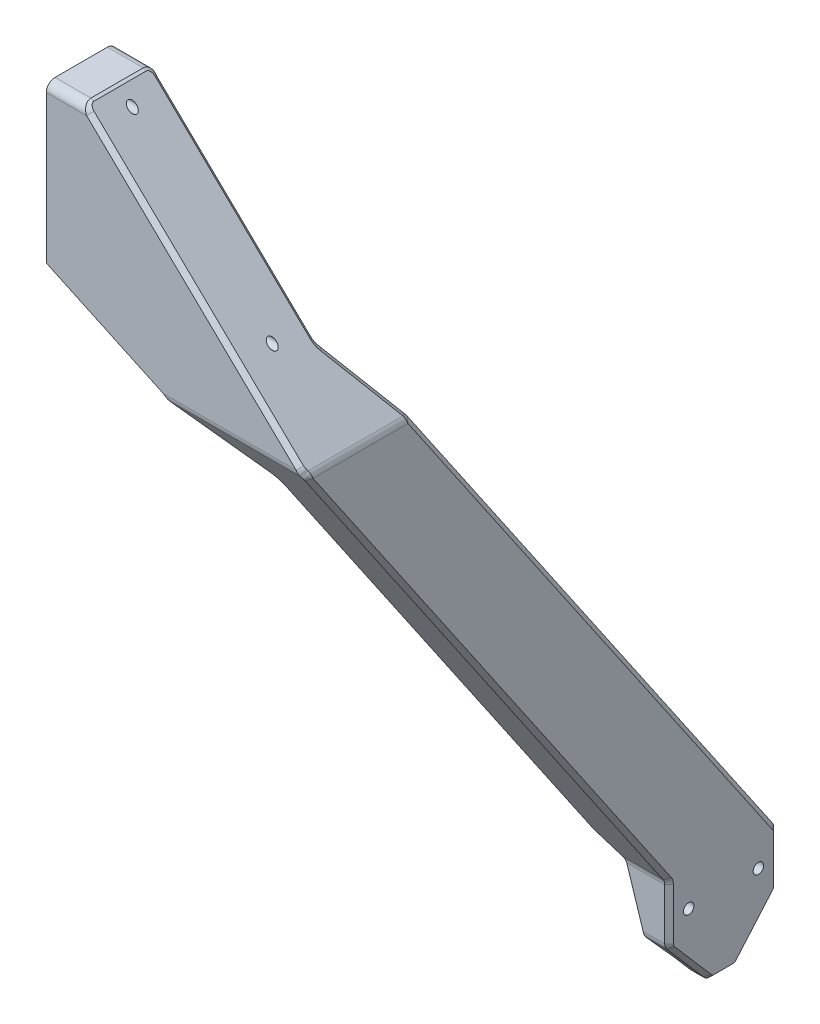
ISO-10303-21;
HEADER;
FILE_DESCRIPTION(('STEP AP214'),'2;1');
FILE_NAME('part.step','',(''),(''),'','','');
FILE_SCHEMA(('AUTOMOTIVE_DESIGN { 1 0 10303 214 1 1 1 1 }'));
ENDSEC;
DATA;
#1=APPLICATION_CONTEXT('core data for automotive mechanical design processes');
#2=APPLICATION_PROTOCOL_DEFINITION('international standard','automotive_design',2000,#1);
#3=PRODUCT_CONTEXT('',#1,'mechanical');
#4=PRODUCT('Part','Part','',(#3));
#5=PRODUCT_RELATED_PRODUCT_CATEGORY('part','',(#4));
#6=PRODUCT_DEFINITION_FORMATION('','',#4);
#7=PRODUCT_DEFINITION_CONTEXT('part definition',#1,'design');
#8=PRODUCT_DEFINITION('design','',#6,#7);
#9=PRODUCT_DEFINITION_SHAPE('','',#8);
#10=(LENGTH_UNIT() NAMED_UNIT(*) SI_UNIT(.MILLI.,.METRE.));
#11=(NAMED_UNIT(*) PLANE_ANGLE_UNIT() SI_UNIT($,.RADIAN.));
#12=(NAMED_UNIT(*) SI_UNIT($,.STERADIAN.) SOLID_ANGLE_UNIT());
#13=UNCERTAINTY_MEASURE_WITH_UNIT(LENGTH_MEASURE(1.E-05),#10,'distance_accuracy_value','');
#14=(GEOMETRIC_REPRESENTATION_CONTEXT(3) GLOBAL_UNCERTAINTY_ASSIGNED_CONTEXT((#13)) GLOBAL_UNIT_ASSIGNED_CONTEXT((#10,
#11,#12)) REPRESENTATION_CONTEXT('',''));
#15=CARTESIAN_POINT('',(0.,0.,0.));
#16=DIRECTION('',(0.,0.,1.));
#17=DIRECTION('',(1.,0.,0.));
#18=AXIS2_PLACEMENT_3D('',#15,#16,#17);
#19=CARTESIAN_POINT('',(287.990026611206,15.5,88.));
#20=DIRECTION('',(-1.,0.,0.));
#21=DIRECTION('',(0.,0.,1.));
#22=AXIS2_PLACEMENT_3D('',#19,#20,#21);
#23=CYLINDRICAL_SURFACE('',#22,0.950000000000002);
#24=CARTESIAN_POINT('',(11.7292247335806,15.5,88.));
#25=DIRECTION('',(-0.694658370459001,-0.719339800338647,0.));
#26=DIRECTION('',(-0.719339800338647,0.694658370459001,0.));
#27=AXIS2_PLACEMENT_3D('',#24,#25,#26);
#28=ELLIPSE('',#27,1.36757871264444,0.950000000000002);
#29=CARTESIAN_POINT('',(10.7454709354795,16.45,88.));
#30=VERTEX_POINT('',#29);
#31=EDGE_CURVE('E884',#30,#30,#28,.T.);
#32=ORIENTED_EDGE('',*,*,#31,.F.);
#33=EDGE_LOOP('',(#32));
#34=FACE_BOUND('',#33,.T.);
#35=CARTESIAN_POINT('',(0.,15.5,88.));
#36=DIRECTION('',(1.,0.,0.));
#37=DIRECTION('',(0.,0.,-1.));
#38=AXIS2_PLACEMENT_3D('',#35,#36,#37);
#39=CIRCLE('',#38,0.950000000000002);
#40=CARTESIAN_POINT('',(0.,15.5,87.05));
#41=VERTEX_POINT('',#40);
#42=EDGE_CURVE('E863',#41,#41,#39,.T.);
#43=ORIENTED_EDGE('',*,*,#42,.F.);
#44=EDGE_LOOP('',(#43));
#45=FACE_BOUND('',#44,.T.);
#46=ADVANCED_FACE('F34',(#34,#45),#23,.F.);
#47=CARTESIAN_POINT('',(287.990026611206,-160.,-8.00000000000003));
#48=DIRECTION('',(-1.,0.,0.));
#49=DIRECTION('',(0.,0.,1.));
#50=AXIS2_PLACEMENT_3D('',#47,#48,#49);
#51=CYLINDRICAL_SURFACE('',#50,1.2);
#52=CARTESIAN_POINT('',(50.7221998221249,-160.,-8.00000000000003));
#53=DIRECTION('',(0.952448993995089,0.304698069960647,0.));
#54=DIRECTION('',(-0.304698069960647,0.952448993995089,0.));
#55=AXIS2_PLACEMENT_3D('',#52,#53,#54);
#56=ELLIPSE('',#55,1.25990998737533,1.2);
#57=CARTESIAN_POINT('',(50.3383076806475,-158.8,-8.00000000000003));
#58=VERTEX_POINT('',#57);
#59=EDGE_CURVE('E878',#58,#58,#56,.T.);
#60=ORIENTED_EDGE('',*,*,#59,.F.);
#61=EDGE_LOOP('',(#60));
#62=FACE_BOUND('',#61,.T.);
#63=CARTESIAN_POINT('',(59.4,-160.,-8.00000000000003));
#64=DIRECTION('',(1.,0.,0.));
#65=DIRECTION('',(0.,0.,-1.));
#66=AXIS2_PLACEMENT_3D('',#63,#64,#65);
#67=CIRCLE('',#66,1.2);
#68=CARTESIAN_POINT('',(59.4,-160.,-9.20000000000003));
#69=VERTEX_POINT('',#68);
#70=EDGE_CURVE('E875',#69,#69,#67,.T.);
#71=ORIENTED_EDGE('',*,*,#70,.T.);
#72=EDGE_LOOP('',(#71));
#73=FACE_BOUND('',#72,.T.);
#74=ADVANCED_FACE('F2621',(#62,#73),#51,.F.);
#75=CARTESIAN_POINT('',(287.990026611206,-160.,7.99999999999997));
#76=DIRECTION('',(-1.,0.,0.));
#77=DIRECTION('',(0.,0.,1.));
#78=AXIS2_PLACEMENT_3D('',#75,#76,#77);
#79=CYLINDRICAL_SURFACE('',#78,1.2);
#80=CARTESIAN_POINT('',(50.7221998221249,-160.,7.99999999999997));
#81=DIRECTION('',(0.952448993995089,0.304698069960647,0.));
#82=DIRECTION('',(-0.304698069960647,0.952448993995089,0.));
#83=AXIS2_PLACEMENT_3D('',#80,#81,#82);
#84=ELLIPSE('',#83,1.25990998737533,1.2);
#85=CARTESIAN_POINT('',(50.3383076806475,-158.8,7.99999999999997));
#86=VERTEX_POINT('',#85);
#87=EDGE_CURVE('E881',#86,#86,#84,.T.);
#88=ORIENTED_EDGE('',*,*,#87,.F.);
#89=EDGE_LOOP('',(#88));
#90=FACE_BOUND('',#89,.T.);
#91=CARTESIAN_POINT('',(59.4,-160.,7.99999999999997));
#92=DIRECTION('',(1.,0.,0.));
#93=DIRECTION('',(0.,0.,-1.));
#94=AXIS2_PLACEMENT_3D('',#91,#92,#93);
#95=CIRCLE('',#94,1.2);
#96=CARTESIAN_POINT('',(59.4,-160.,6.79999999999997));
#97=VERTEX_POINT('',#96);
#98=EDGE_CURVE('E872',#97,#97,#95,.T.);
#99=ORIENTED_EDGE('',*,*,#98,.T.);
#100=EDGE_LOOP('',(#99));
#101=FACE_BOUND('',#100,.T.);
#102=ADVANCED_FACE('F2627',(#90,#101),#79,.F.);
#103=CARTESIAN_POINT('',(287.990026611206,-177.,2.99999999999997));
#104=DIRECTION('',(0.,1.,0.));
#105=DIRECTION('',(0.,0.,1.));
#106=AXIS2_PLACEMENT_3D('',#103,#104,#105);
#107=PLANE('',#106);
#108=DIRECTION('',(-1.,0.,0.));
#109=VECTOR('',#108,1.);
#110=CARTESIAN_POINT('',(287.990026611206,-177.,-2.0846469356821));
#111=LINE('',#110,#109);
#112=CARTESIAN_POINT('',(55.4,-177.,-2.0846469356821));
#113=VERTEX_POINT('',#112);
#114=CARTESIAN_POINT('',(58.3999999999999,-177.,-2.0846469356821));
#115=VERTEX_POINT('',#114);
#116=EDGE_CURVE('E2567',#113,#115,#111,.F.);
#117=ORIENTED_EDGE('',*,*,#116,.T.);
#118=DIRECTION('',(0.,0.,1.));
#119=VECTOR('',#118,1.);
#120=CARTESIAN_POINT('',(58.3999999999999,-177.,2.08464693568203));
#121=LINE('',#120,#119);
#122=CARTESIAN_POINT('',(58.3999999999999,-177.,2.08464693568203));
#123=VERTEX_POINT('',#122);
#124=EDGE_CURVE('E685',#115,#123,#121,.T.);
#125=ORIENTED_EDGE('',*,*,#124,.T.);
#126=DIRECTION('',(-1.,0.,0.));
#127=VECTOR('',#126,1.);
#128=CARTESIAN_POINT('',(287.990026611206,-177.,2.08464693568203));
#129=LINE('',#128,#127);
#130=CARTESIAN_POINT('',(55.4,-177.,2.08464693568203));
#131=VERTEX_POINT('',#130);
#132=EDGE_CURVE('E605',#123,#131,#129,.T.);
#133=ORIENTED_EDGE('',*,*,#132,.T.);
#134=DIRECTION('',(0.,0.,-1.));
#135=VECTOR('',#134,1.);
#136=CARTESIAN_POINT('',(55.4,-177.,2.99999999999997));
#137=LINE('',#136,#135);
#138=EDGE_CURVE('E687',#131,#113,#137,.T.);
#139=ORIENTED_EDGE('',*,*,#138,.T.);
#140=EDGE_LOOP('',(#117,#125,#133,#139));
#141=FACE_BOUND('',#140,.T.);
#142=ADVANCED_FACE('F744',(#141),#107,.F.);
#143=CARTESIAN_POINT('',(287.990026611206,-166.,12.5));
#144=DIRECTION('',(0.,0.653619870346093,-0.756823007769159));
#145=DIRECTION('',(0.,0.756823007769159,0.653619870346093));
#146=AXIS2_PLACEMENT_3D('',#143,#144,#145);
#147=PLANE('',#146);
#148=DIRECTION('',(-1.,0.,0.));
#149=VECTOR('',#148,1.);
#150=CARTESIAN_POINT('',(287.990026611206,-176.307239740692,3.59829295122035));
#151=LINE('',#150,#149);
#152=CARTESIAN_POINT('',(55.4,-176.307239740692,3.59829295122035));
#153=VERTEX_POINT('',#152);
#154=CARTESIAN_POINT('',(58.3999999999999,-176.307239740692,3.59829295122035));
#155=VERTEX_POINT('',#154);
#156=EDGE_CURVE('E682',#153,#155,#151,.F.);
#157=ORIENTED_EDGE('',*,*,#156,.T.);
#158=DIRECTION('',(0.,0.756823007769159,0.653619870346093));
#159=VECTOR('',#158,1.);
#160=CARTESIAN_POINT('',(58.3999999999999,-166.56314671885,12.0136460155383));
#161=LINE('',#160,#159);
#162=CARTESIAN_POINT('',(58.3999999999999,-166.56314671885,12.0136460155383));
#163=VERTEX_POINT('',#162);
#164=EDGE_CURVE('E720',#155,#163,#161,.T.);
#165=ORIENTED_EDGE('',*,*,#164,.T.);
#166=DIRECTION('',(-1.,0.,0.));
#167=VECTOR('',#166,1.);
#168=CARTESIAN_POINT('',(287.990026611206,-166.56314671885,12.0136460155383));
#169=LINE('',#168,#167);
#170=CARTESIAN_POINT('',(53.6626422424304,-166.56314671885,12.0136460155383));
#171=VERTEX_POINT('',#170);
#172=EDGE_CURVE('E510',#163,#171,#169,.T.);
#173=ORIENTED_EDGE('',*,*,#172,.T.);
#174=DIRECTION('',(0.235316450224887,-0.735570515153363,-0.635265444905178));
#175=VECTOR('',#174,1.);
#176=CARTESIAN_POINT('',(66.4680670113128,-206.591342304,-22.5561592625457));
#177=LINE('',#176,#175);
#178=CARTESIAN_POINT('',(55.2573469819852,-171.547999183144,7.7085461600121));
#179=VERTEX_POINT('',#178);
#180=EDGE_CURVE('E2599',#171,#179,#177,.T.);
#181=ORIENTED_EDGE('',*,*,#180,.T.);
#182=CARTESIAN_POINT('',(55.4,-172.462093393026,6.91910116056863));
#183=CARTESIAN_POINT('',(55.4000813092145,-172.152461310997,7.18651068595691));
#184=CARTESIAN_POINT('',(55.3517687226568,-171.84288317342,7.45387362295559));
#185=CARTESIAN_POINT('',(55.2573469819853,-171.547999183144,7.7085461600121));
#186=B_SPLINE_CURVE_WITH_KNOTS('',3,(#182,#183,#184,#185),.UNSPECIFIED.,.F.,.F.,(4,4),
(4.4027675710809,4.71238898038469),.UNSPECIFIED.);
#187=CARTESIAN_POINT('',(55.4,-172.462093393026,6.91910116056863));
#188=VERTEX_POINT('',#187);
#189=EDGE_CURVE('E727',#179,#188,#186,.F.);
#190=ORIENTED_EDGE('',*,*,#189,.T.);
#191=DIRECTION('',(0.,-0.756823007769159,-0.653619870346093));
#192=VECTOR('',#191,1.);
#193=CARTESIAN_POINT('',(55.4,-166.,12.5));
#194=LINE('',#193,#192);
#195=EDGE_CURVE('E723',#188,#153,#194,.T.);
#196=ORIENTED_EDGE('',*,*,#195,.T.);
#197=EDGE_LOOP('',(#157,#165,#173,#181,#190,#196));
#198=FACE_BOUND('',#197,.T.);
#199=ADVANCED_FACE('F733',(#198),#147,.F.);
#200=CARTESIAN_POINT('',(287.990026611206,-160.,12.5));
#201=DIRECTION('',(0.,0.,-1.));
#202=DIRECTION('',(0.,1.,0.));
#203=AXIS2_PLACEMENT_3D('',#200,#201,#202);
#204=PLANE('',#203);
#205=DIRECTION('',(-1.,0.,0.));
#206=VECTOR('',#205,1.);
#207=CARTESIAN_POINT('',(287.990026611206,-165.255906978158,12.5));
#208=LINE('',#207,#206);
#209=CARTESIAN_POINT('',(53.453542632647,-165.255906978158,12.5));
#210=VERTEX_POINT('',#209);
#211=CARTESIAN_POINT('',(58.3999999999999,-165.255906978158,12.5));
#212=VERTEX_POINT('',#211);
#213=EDGE_CURVE('E417',#210,#212,#208,.F.);
#214=ORIENTED_EDGE('',*,*,#213,.T.);
#215=DIRECTION('',(0.,1.,0.));
#216=VECTOR('',#215,1.);
#217=CARTESIAN_POINT('',(58.3999999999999,-153.468916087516,12.5));
#218=LINE('',#217,#216);
#219=CARTESIAN_POINT('',(58.3999999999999,-153.468916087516,12.5));
#220=VERTEX_POINT('',#219);
#221=EDGE_CURVE('E689',#212,#220,#218,.T.);
#222=ORIENTED_EDGE('',*,*,#221,.T.);
#223=DIRECTION('',(-1.,0.,0.));
#224=VECTOR('',#223,1.);
#225=CARTESIAN_POINT('',(48.435273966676,-153.468916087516,12.5));
#226=LINE('',#225,#224);
#227=CARTESIAN_POINT('',(49.6827649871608,-153.468916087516,12.5));
#228=VERTEX_POINT('',#227);
#229=EDGE_CURVE('E676',#220,#228,#226,.T.);
#230=ORIENTED_EDGE('',*,*,#229,.T.);
#231=DIRECTION('',(0.304698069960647,-0.952448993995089,0.));
#232=VECTOR('',#231,1.);
#233=CARTESIAN_POINT('',(73.7028106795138,-228.552648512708,12.4999999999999));
#234=LINE('',#233,#232);
#235=EDGE_CURVE('E691',#228,#210,#234,.T.);
#236=ORIENTED_EDGE('',*,*,#235,.T.);
#237=EDGE_LOOP('',(#214,#222,#230,#236));
#238=FACE_BOUND('',#237,.T.);
#239=ADVANCED_FACE('F743',(#238),#204,.F.);
#240=CARTESIAN_POINT('',(287.990026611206,-30.5351325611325,96.));
#241=DIRECTION('',(0.,0.563809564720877,-0.825904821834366));
#242=DIRECTION('',(0.,0.825904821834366,0.563809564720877));
#243=AXIS2_PLACEMENT_3D('',#240,#241,#242);
#244=PLANE('',#243);
#245=DIRECTION('',(-1.,0.,0.));
#246=VECTOR('',#245,1.);
#247=CARTESIAN_POINT('',(59.4000000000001,-152.341296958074,12.8481903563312));
#248=LINE('',#247,#246);
#249=CARTESIAN_POINT('',(49.1416598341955,-152.341296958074,12.8481903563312));
#250=VERTEX_POINT('',#249);
#251=CARTESIAN_POINT('',(58.3999999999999,-152.341296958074,12.8481903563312));
#252=VERTEX_POINT('',#251);
#253=EDGE_CURVE('E675',#250,#252,#248,.F.);
#254=ORIENTED_EDGE('',*,*,#253,.T.);
#255=DIRECTION('',(0.,0.825904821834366,0.563809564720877));
#256=VECTOR('',#255,1.);
#257=CARTESIAN_POINT('',(58.3999999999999,-31.3840821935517,95.4204587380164));
#258=LINE('',#257,#256);
#259=CARTESIAN_POINT('',(58.3999999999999,-31.9478917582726,95.0355702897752));
#260=VERTEX_POINT('',#259);
#261=EDGE_CURVE('E788',#252,#260,#258,.T.);
#262=ORIENTED_EDGE('',*,*,#261,.T.);
#263=CARTESIAN_POINT('',(58.094658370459,-31.228551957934,95.5266325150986));
#264=CARTESIAN_POINT('',(58.1427889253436,-31.2750244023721,95.4949077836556));
#265=CARTESIAN_POINT('',(58.1862309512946,-31.3263476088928,95.4598716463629));
#266=CARTESIAN_POINT('',(58.2620214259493,-31.4366234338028,95.3845911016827));
#267=CARTESIAN_POINT('',(58.2943631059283,-31.495574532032,95.3443477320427));
#268=CARTESIAN_POINT('',(58.3466466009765,-31.6187467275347,95.2602633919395));
#269=CARTESIAN_POINT('',(58.3665860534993,-31.6829622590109,95.2164262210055));
#270=CARTESIAN_POINT('',(58.3932633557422,-31.8140853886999,95.1269141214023));
#271=CARTESIAN_POINT('',(58.400004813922,-31.880987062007,95.0812432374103));
#272=CARTESIAN_POINT('',(58.3999999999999,-31.9478917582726,95.0355702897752));
#273=B_SPLINE_CURVE_WITH_KNOTS('',3,(#263,#264,#265,#266,#267,#268,#269,#270,#271,#272),
.UNSPECIFIED.,.F.,.F.,(4,2,2,2,4),(0.767944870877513,0.968657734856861,1.16937059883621,
1.37008346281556,1.5707963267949),.UNSPECIFIED.);
#274=CARTESIAN_POINT('',(58.094658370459,-31.228551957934,95.5266325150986));
#275=VERTEX_POINT('',#274);
#276=EDGE_CURVE('E781',#260,#275,#273,.F.);
#277=ORIENTED_EDGE('',*,*,#276,.T.);
#278=DIRECTION('',(-0.649961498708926,0.627660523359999,0.428476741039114));
#279=VECTOR('',#278,1.);
#280=CARTESIAN_POINT('',(154.79923139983,-124.61507260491,31.7756866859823));
#281=LINE('',#280,#279);
#282=CARTESIAN_POINT('',(57.9047756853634,-31.045184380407,95.6518096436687));
#283=VERTEX_POINT('',#282);
#284=EDGE_CURVE('E776',#275,#283,#281,.T.);
#285=ORIENTED_EDGE('',*,*,#284,.T.);
#286=DIRECTION('',(-1.,0.,0.));
#287=VECTOR('',#286,1.);
#288=CARTESIAN_POINT('',(287.990026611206,-31.045184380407,95.6518096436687));
#289=LINE('',#288,#287);
#290=CARTESIAN_POINT('',(28.0603427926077,-31.045184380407,95.6518096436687));
#291=VERTEX_POINT('',#290);
#292=EDGE_CURVE('E671',#283,#291,#289,.T.);
#293=ORIENTED_EDGE('',*,*,#292,.T.);
#294=DIRECTION('',(0.870792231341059,-0.40605708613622,-0.277197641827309));
#295=VECTOR('',#294,1.);
#296=CARTESIAN_POINT('',(224.89519550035,-122.830783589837,32.9937437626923));
#297=LINE('',#296,#295);
#298=CARTESIAN_POINT('',(45.2678547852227,-39.0691790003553,90.174174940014));
#299=VERTEX_POINT('',#298);
#300=EDGE_CURVE('E670',#291,#299,#297,.T.);
#301=ORIENTED_EDGE('',*,*,#300,.T.);
#302=CARTESIAN_POINT('',(47.,-41.7881023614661,88.3180833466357));
#303=CARTESIAN_POINT('',(47.0000573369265,-41.5044794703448,88.5117004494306));
#304=CARTESIAN_POINT('',(46.9595125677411,-41.2209060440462,88.7052837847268));
#305=CARTESIAN_POINT('',(46.8404680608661,-40.8124699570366,88.9841054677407));
#306=CARTESIAN_POINT('',(46.7911167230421,-40.6791492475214,89.0751177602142));
#307=CARTESIAN_POINT('',(46.674066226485,-40.4208132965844,89.2514725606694));
#308=CARTESIAN_POINT('',(46.6063678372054,-40.2958033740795,89.3368114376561));
#309=CARTESIAN_POINT('',(46.4539808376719,-40.0566036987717,89.5001027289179));
#310=CARTESIAN_POINT('',(46.3692939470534,-39.9424166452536,89.5780533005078));
#311=CARTESIAN_POINT('',(46.1846297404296,-39.7271553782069,89.7250028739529));
#312=CARTESIAN_POINT('',(46.0846569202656,-39.6260841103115,89.7939998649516));
#313=CARTESIAN_POINT('',(45.7647984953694,-39.3455805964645,89.9854875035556));
#314=CARTESIAN_POINT('',(45.5249286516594,-39.1889912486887,90.0923842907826));
#315=CARTESIAN_POINT('',(45.2678547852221,-39.0691790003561,90.1741749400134));
#316=B_SPLINE_CURVE_WITH_KNOTS('',3,(#302,#303,#304,#305,#306,#307,#308,#309,#310,#311,#312,
#313,#314,#315),.UNSPECIFIED.,.F.,.F.,(4,2,2,2,2,2,4),(3.57792496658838,3.86154097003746,
4.003348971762,4.14515697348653,4.28696497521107,4.42877297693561,4.71238898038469),.UNSPECIFIED.);
#317=CARTESIAN_POINT('',(47.,-41.7881023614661,88.3180833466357));
#318=VERTEX_POINT('',#317);
#319=EDGE_CURVE('E3291',#299,#318,#316,.F.);
#320=ORIENTED_EDGE('',*,*,#319,.T.);
#321=DIRECTION('',(0.,-0.825904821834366,-0.563809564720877));
#322=VECTOR('',#321,1.);
#323=CARTESIAN_POINT('',(47.,-30.5351325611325,96.));
#324=LINE('',#323,#322);
#325=CARTESIAN_POINT('',(47.,-145.490670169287,17.5248174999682));
#326=VERTEX_POINT('',#325);
#327=EDGE_CURVE('E3292',#318,#326,#324,.T.);
#328=ORIENTED_EDGE('',*,*,#327,.T.);
#329=CARTESIAN_POINT('',(47.0475510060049,-145.795368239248,17.3168132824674));
#330=CARTESIAN_POINT('',(47.0160770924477,-145.697073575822,17.3839148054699));
#331=CARTESIAN_POINT('',(46.9999728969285,-145.593880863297,17.4543600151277));
#332=CARTESIAN_POINT('',(47.,-145.490670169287,17.5248174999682));
#333=B_SPLINE_CURVE_WITH_KNOTS('',3,(#329,#330,#331,#332),.UNSPECIFIED.,.F.,.F.,(4,4),
(4.40276757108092,4.7123889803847),.UNSPECIFIED.);
#334=CARTESIAN_POINT('',(47.0475510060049,-145.795368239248,17.3168132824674));
#335=VERTEX_POINT('',#334);
#336=EDGE_CURVE('E777',#326,#335,#333,.F.);
#337=ORIENTED_EDGE('',*,*,#336,.T.);
#338=DIRECTION('',(0.255449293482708,-0.798503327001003,-0.545103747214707));
#339=VECTOR('',#338,1.);
#340=CARTESIAN_POINT('',(28.3032958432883,-87.2031133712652,57.3152160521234));
#341=LINE('',#340,#339);
#342=EDGE_CURVE('E769',#335,#250,#341,.T.);
#343=ORIENTED_EDGE('',*,*,#342,.T.);
#344=EDGE_LOOP('',(#254,#262,#277,#285,#293,#301,#320,#328,#337,#343));
#345=FACE_BOUND('',#344,.T.);
#346=ADVANCED_FACE('F748',(#345),#244,.F.);
#347=CARTESIAN_POINT('',(287.990026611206,18.5,96.));
#348=DIRECTION('',(0.,0.,-1.));
#349=DIRECTION('',(-1.,0.,0.));
#350=AXIS2_PLACEMENT_3D('',#347,#348,#349);
#351=PLANE('',#350);
#352=DIRECTION('',(-1.,0.,0.));
#353=VECTOR('',#352,1.);
#354=CARTESIAN_POINT('',(287.990026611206,-29.9175652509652,96.));
#355=LINE('',#354,#353);
#356=CARTESIAN_POINT('',(26.8512492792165,-29.9175652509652,96.));
#357=VERTEX_POINT('',#356);
#358=CARTESIAN_POINT('',(57.3209337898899,-29.9175652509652,96.));
#359=VERTEX_POINT('',#358);
#360=EDGE_CURVE('E396',#357,#359,#355,.F.);
#361=ORIENTED_EDGE('',*,*,#360,.T.);
#362=DIRECTION('',(-0.719339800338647,0.694658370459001,0.));
#363=VECTOR('',#362,1.);
#364=CARTESIAN_POINT('',(152.486562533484,-121.817944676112,96.));
#365=LINE('',#364,#363);
#366=CARTESIAN_POINT('',(9.25413788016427,16.5,96.));
#367=VERTEX_POINT('',#366);
#368=EDGE_CURVE('E392',#359,#367,#365,.T.);
#369=ORIENTED_EDGE('',*,*,#368,.T.);
#370=DIRECTION('',(-1.,0.,0.));
#371=VECTOR('',#370,1.);
#372=CARTESIAN_POINT('',(287.990026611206,16.5,96.));
#373=LINE('',#372,#371);
#374=CARTESIAN_POINT('',(0.,16.5,96.));
#375=VERTEX_POINT('',#374);
#376=EDGE_CURVE('E384',#367,#375,#373,.T.);
#377=ORIENTED_EDGE('',*,*,#376,.T.);
#378=DIRECTION('',(0.,-1.,0.));
#379=VECTOR('',#378,1.);
#380=CARTESIAN_POINT('',(0.,18.5,96.));
#381=LINE('',#380,#379);
#382=CARTESIAN_POINT('',(0.,-17.3966220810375,96.));
#383=VERTEX_POINT('',#382);
#384=EDGE_CURVE('E389',#375,#383,#381,.T.);
#385=ORIENTED_EDGE('',*,*,#384,.T.);
#386=DIRECTION('',(0.906307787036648,-0.422618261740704,0.));
#387=VECTOR('',#386,1.);
#388=CARTESIAN_POINT('',(222.804019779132,-121.291842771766,96.));
#389=LINE('',#388,#387);
#390=EDGE_CURVE('E2313',#383,#357,#389,.T.);
#391=ORIENTED_EDGE('',*,*,#390,.T.);
#392=EDGE_LOOP('',(#361,#369,#377,#385,#391));
#393=FACE_BOUND('',#392,.T.);
#394=ADVANCED_FACE('F387',(#393),#351,.F.);
#395=CARTESIAN_POINT('',(287.990026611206,18.5,96.));
#396=DIRECTION('',(0.,-1.,0.));
#397=DIRECTION('',(0.,0.,-1.));
#398=AXIS2_PLACEMENT_3D('',#395,#396,#397);
#399=PLANE('',#398);
#400=DIRECTION('',(-1.,0.,0.));
#401=VECTOR('',#400,1.);
#402=CARTESIAN_POINT('',(287.990026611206,18.5,94.));
#403=LINE('',#402,#401);
#404=CARTESIAN_POINT('',(0.,18.5,94.));
#405=VERTEX_POINT('',#404);
#406=CARTESIAN_POINT('',(8.21860756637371,18.5,94.));
#407=VERTEX_POINT('',#406);
#408=EDGE_CURVE('E402',#405,#407,#403,.F.);
#409=ORIENTED_EDGE('',*,*,#408,.T.);
#410=DIRECTION('',(0.,0.,-1.));
#411=VECTOR('',#410,1.);
#412=CARTESIAN_POINT('',(8.21860756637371,18.5,96.));
#413=LINE('',#412,#411);
#414=CARTESIAN_POINT('',(8.21860756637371,18.5,82.));
#415=VERTEX_POINT('',#414);
#416=EDGE_CURVE('E2330',#407,#415,#413,.T.);
#417=ORIENTED_EDGE('',*,*,#416,.T.);
#418=DIRECTION('',(-1.,0.,0.));
#419=VECTOR('',#418,1.);
#420=CARTESIAN_POINT('',(287.990026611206,18.5,82.));
#421=LINE('',#420,#419);
#422=CARTESIAN_POINT('',(0.,18.5,82.));
#423=VERTEX_POINT('',#422);
#424=EDGE_CURVE('E406',#415,#423,#421,.T.);
#425=ORIENTED_EDGE('',*,*,#424,.T.);
#426=DIRECTION('',(0.,0.,1.));
#427=VECTOR('',#426,1.);
#428=CARTESIAN_POINT('',(0.,18.5,96.));
#429=LINE('',#428,#427);
#430=EDGE_CURVE('E415',#423,#405,#429,.T.);
#431=ORIENTED_EDGE('',*,*,#430,.T.);
#432=EDGE_LOOP('',(#409,#417,#425,#431));
#433=FACE_BOUND('',#432,.T.);
#434=ADVANCED_FACE('F3174',(#433),#399,.F.);
#435=CARTESIAN_POINT('',(287.990026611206,18.5,80.));
#436=DIRECTION('',(0.,0.,1.));
#437=DIRECTION('',(1.,0.,0.));
#438=AXIS2_PLACEMENT_3D('',#435,#436,#437);
#439=PLANE('',#438);
#440=DIRECTION('',(-1.,0.,0.));
#441=VECTOR('',#440,1.);
#442=CARTESIAN_POINT('',(287.990026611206,16.5,80.));
#443=LINE('',#442,#441);
#444=CARTESIAN_POINT('',(0.,16.5,80.));
#445=VERTEX_POINT('',#444);
#446=CARTESIAN_POINT('',(9.25413788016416,16.5,80.));
#447=VERTEX_POINT('',#446);
#448=EDGE_CURVE('E436',#445,#447,#443,.F.);
#449=ORIENTED_EDGE('',*,*,#448,.T.);
#450=DIRECTION('',(0.719339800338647,-0.694658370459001,0.));
#451=VECTOR('',#450,1.);
#452=CARTESIAN_POINT('',(152.486562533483,-121.817944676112,80.));
#453=LINE('',#452,#451);
#454=CARTESIAN_POINT('',(44.8581891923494,-17.8824326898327,80.));
#455=VERTEX_POINT('',#454);
#456=EDGE_CURVE('E2177',#447,#455,#453,.T.);
#457=ORIENTED_EDGE('',*,*,#456,.T.);
#458=DIRECTION('',(-1.,0.,0.));
#459=VECTOR('',#458,1.);
#460=CARTESIAN_POINT('',(0.,-17.8824326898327,80.));
#461=LINE('',#460,#459);
#462=CARTESIAN_POINT('',(1.04182343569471,-17.8824326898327,80.));
#463=VERTEX_POINT('',#462);
#464=EDGE_CURVE('E813',#455,#463,#461,.T.);
#465=ORIENTED_EDGE('',*,*,#464,.T.);
#466=CARTESIAN_POINT('',(0.,-17.5807385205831,80.));
#467=CARTESIAN_POINT('',(0.041626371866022,-17.5923394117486,79.999953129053));
#468=CARTESIAN_POINT('',(0.0832644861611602,-17.603897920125,79.9999805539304));
#469=CARTESIAN_POINT('',(0.153936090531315,-17.6234835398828,80.0000230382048));
#470=CARTESIAN_POINT('',(0.182967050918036,-17.6315197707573,80.0000393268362));
#471=CARTESIAN_POINT('',(0.22843600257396,-17.6441058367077,80.0000223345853));
#472=CARTESIAN_POINT('',(0.244873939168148,-17.6486558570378,80.00000749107));
#473=CARTESIAN_POINT('',(0.290248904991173,-17.6612747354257,79.9999868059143));
#474=CARTESIAN_POINT('',(0.319174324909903,-17.6693853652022,79.9999964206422));
#475=CARTESIAN_POINT('',(0.377091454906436,-17.685700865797,80.0000034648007));
#476=CARTESIAN_POINT('',(0.406083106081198,-17.6939059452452,80.0000008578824));
#477=CARTESIAN_POINT('',(0.46412362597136,-17.7104287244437,79.9999990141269));
#478=CARTESIAN_POINT('',(0.493172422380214,-17.7187466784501,79.9999997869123));
#479=CARTESIAN_POINT('',(0.551100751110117,-17.7354300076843,80.0000002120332));
#480=CARTESIAN_POINT('',(0.579980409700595,-17.7437949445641,79.9999998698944));
#481=CARTESIAN_POINT('',(0.637741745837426,-17.7606260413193,79.9999993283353));
#482=CARTESIAN_POINT('',(0.666623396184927,-17.7690922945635,79.9999991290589));
#483=CARTESIAN_POINT('',(0.724383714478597,-17.7861289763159,79.9999988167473));
#484=CARTESIAN_POINT('',(0.753262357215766,-17.7946994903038,79.9999987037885));
#485=CARTESIAN_POINT('',(0.811011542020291,-17.8119479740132,79.9999986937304));
#486=CARTESIAN_POINT('',(0.839882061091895,-17.8206260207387,79.9999987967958));
#487=CARTESIAN_POINT('',(0.897609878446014,-17.8380927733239,79.9999991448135));
#488=CARTESIAN_POINT('',(0.926467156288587,-17.8468815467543,79.9999993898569));
#489=CARTESIAN_POINT('',(0.984163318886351,-17.8645729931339,79.9999998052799));
#490=CARTESIAN_POINT('',(1.01300218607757,-17.8734757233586,79.9999999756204));
#491=CARTESIAN_POINT('',(1.04182343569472,-17.8824351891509,80.));
#492=B_SPLINE_CURVE_WITH_KNOTS('',3,(#466,#467,#468,#469,#470,#471,#472,#473,#474,#475,#476,
#477,#478,#479,#480,#481,#482,#483,#484,#485,#486,#487,#488,#489,#490,#491),.UNSPECIFIED.,.F.,
.F.,(4,2,2,2,2,2,2,2,2,2,2,2,4),(0.,0.12963792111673,0.220006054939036,0.271174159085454,
0.361296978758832,0.451688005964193,0.542336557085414,0.632536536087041,0.722827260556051,
0.81319780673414,0.903637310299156,0.994134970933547,1.08468005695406),.UNSPECIFIED.);
#493=CARTESIAN_POINT('',(0.,-17.5807385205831,80.));
#494=VERTEX_POINT('',#493);
#495=EDGE_CURVE('E2180',#463,#494,#492,.F.);
#496=ORIENTED_EDGE('',*,*,#495,.T.);
#497=DIRECTION('',(0.,1.,0.));
#498=VECTOR('',#497,1.);
#499=CARTESIAN_POINT('',(0.,18.5,80.));
#500=LINE('',#499,#498);
#501=EDGE_CURVE('E419',#494,#445,#500,.T.);
#502=ORIENTED_EDGE('',*,*,#501,.T.);
#503=EDGE_LOOP('',(#449,#457,#465,#496,#502));
#504=FACE_BOUND('',#503,.T.);
#505=ADVANCED_FACE('F2342',(#504),#439,.F.);
#506=CARTESIAN_POINT('',(287.990026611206,-154.,-12.5));
#507=DIRECTION('',(0.,-0.563809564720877,0.825904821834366));
#508=DIRECTION('',(0.,-0.825904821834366,-0.563809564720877));
#509=AXIS2_PLACEMENT_3D('',#506,#507,#508);
#510=PLANE('',#509);
#511=CARTESIAN_POINT('',(58.3999999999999,-30.8202726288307,71.5894817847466));
#512=CARTESIAN_POINT('',(58.400004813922,-30.7533679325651,71.6351547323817));
#513=CARTESIAN_POINT('',(58.3932633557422,-30.6864662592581,71.6808256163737));
#514=CARTESIAN_POINT('',(58.3665860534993,-30.555343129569,71.7703377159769));
#515=CARTESIAN_POINT('',(58.3466466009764,-30.4911275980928,71.8141748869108));
#516=CARTESIAN_POINT('',(58.2943631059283,-30.3679554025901,71.8982592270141));
#517=CARTESIAN_POINT('',(58.2620214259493,-30.3090043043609,71.938502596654));
#518=CARTESIAN_POINT('',(58.1862309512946,-30.1987284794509,72.0137831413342));
#519=CARTESIAN_POINT('',(58.1427889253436,-30.1474052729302,72.048819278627));
#520=CARTESIAN_POINT('',(58.094658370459,-30.1009328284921,72.08054401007));
#521=B_SPLINE_CURVE_WITH_KNOTS('',3,(#511,#512,#513,#514,#515,#516,#517,#518,#519,#520),
.UNSPECIFIED.,.F.,.F.,(4,2,2,2,4),(4.71238898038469,4.91310184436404,5.11381470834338,
5.31452757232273,5.51524043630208),.UNSPECIFIED.);
#522=CARTESIAN_POINT('',(58.0946583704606,-30.1009328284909,72.0805440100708));
#523=VERTEX_POINT('',#522);
#524=CARTESIAN_POINT('',(58.3999999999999,-30.8202726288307,71.5894817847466));
#525=VERTEX_POINT('',#524);
#526=EDGE_CURVE('E2420',#523,#525,#521,.F.);
#527=ORIENTED_EDGE('',*,*,#526,.T.);
#528=DIRECTION('',(0.,-0.825904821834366,-0.563809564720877));
#529=VECTOR('',#528,1.);
#530=CARTESIAN_POINT('',(58.3999999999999,-153.489948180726,-12.1518096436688));
#531=LINE('',#530,#529);
#532=CARTESIAN_POINT('',(58.3999999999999,-153.489948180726,-12.1518096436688));
#533=VERTEX_POINT('',#532);
#534=EDGE_CURVE('E2424',#525,#533,#531,.T.);
#535=ORIENTED_EDGE('',*,*,#534,.T.);
#536=DIRECTION('',(-1.,0.,0.));
#537=VECTOR('',#536,1.);
#538=CARTESIAN_POINT('',(287.990026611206,-153.489948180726,-12.1518096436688));
#539=LINE('',#538,#537);
#540=CARTESIAN_POINT('',(49.8698617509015,-153.489948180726,-12.1518096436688));
#541=VERTEX_POINT('',#540);
#542=EDGE_CURVE('E2475',#533,#541,#539,.T.);
#543=ORIENTED_EDGE('',*,*,#542,.T.);
#544=DIRECTION('',(-0.255449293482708,0.798503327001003,0.545103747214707));
#545=VECTOR('',#544,1.);
#546=CARTESIAN_POINT('',(65.5607594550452,-202.537780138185,-45.6346469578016));
#547=LINE('',#546,#545);
#548=CARTESIAN_POINT('',(47.0475510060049,-144.667749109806,-6.12927522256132));
#549=VERTEX_POINT('',#548);
#550=EDGE_CURVE('E2467',#541,#549,#547,.T.);
#551=ORIENTED_EDGE('',*,*,#550,.T.);
#552=CARTESIAN_POINT('',(47.,-144.363051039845,-5.92127100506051));
#553=CARTESIAN_POINT('',(46.9999728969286,-144.466261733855,-5.99172848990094));
#554=CARTESIAN_POINT('',(47.0160770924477,-144.569454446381,-6.06217369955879));
#555=CARTESIAN_POINT('',(47.0475510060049,-144.667749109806,-6.12927522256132));
#556=B_SPLINE_CURVE_WITH_KNOTS('',3,(#552,#553,#554,#555),.UNSPECIFIED.,.F.,.F.,(4,4),
(1.57079632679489,1.88041773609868),.UNSPECIFIED.);
#557=CARTESIAN_POINT('',(47.,-144.363051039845,-5.9212710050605));
#558=VERTEX_POINT('',#557);
#559=EDGE_CURVE('E2466',#549,#558,#556,.F.);
#560=ORIENTED_EDGE('',*,*,#559,.T.);
#561=DIRECTION('',(0.,0.825904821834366,0.563809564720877));
#562=VECTOR('',#561,1.);
#563=CARTESIAN_POINT('',(47.,-154.,-12.5));
#564=LINE('',#563,#562);
#565=CARTESIAN_POINT('',(47.,-40.6604832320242,64.871994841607));
#566=VERTEX_POINT('',#565);
#567=EDGE_CURVE('E2465',#558,#566,#564,.T.);
#568=ORIENTED_EDGE('',*,*,#567,.T.);
#569=CARTESIAN_POINT('',(45.267854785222,-37.9415598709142,66.7280864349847));
#570=CARTESIAN_POINT('',(45.5249286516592,-38.0613721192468,66.646295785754));
#571=CARTESIAN_POINT('',(45.7647984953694,-38.2179614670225,66.539398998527));
#572=CARTESIAN_POINT('',(46.0846569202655,-38.4984649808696,66.347911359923));
#573=CARTESIAN_POINT('',(46.1846297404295,-38.599536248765,66.2789143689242));
#574=CARTESIAN_POINT('',(46.3692939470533,-38.8147975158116,66.1319647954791));
#575=CARTESIAN_POINT('',(46.4539808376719,-38.9289845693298,66.0540142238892));
#576=CARTESIAN_POINT('',(46.6063678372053,-39.1681842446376,65.8907229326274));
#577=CARTESIAN_POINT('',(46.6740662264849,-39.2931941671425,65.8053840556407));
#578=CARTESIAN_POINT('',(46.7911167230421,-39.5515301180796,65.6290292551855));
#579=CARTESIAN_POINT('',(46.8404680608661,-39.6848508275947,65.5380169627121));
#580=CARTESIAN_POINT('',(46.9595125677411,-40.0932869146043,65.2591952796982));
#581=CARTESIAN_POINT('',(47.0000573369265,-40.376860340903,65.065611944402));
#582=CARTESIAN_POINT('',(47.,-40.6604832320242,64.871994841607));
#583=B_SPLINE_CURVE_WITH_KNOTS('',3,(#569,#570,#571,#572,#573,#574,#575,#576,#577,#578,#579,
#580,#581,#582),.UNSPECIFIED.,.F.,.F.,(4,2,2,2,2,2,4),(1.57079632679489,1.85441233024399,
1.99622033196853,2.13802833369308,2.27983633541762,2.42164433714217,2.70526034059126),.UNSPECIFIED.);
#584=CARTESIAN_POINT('',(45.267854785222,-37.9415598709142,66.7280864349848));
#585=VERTEX_POINT('',#584);
#586=EDGE_CURVE('E2354',#566,#585,#583,.F.);
#587=ORIENTED_EDGE('',*,*,#586,.T.);
#588=DIRECTION('',(-0.870792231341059,0.40605708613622,0.277197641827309));
#589=VECTOR('',#588,1.);
#590=CARTESIAN_POINT('',(289.480467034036,-151.819771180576,-11.0116519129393));
#591=LINE('',#590,#589);
#592=CARTESIAN_POINT('',(4.66910475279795,-19.0100518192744,79.6518096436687));
#593=VERTEX_POINT('',#592);
#594=EDGE_CURVE('E2426',#585,#593,#591,.T.);
#595=ORIENTED_EDGE('',*,*,#594,.T.);
#596=DIRECTION('',(-1.,0.,0.));
#597=VECTOR('',#596,1.);
#598=CARTESIAN_POINT('',(46.9372554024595,-19.0100518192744,79.6518096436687));
#599=LINE('',#598,#597);
#600=CARTESIAN_POINT('',(46.6097148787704,-19.0100518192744,79.6518096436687));
#601=VERTEX_POINT('',#600);
#602=EDGE_CURVE('E2271',#593,#601,#599,.F.);
#603=ORIENTED_EDGE('',*,*,#602,.T.);
#604=DIRECTION('',(0.649961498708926,-0.627660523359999,-0.428476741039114));
#605=VECTOR('',#604,1.);
#606=CARTESIAN_POINT('',(229.314332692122,-195.445850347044,-40.7932926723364));
#607=LINE('',#606,#605);
#608=EDGE_CURVE('E2419',#601,#523,#607,.T.);
#609=ORIENTED_EDGE('',*,*,#608,.T.);
#610=EDGE_LOOP('',(#527,#535,#543,#551,#560,#568,#587,#595,#603,#609));
#611=FACE_BOUND('',#610,.T.);
#612=ADVANCED_FACE('F2437',(#611),#510,.F.);
#613=CARTESIAN_POINT('',(287.990026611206,-160.,-12.5));
#614=DIRECTION('',(0.,0.,1.));
#615=DIRECTION('',(0.,-1.,0.));
#616=AXIS2_PLACEMENT_3D('',#613,#614,#615);
#617=PLANE('',#616);
#618=DIRECTION('',(-1.,0.,0.));
#619=VECTOR('',#618,1.);
#620=CARTESIAN_POINT('',(287.990026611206,-154.617567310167,-12.5));
#621=LINE('',#620,#619);
#622=CARTESIAN_POINT('',(50.0502301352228,-154.617567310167,-12.5));
#623=VERTEX_POINT('',#622);
#624=CARTESIAN_POINT('',(58.3999999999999,-154.617567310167,-12.5));
#625=VERTEX_POINT('',#624);
#626=EDGE_CURVE('E2256',#623,#625,#621,.F.);
#627=ORIENTED_EDGE('',*,*,#626,.T.);
#628=DIRECTION('',(0.,-1.,0.));
#629=VECTOR('',#628,1.);
#630=CARTESIAN_POINT('',(58.3999999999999,-165.255906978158,-12.5));
#631=LINE('',#630,#629);
#632=CARTESIAN_POINT('',(58.3999999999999,-165.255906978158,-12.5));
#633=VERTEX_POINT('',#632);
#634=EDGE_CURVE('E2509',#625,#633,#631,.T.);
#635=ORIENTED_EDGE('',*,*,#634,.T.);
#636=DIRECTION('',(-1.,0.,0.));
#637=VECTOR('',#636,1.);
#638=CARTESIAN_POINT('',(287.990026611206,-165.255906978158,-12.5));
#639=LINE('',#638,#637);
#640=CARTESIAN_POINT('',(53.4535426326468,-165.255906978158,-12.5));
#641=VERTEX_POINT('',#640);
#642=EDGE_CURVE('E2259',#633,#641,#639,.T.);
#643=ORIENTED_EDGE('',*,*,#642,.T.);
#644=DIRECTION('',(-0.304698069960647,0.952448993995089,0.));
#645=VECTOR('',#644,1.);
#646=CARTESIAN_POINT('',(73.7028106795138,-228.552648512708,-12.5));
#647=LINE('',#646,#645);
#648=EDGE_CURVE('E2253',#641,#623,#647,.T.);
#649=ORIENTED_EDGE('',*,*,#648,.T.);
#650=EDGE_LOOP('',(#627,#635,#643,#649));
#651=FACE_BOUND('',#650,.T.);
#652=ADVANCED_FACE('F641',(#651),#617,.F.);
#653=CARTESIAN_POINT('',(287.990026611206,-166.,-12.5));
#654=DIRECTION('',(0.,0.653619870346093,0.756823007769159));
#655=DIRECTION('',(0.,-0.756823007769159,0.653619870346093));
#656=AXIS2_PLACEMENT_3D('',#653,#654,#655);
#657=PLANE('',#656);
#658=DIRECTION('',(-1.,0.,0.));
#659=VECTOR('',#658,1.);
#660=CARTESIAN_POINT('',(287.990026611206,-166.56314671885,-12.0136460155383));
#661=LINE('',#660,#659);
#662=CARTESIAN_POINT('',(53.6626422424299,-166.56314671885,-12.0136460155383));
#663=VERTEX_POINT('',#662);
#664=CARTESIAN_POINT('',(58.3999999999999,-166.56314671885,-12.0136460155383));
#665=VERTEX_POINT('',#664);
#666=EDGE_CURVE('E604',#663,#665,#661,.F.);
#667=ORIENTED_EDGE('',*,*,#666,.T.);
#668=DIRECTION('',(0.,-0.756823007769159,0.653619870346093));
#669=VECTOR('',#668,1.);
#670=CARTESIAN_POINT('',(58.3999999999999,-176.307239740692,-3.59829295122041));
#671=LINE('',#670,#669);
#672=CARTESIAN_POINT('',(58.3999999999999,-176.307239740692,-3.59829295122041));
#673=VERTEX_POINT('',#672);
#674=EDGE_CURVE('E799',#665,#673,#671,.T.);
#675=ORIENTED_EDGE('',*,*,#674,.T.);
#676=DIRECTION('',(-1.,0.,0.));
#677=VECTOR('',#676,1.);
#678=CARTESIAN_POINT('',(287.990026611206,-176.307239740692,-3.59829295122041));
#679=LINE('',#678,#677);
#680=CARTESIAN_POINT('',(55.4,-176.307239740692,-3.59829295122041));
#681=VERTEX_POINT('',#680);
#682=EDGE_CURVE('E612',#673,#681,#679,.T.);
#683=ORIENTED_EDGE('',*,*,#682,.T.);
#684=DIRECTION('',(0.,0.756823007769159,-0.653619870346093));
#685=VECTOR('',#684,1.);
#686=CARTESIAN_POINT('',(55.4,-166.,-12.5));
#687=LINE('',#686,#685);
#688=CARTESIAN_POINT('',(55.4,-172.462093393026,-6.91910116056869));
#689=VERTEX_POINT('',#688);
#690=EDGE_CURVE('E629',#681,#689,#687,.T.);
#691=ORIENTED_EDGE('',*,*,#690,.T.);
#692=CARTESIAN_POINT('',(55.2573469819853,-171.547999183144,-7.70854616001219));
#693=CARTESIAN_POINT('',(55.3517687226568,-171.84288317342,-7.45387362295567));
#694=CARTESIAN_POINT('',(55.4000813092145,-172.152461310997,-7.18651068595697));
#695=CARTESIAN_POINT('',(55.4,-172.462093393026,-6.91910116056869));
#696=B_SPLINE_CURVE_WITH_KNOTS('',3,(#692,#693,#694,#695),.UNSPECIFIED.,.F.,.F.,(4,4),
(4.71238898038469,5.02201038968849),.UNSPECIFIED.);
#697=CARTESIAN_POINT('',(55.2573469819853,-171.547999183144,-7.70854616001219));
#698=VERTEX_POINT('',#697);
#699=EDGE_CURVE('E623',#689,#698,#696,.F.);
#700=ORIENTED_EDGE('',*,*,#699,.T.);
#701=DIRECTION('',(-0.235316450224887,0.735570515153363,-0.635265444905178));
#702=VECTOR('',#701,1.);
#703=CARTESIAN_POINT('',(66.4680670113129,-206.591342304,22.5561592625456));
#704=LINE('',#703,#702);
#705=EDGE_CURVE('E798',#698,#663,#704,.T.);
#706=ORIENTED_EDGE('',*,*,#705,.T.);
#707=EDGE_LOOP('',(#667,#675,#683,#691,#700,#706));
#708=FACE_BOUND('',#707,.T.);
#709=ADVANCED_FACE('F631',(#708),#657,.F.);
#710=CARTESIAN_POINT('',(0.,0.,0.));
#711=DIRECTION('',(1.,0.,0.));
#712=DIRECTION('',(0.,0.,-1.));
#713=AXIS2_PLACEMENT_3D('',#710,#711,#712);
#714=PLANE('',#713);
#715=ORIENTED_EDGE('',*,*,#501,.F.);
#716=CARTESIAN_POINT('',(0.,-18.4999999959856,80.9860729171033));
#717=CARTESIAN_POINT('',(-1.86119598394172E-07,-18.4584887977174,80.9442617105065));
#718=CARTESIAN_POINT('',(-1.65903875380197E-07,-18.4171466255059,80.9022826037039));
#719=CARTESIAN_POINT('',(-1.19707694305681E-07,-18.3360973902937,80.8193076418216));
#720=CARTESIAN_POINT('',(-9.39276877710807E-08,-18.2963796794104,80.778322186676));
#721=CARTESIAN_POINT('',(-4.00493948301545E-07,-18.2185325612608,80.6973419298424));
#722=CARTESIAN_POINT('',(-7.21477893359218E-07,-18.180392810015,80.6573570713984));
#723=CARTESIAN_POINT('',(4.25699719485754E-07,-18.1056555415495,80.5783845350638));
#724=CARTESIAN_POINT('',(1.83641910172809E-06,-18.0690479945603,80.5394063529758));
#725=CARTESIAN_POINT('',(-6.29916448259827E-07,-18.0200867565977,80.4868690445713));
#726=CARTESIAN_POINT('',(-1.64188545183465E-06,-18.0075995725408,80.4734341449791));
#727=CARTESIAN_POINT('',(-3.42799270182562E-06,-17.965226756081,80.4277285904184));
#728=CARTESIAN_POINT('',(-1.89192458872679E-06,-17.9354226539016,80.3953822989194));
#729=CARTESIAN_POINT('',(3.92016759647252E-07,-17.8590569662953,80.3120088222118));
#730=CARTESIAN_POINT('',(1.90192780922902E-07,-17.8126361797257,80.2608525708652));
#731=CARTESIAN_POINT('',(-8.46666345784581E-07,-17.7040910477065,80.1400626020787));
#732=CARTESIAN_POINT('',(-1.87904689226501E-06,-17.6421722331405,80.0702441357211));
#733=CARTESIAN_POINT('',(0.,-17.5807385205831,80.));
#734=B_SPLINE_CURVE_WITH_KNOTS('',3,(#716,#717,#718,#719,#720,#721,#722,#723,#724,#725,#726,
#727,#728,#729,#730,#731,#732,#733),.UNSPECIFIED.,.F.,.F.,(4,2,2,2,2,2,2,2,4),(0.,
0.17675426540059,0.347970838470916,0.513742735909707,0.674161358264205,0.729187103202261,
0.861137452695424,1.06837002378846,1.34832149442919),.UNSPECIFIED.);
#735=CARTESIAN_POINT('',(0.,-18.5,80.9860729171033));
#736=VERTEX_POINT('',#735);
#737=EDGE_CURVE('E2351',#494,#736,#734,.F.);
#738=ORIENTED_EDGE('',*,*,#737,.T.);
#739=DIRECTION('',(0.,0.,1.));
#740=VECTOR('',#739,1.);
#741=CARTESIAN_POINT('',(0.,-18.5,0.));
#742=LINE('',#741,#740);
#743=CARTESIAN_POINT('',(0.,-18.5,94.9999999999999));
#744=VERTEX_POINT('',#743);
#745=EDGE_CURVE('E414',#736,#744,#742,.T.);
#746=ORIENTED_EDGE('',*,*,#745,.T.);
#747=DIRECTION('',(0.,-0.740965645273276,-0.671542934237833));
#748=VECTOR('',#747,1.);
#749=CARTESIAN_POINT('',(0.,-18.5,94.9999999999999));
#750=LINE('',#749,#748);
#751=EDGE_CURVE('E413',#744,#383,#750,.F.);
#752=ORIENTED_EDGE('',*,*,#751,.T.);
#753=ORIENTED_EDGE('',*,*,#384,.F.);
#754=CARTESIAN_POINT('',(0.,16.5,94.));
#755=DIRECTION('',(1.,0.,0.));
#756=DIRECTION('',(0.,0.,-1.));
#757=AXIS2_PLACEMENT_3D('',#754,#755,#756);
#758=CIRCLE('',#757,2.);
#759=EDGE_CURVE('E399',#375,#405,#758,.F.);
#760=ORIENTED_EDGE('',*,*,#759,.T.);
#761=ORIENTED_EDGE('',*,*,#430,.F.);
#762=CARTESIAN_POINT('',(0.,16.5,82.));
#763=DIRECTION('',(1.,0.,0.));
#764=DIRECTION('',(0.,0.,-1.));
#765=AXIS2_PLACEMENT_3D('',#762,#763,#764);
#766=CIRCLE('',#765,2.);
#767=EDGE_CURVE('E395',#423,#445,#766,.F.);
#768=ORIENTED_EDGE('',*,*,#767,.T.);
#769=EDGE_LOOP('',(#715,#738,#746,#752,#753,#760,#761,#768));
#770=FACE_BOUND('',#769,.T.);
#771=ORIENTED_EDGE('',*,*,#42,.T.);
#772=EDGE_LOOP('',(#771));
#773=FACE_BOUND('',#772,.T.);
#774=CARTESIAN_POINT('',(0.,-15.5,88.));
#775=DIRECTION('',(1.,0.,0.));
#776=DIRECTION('',(0.,0.,1.));
#777=AXIS2_PLACEMENT_3D('',#774,#775,#776);
#778=CIRCLE('',#777,0.950000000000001);
#779=CARTESIAN_POINT('',(0.,-15.5,88.95));
#780=VERTEX_POINT('',#779);
#781=EDGE_CURVE('E869',#780,#780,#778,.T.);
#782=ORIENTED_EDGE('',*,*,#781,.T.);
#783=EDGE_LOOP('',(#782));
#784=FACE_BOUND('',#783,.T.);
#785=ADVANCED_FACE('F409',(#770,#773,#784),#714,.F.);
#786=CARTESIAN_POINT('',(287.990026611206,-15.5,88.));
#787=DIRECTION('',(-1.,0.,0.));
#788=DIRECTION('',(0.,0.,1.));
#789=AXIS2_PLACEMENT_3D('',#786,#787,#788);
#790=CYLINDRICAL_SURFACE('',#789,0.950000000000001);
#791=CARTESIAN_POINT('',(43.8306644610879,-15.5,88.));
#792=DIRECTION('',(-0.694658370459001,-0.719339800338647,0.));
#793=DIRECTION('',(-0.719339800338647,0.694658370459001,0.));
#794=AXIS2_PLACEMENT_3D('',#791,#792,#793);
#795=ELLIPSE('',#794,1.36757871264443,0.950000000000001);
#796=CARTESIAN_POINT('',(42.8469106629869,-14.55,88.));
#797=VERTEX_POINT('',#796);
#798=EDGE_CURVE('E887',#797,#797,#795,.T.);
#799=ORIENTED_EDGE('',*,*,#798,.F.);
#800=EDGE_LOOP('',(#799));
#801=FACE_BOUND('',#800,.T.);
#802=ORIENTED_EDGE('',*,*,#781,.F.);
#803=EDGE_LOOP('',(#802));
#804=FACE_BOUND('',#803,.T.);
#805=ADVANCED_FACE('F2633',(#801,#804),#790,.F.);
#806=CARTESIAN_POINT('',(59.4,0.,0.));
#807=DIRECTION('',(1.,0.,0.));
#808=DIRECTION('',(0.,0.,-1.));
#809=AXIS2_PLACEMENT_3D('',#806,#807,#808);
#810=PLANE('',#809);
#811=DIRECTION('',(0.,0.,-1.));
#812=VECTOR('',#811,1.);
#813=CARTESIAN_POINT('',(59.4,-31.3840821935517,96.));
#814=LINE('',#813,#812);
#815=CARTESIAN_POINT('',(59.4,-31.3840821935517,72.415386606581));
#816=VERTEX_POINT('',#815);
#817=CARTESIAN_POINT('',(59.4,-31.3840821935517,94.2096654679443));
#818=VERTEX_POINT('',#817);
#819=EDGE_CURVE('E525',#816,#818,#814,.F.);
#820=ORIENTED_EDGE('',*,*,#819,.T.);
#821=DIRECTION('',(0.,-0.825904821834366,-0.563809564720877));
#822=VECTOR('',#821,1.);
#823=CARTESIAN_POINT('',(59.4,-151.777487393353,12.0222855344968));
#824=LINE('',#823,#822);
#825=CARTESIAN_POINT('',(59.4,-151.777487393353,12.0222855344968));
#826=VERTEX_POINT('',#825);
#827=EDGE_CURVE('E2597',#818,#826,#824,.T.);
#828=ORIENTED_EDGE('',*,*,#827,.T.);
#829=CARTESIAN_POINT('',(59.4,-153.468916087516,14.5));
#830=DIRECTION('',(1.,0.,0.));
#831=DIRECTION('',(0.,0.,-1.));
#832=AXIS2_PLACEMENT_3D('',#829,#830,#831);
#833=CIRCLE('',#832,3.00000000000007);
#834=CARTESIAN_POINT('',(59.4,-153.468916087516,11.4999999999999));
#835=VERTEX_POINT('',#834);
#836=EDGE_CURVE('E2595',#826,#835,#833,.F.);
#837=ORIENTED_EDGE('',*,*,#836,.T.);
#838=DIRECTION('',(0.,-1.,0.));
#839=VECTOR('',#838,1.);
#840=CARTESIAN_POINT('',(59.4,-165.255906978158,11.4999999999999));
#841=LINE('',#840,#839);
#842=CARTESIAN_POINT('',(59.4,-165.255906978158,11.4999999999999));
#843=VERTEX_POINT('',#842);
#844=EDGE_CURVE('E2593',#835,#843,#841,.T.);
#845=ORIENTED_EDGE('',*,*,#844,.T.);
#846=CARTESIAN_POINT('',(59.4,-165.255906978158,10.5));
#847=DIRECTION('',(1.,0.,0.));
#848=DIRECTION('',(0.,0.,-1.));
#849=AXIS2_PLACEMENT_3D('',#846,#847,#848);
#850=CIRCLE('',#849,0.999999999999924);
#851=CARTESIAN_POINT('',(59.4,-165.909526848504,11.2568230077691));
#852=VERTEX_POINT('',#851);
#853=EDGE_CURVE('E2591',#843,#852,#850,.T.);
#854=ORIENTED_EDGE('',*,*,#853,.T.);
#855=DIRECTION('',(0.,-0.756823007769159,-0.653619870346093));
#856=VECTOR('',#855,1.);
#857=CARTESIAN_POINT('',(59.4,-175.653619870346,2.84146994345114));
#858=LINE('',#857,#856);
#859=CARTESIAN_POINT('',(59.4,-175.653619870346,2.84146994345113));
#860=VERTEX_POINT('',#859);
#861=EDGE_CURVE('E2588',#852,#860,#858,.T.);
#862=ORIENTED_EDGE('',*,*,#861,.T.);
#863=CARTESIAN_POINT('',(59.4,-175.,2.08464693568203));
#864=DIRECTION('',(1.,0.,0.));
#865=DIRECTION('',(0.,0.,-1.));
#866=AXIS2_PLACEMENT_3D('',#863,#864,#865);
#867=CIRCLE('',#866,0.999999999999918);
#868=CARTESIAN_POINT('',(59.4,-176.,2.08464693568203));
#869=VERTEX_POINT('',#868);
#870=EDGE_CURVE('E2586',#860,#869,#867,.T.);
#871=ORIENTED_EDGE('',*,*,#870,.T.);
#872=DIRECTION('',(0.,0.,-1.));
#873=VECTOR('',#872,1.);
#874=CARTESIAN_POINT('',(59.4,-176.,-2.0846469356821));
#875=LINE('',#874,#873);
#876=CARTESIAN_POINT('',(59.4,-176.,-2.0846469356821));
#877=VERTEX_POINT('',#876);
#878=EDGE_CURVE('E2584',#869,#877,#875,.T.);
#879=ORIENTED_EDGE('',*,*,#878,.T.);
#880=CARTESIAN_POINT('',(59.4,-175.,-2.0846469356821));
#881=DIRECTION('',(1.,0.,0.));
#882=DIRECTION('',(0.,0.,-1.));
#883=AXIS2_PLACEMENT_3D('',#880,#881,#882);
#884=CIRCLE('',#883,0.999999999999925);
#885=CARTESIAN_POINT('',(59.4,-175.653619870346,-2.8414699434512));
#886=VERTEX_POINT('',#885);
#887=EDGE_CURVE('E2553',#877,#886,#884,.T.);
#888=ORIENTED_EDGE('',*,*,#887,.T.);
#889=DIRECTION('',(0.,0.756823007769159,-0.653619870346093));
#890=VECTOR('',#889,1.);
#891=CARTESIAN_POINT('',(59.4,-165.909526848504,-11.2568230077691));
#892=LINE('',#891,#890);
#893=CARTESIAN_POINT('',(59.4,-165.909526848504,-11.2568230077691));
#894=VERTEX_POINT('',#893);
#895=EDGE_CURVE('E2542',#886,#894,#892,.T.);
#896=ORIENTED_EDGE('',*,*,#895,.T.);
#897=CARTESIAN_POINT('',(59.4,-165.255906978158,-10.5));
#898=DIRECTION('',(1.,0.,0.));
#899=DIRECTION('',(0.,0.,-1.));
#900=AXIS2_PLACEMENT_3D('',#897,#898,#899);
#901=CIRCLE('',#900,0.999999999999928);
#902=CARTESIAN_POINT('',(59.4,-165.255906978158,-11.4999999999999));
#903=VERTEX_POINT('',#902);
#904=EDGE_CURVE('E2580',#894,#903,#901,.T.);
#905=ORIENTED_EDGE('',*,*,#904,.T.);
#906=DIRECTION('',(0.,1.,0.));
#907=VECTOR('',#906,1.);
#908=CARTESIAN_POINT('',(59.4,-154.617567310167,-11.4999999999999));
#909=LINE('',#908,#907);
#910=CARTESIAN_POINT('',(59.4,-154.617567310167,-11.5));
#911=VERTEX_POINT('',#910);
#912=EDGE_CURVE('E2524',#903,#911,#909,.T.);
#913=ORIENTED_EDGE('',*,*,#912,.T.);
#914=CARTESIAN_POINT('',(59.4,-154.617567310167,-10.5));
#915=DIRECTION('',(1.,0.,0.));
#916=DIRECTION('',(0.,0.,-1.));
#917=AXIS2_PLACEMENT_3D('',#914,#915,#916);
#918=CIRCLE('',#917,0.999999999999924);
#919=CARTESIAN_POINT('',(59.4,-154.053757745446,-11.3259048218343));
#920=VERTEX_POINT('',#919);
#921=EDGE_CURVE('E2517',#911,#920,#918,.T.);
#922=ORIENTED_EDGE('',*,*,#921,.T.);
#923=DIRECTION('',(0.,0.825904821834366,0.563809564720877));
#924=VECTOR('',#923,1.);
#925=CARTESIAN_POINT('',(59.4,-31.9478917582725,72.0304981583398));
#926=LINE('',#925,#924);
#927=EDGE_CURVE('E494',#920,#816,#926,.T.);
#928=ORIENTED_EDGE('',*,*,#927,.T.);
#929=EDGE_LOOP('',(#820,#828,#837,#845,#854,#862,#871,#879,#888,#896,#905,#913,#922,#928));
#930=FACE_BOUND('',#929,.T.);
#931=ORIENTED_EDGE('',*,*,#70,.F.);
#932=EDGE_LOOP('',(#931));
#933=FACE_BOUND('',#932,.T.);
#934=ORIENTED_EDGE('',*,*,#98,.F.);
#935=EDGE_LOOP('',(#934));
#936=FACE_BOUND('',#935,.T.);
#937=ADVANCED_FACE('F2209',(#930,#933,#936),#810,.T.);
#938=CARTESIAN_POINT('',(59.4000000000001,-30.5351325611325,-12.5));
#939=DIRECTION('',(-0.694658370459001,-0.719339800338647,0.));
#940=DIRECTION('',(0.719339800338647,-0.694658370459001,0.));
#941=AXIS2_PLACEMENT_3D('',#938,#939,#940);
#942=PLANE('',#941);
#943=ORIENTED_EDGE('',*,*,#31,.T.);
#944=EDGE_LOOP('',(#943));
#945=FACE_BOUND('',#944,.T.);
#946=ORIENTED_EDGE('',*,*,#798,.T.);
#947=EDGE_LOOP('',(#946));
#948=FACE_BOUND('',#947,.T.);
#949=CARTESIAN_POINT('',(58.5994340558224,-29.7620350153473,94.8259048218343));
#950=CARTESIAN_POINT('',(58.5140641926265,-29.6795942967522,94.8822122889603));
#951=CARTESIAN_POINT('',(58.4198932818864,-29.5886545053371,94.9260303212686));
#952=CARTESIAN_POINT('',(58.2223332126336,-29.3978729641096,94.9849405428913));
#953=CARTESIAN_POINT('',(58.118974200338,-29.2980603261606,95.0000237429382));
#954=CARTESIAN_POINT('',(58.015592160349,-29.1982254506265,94.9999999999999));
#955=B_SPLINE_CURVE_WITH_KNOTS('',3,(#949,#950,#951,#952,#953,#954),.UNSPECIFIED.,.F.,.F.,(4,2,
4),(4.11339780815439,4.41289339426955,4.7123889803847),.UNSPECIFIED.);
#956=CARTESIAN_POINT('',(58.015592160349,-29.1982254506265,94.9999999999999));
#957=VERTEX_POINT('',#956);
#958=CARTESIAN_POINT('',(58.5994340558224,-29.7620350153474,94.8259048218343));
#959=VERTEX_POINT('',#958);
#960=EDGE_CURVE('E2238',#957,#959,#955,.F.);
#961=ORIENTED_EDGE('',*,*,#960,.T.);
#962=DIRECTION('',(0.649961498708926,-0.627660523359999,-0.428476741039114));
#963=VECTOR('',#962,1.);
#964=CARTESIAN_POINT('',(89.1425767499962,-59.2572050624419,74.6908256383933));
#965=LINE('',#964,#963);
#966=CARTESIAN_POINT('',(58.789316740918,-29.9454025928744,94.7007276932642));
#967=VERTEX_POINT('',#966);
#968=EDGE_CURVE('E2246',#959,#967,#965,.T.);
#969=ORIENTED_EDGE('',*,*,#968,.T.);
#970=DIRECTION('',(0.,0.,-1.));
#971=VECTOR('',#970,1.);
#972=CARTESIAN_POINT('',(58.789316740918,-29.9454025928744,71.7841345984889));
#973=LINE('',#972,#971);
#974=CARTESIAN_POINT('',(58.789316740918,-29.9454025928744,72.9064488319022));
#975=VERTEX_POINT('',#974);
#976=EDGE_CURVE('E809',#967,#975,#973,.T.);
#977=ORIENTED_EDGE('',*,*,#976,.T.);
#978=DIRECTION('',(-0.649961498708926,0.627660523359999,0.428476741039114));
#979=VECTOR('',#978,1.);
#980=CARTESIAN_POINT('',(83.0730142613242,-53.3958966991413,56.8978089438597));
#981=LINE('',#980,#979);
#982=CARTESIAN_POINT('',(47.3043732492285,-18.8545215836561,80.4777144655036));
#983=VERTEX_POINT('',#982);
#984=EDGE_CURVE('E2361',#975,#983,#981,.T.);
#985=ORIENTED_EDGE('',*,*,#984,.T.);
#986=CARTESIAN_POINT('',(45.5528475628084,-17.163092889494,81.0000000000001));
#987=CARTESIAN_POINT('',(45.8629936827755,-17.4625975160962,81.000071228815));
#988=CARTESIAN_POINT('',(46.1730707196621,-17.762035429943,80.9548216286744));
#989=CARTESIAN_POINT('',(46.7657509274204,-18.3343800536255,80.7780909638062));
#990=CARTESIAN_POINT('',(47.0482636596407,-18.6071994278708,80.6466368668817));
#991=CARTESIAN_POINT('',(47.3043732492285,-18.8545215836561,80.4777144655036));
#992=B_SPLINE_CURVE_WITH_KNOTS('',3,(#986,#987,#988,#989,#990,#991),.UNSPECIFIED.,.F.,.F.,(4,2,
4),(0.971805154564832,1.27130074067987,1.5707963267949),.UNSPECIFIED.);
#993=CARTESIAN_POINT('',(45.5528475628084,-17.163092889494,81.));
#994=VERTEX_POINT('',#993);
#995=EDGE_CURVE('E2366',#983,#994,#992,.F.);
#996=ORIENTED_EDGE('',*,*,#995,.T.);
#997=DIRECTION('',(-0.719339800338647,0.694658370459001,0.));
#998=VECTOR('',#997,1.);
#999=CARTESIAN_POINT('',(59.4000000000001,-30.5351325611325,81.));
#1000=LINE('',#999,#998);
#1001=CARTESIAN_POINT('',(9.94879625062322,17.2193398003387,81.));
#1002=VERTEX_POINT('',#1001);
#1003=EDGE_CURVE('E2344',#994,#1002,#1000,.T.);
#1004=ORIENTED_EDGE('',*,*,#1003,.T.);
#1005=CARTESIAN_POINT('',(8.91326593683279,18.2193398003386,82.));
#1006=CARTESIAN_POINT('',(8.91326137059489,18.2193442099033,81.934549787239));
#1007=CARTESIAN_POINT('',(8.91994098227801,18.2128937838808,81.8691022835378));
#1008=CARTESIAN_POINT('',(8.94638574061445,18.1873563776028,81.7407170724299));
#1009=CARTESIAN_POINT('',(8.96615435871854,18.1682660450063,81.6777846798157));
#1010=CARTESIAN_POINT('',(9.01802761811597,18.1181726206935,81.5568484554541));
#1011=CARTESIAN_POINT('',(9.05013011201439,18.0871716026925,81.4988496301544));
#1012=CARTESIAN_POINT('',(9.12543841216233,18.0144472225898,81.3900099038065));
#1013=CARTESIAN_POINT('',(9.16864110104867,17.9727268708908,81.3391735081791));
#1014=CARTESIAN_POINT('',(9.26449038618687,17.8801662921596,81.2466129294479));
#1015=CARTESIAN_POINT('',(9.31713301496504,17.8293298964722,81.2048925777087));
#1016=CARTESIAN_POINT('',(9.42983985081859,17.7204901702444,81.1321681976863));
#1017=CARTESIAN_POINT('',(9.4898993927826,17.6624913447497,81.1011671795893));
#1018=CARTESIAN_POINT('',(9.61513251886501,17.5415551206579,81.0510737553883));
#1019=CARTESIAN_POINT('',(9.68030091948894,17.4786227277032,81.0319834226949));
#1020=CARTESIAN_POINT('',(9.81324769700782,17.3502375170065,81.0064460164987));
#1021=CARTESIAN_POINT('',(9.88102057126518,17.2847900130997,80.9999955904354));
#1022=CARTESIAN_POINT('',(9.94879625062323,17.2193398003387,81.0000000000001));
#1023=B_SPLINE_CURVE_WITH_KNOTS('',3,(#1005,#1006,#1007,#1008,#1009,#1010,#1011,#1012,#1013,
#1014,#1015,#1016,#1017,#1018,#1019,#1020,#1021,#1022),.UNSPECIFIED.,.F.,.F.,(4,2,2,2,2,2,2,2,
4),(0.,0.196349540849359,0.392699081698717,0.589048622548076,0.785398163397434,
0.981747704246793,1.17809724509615,1.37444678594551,1.57079632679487),.UNSPECIFIED.);
#1024=CARTESIAN_POINT('',(8.91326593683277,18.2193398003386,82.));
#1025=VERTEX_POINT('',#1024);
#1026=EDGE_CURVE('E2364',#1002,#1025,#1023,.F.);
#1027=ORIENTED_EDGE('',*,*,#1026,.T.);
#1028=DIRECTION('',(0.,0.,1.));
#1029=VECTOR('',#1028,1.);
#1030=CARTESIAN_POINT('',(8.91326593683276,18.2193398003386,-12.5));
#1031=LINE('',#1030,#1029);
#1032=CARTESIAN_POINT('',(8.91326593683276,18.2193398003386,94.));
#1033=VERTEX_POINT('',#1032);
#1034=EDGE_CURVE('E2363',#1025,#1033,#1031,.T.);
#1035=ORIENTED_EDGE('',*,*,#1034,.T.);
#1036=CARTESIAN_POINT('',(9.94879625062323,17.2193398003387,94.9999999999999));
#1037=CARTESIAN_POINT('',(9.88102057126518,17.2847900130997,95.0000044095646));
#1038=CARTESIAN_POINT('',(9.81324769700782,17.3502375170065,94.9935539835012));
#1039=CARTESIAN_POINT('',(9.68030091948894,17.4786227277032,94.968016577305));
#1040=CARTESIAN_POINT('',(9.61513251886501,17.5415551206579,94.9489262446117));
#1041=CARTESIAN_POINT('',(9.48989939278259,17.6624913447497,94.8988328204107));
#1042=CARTESIAN_POINT('',(9.4298398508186,17.7204901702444,94.8678318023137));
#1043=CARTESIAN_POINT('',(9.31713301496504,17.8293298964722,94.7951074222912));
#1044=CARTESIAN_POINT('',(9.26449038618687,17.8801662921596,94.7533870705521));
#1045=CARTESIAN_POINT('',(9.16864110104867,17.9727268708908,94.6608264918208));
#1046=CARTESIAN_POINT('',(9.12543841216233,18.0144472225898,94.6099900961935));
#1047=CARTESIAN_POINT('',(9.05013011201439,18.0871716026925,94.5011503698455));
#1048=CARTESIAN_POINT('',(9.01802761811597,18.1181726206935,94.4431515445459));
#1049=CARTESIAN_POINT('',(8.96615435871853,18.1682660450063,94.3222153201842));
#1050=CARTESIAN_POINT('',(8.94638574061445,18.1873563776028,94.25928292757));
#1051=CARTESIAN_POINT('',(8.91994098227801,18.2128937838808,94.1308977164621));
#1052=CARTESIAN_POINT('',(8.91326137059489,18.2193442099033,94.0654502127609));
#1053=CARTESIAN_POINT('',(8.91326593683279,18.2193398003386,94.));
#1054=B_SPLINE_CURVE_WITH_KNOTS('',3,(#1036,#1037,#1038,#1039,#1040,#1041,#1042,#1043,#1044,
#1045,#1046,#1047,#1048,#1049,#1050,#1051,#1052,#1053),.UNSPECIFIED.,.F.,.F.,(4,2,2,2,2,2,2,2,
4),(-1.57079632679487,-1.37444678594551,-1.17809724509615,-0.981747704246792,-0.785398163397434,
-0.589048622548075,-0.392699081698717,-0.196349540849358,0.),.UNSPECIFIED.);
#1055=CARTESIAN_POINT('',(9.94879625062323,17.2193398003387,94.9999999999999));
#1056=VERTEX_POINT('',#1055);
#1057=EDGE_CURVE('E2239',#1033,#1056,#1054,.F.);
#1058=ORIENTED_EDGE('',*,*,#1057,.T.);
#1059=DIRECTION('',(0.719339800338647,-0.694658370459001,0.));
#1060=VECTOR('',#1059,1.);
#1061=CARTESIAN_POINT('',(59.4000000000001,-30.5351325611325,94.9999999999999));
#1062=LINE('',#1061,#1060);
#1063=EDGE_CURVE('E2231',#1056,#957,#1062,.T.);
#1064=ORIENTED_EDGE('',*,*,#1063,.T.);
#1065=EDGE_LOOP('',(#961,#969,#977,#985,#996,#1004,#1027,#1035,#1058,#1064));
#1066=FACE_BOUND('',#1065,.T.);
#1067=ADVANCED_FACE('F2205',(#945,#948,#1066),#942,.F.);
#1068=CARTESIAN_POINT('',(46.,-39.9501522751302,-12.5));
#1069=DIRECTION('',(1.,0.,0.));
#1070=DIRECTION('',(0.,1.,0.));
#1071=AXIS2_PLACEMENT_3D('',#1068,#1069,#1070);
#1072=PLANE('',#1071);
#1073=DIRECTION('',(0.,0.,1.));
#1074=VECTOR('',#1073,1.);
#1075=CARTESIAN_POINT('',(46.,-41.2242927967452,65.3569071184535));
#1076=LINE('',#1075,#1074);
#1077=CARTESIAN_POINT('',(46.,-41.2242927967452,87.4921785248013));
#1078=VERTEX_POINT('',#1077);
#1079=CARTESIAN_POINT('',(46.,-41.2242927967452,65.6978996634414));
#1080=VERTEX_POINT('',#1079);
#1081=EDGE_CURVE('E435',#1078,#1080,#1076,.F.);
#1082=ORIENTED_EDGE('',*,*,#1081,.T.);
#1083=DIRECTION('',(0.,-0.825904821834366,-0.563809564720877));
#1084=VECTOR('',#1083,1.);
#1085=CARTESIAN_POINT('',(46.,-76.7682671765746,41.4335629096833));
#1086=LINE('',#1085,#1084);
#1087=CARTESIAN_POINT('',(46.,-144.926860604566,-5.09536618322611));
#1088=VERTEX_POINT('',#1087);
#1089=EDGE_CURVE('E497',#1080,#1088,#1086,.T.);
#1090=ORIENTED_EDGE('',*,*,#1089,.T.);
#1091=DIRECTION('',(0.,0.,1.));
#1092=VECTOR('',#1091,1.);
#1093=CARTESIAN_POINT('',(46.,-144.926860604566,-12.5));
#1094=LINE('',#1093,#1092);
#1095=CARTESIAN_POINT('',(46.,-144.926860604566,16.6989126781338));
#1096=VERTEX_POINT('',#1095);
#1097=EDGE_CURVE('E451',#1088,#1096,#1094,.T.);
#1098=ORIENTED_EDGE('',*,*,#1097,.T.);
#1099=DIRECTION('',(0.,0.825904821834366,0.563809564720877));
#1100=VECTOR('',#1099,1.);
#1101=CARTESIAN_POINT('',(46.,-86.9168393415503,56.2998497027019));
#1102=LINE('',#1101,#1100);
#1103=EDGE_CURVE('E495',#1096,#1078,#1102,.T.);
#1104=ORIENTED_EDGE('',*,*,#1103,.T.);
#1105=EDGE_LOOP('',(#1082,#1090,#1098,#1104));
#1106=FACE_BOUND('',#1105,.T.);
#1107=ADVANCED_FACE('F556',(#1106),#1072,.F.);
#1108=CARTESIAN_POINT('',(46.,-145.238979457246,-12.5));
#1109=DIRECTION('',(0.952448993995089,0.304698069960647,0.));
#1110=DIRECTION('',(-0.304698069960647,0.952448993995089,0.));
#1111=AXIS2_PLACEMENT_3D('',#1108,#1109,#1110);
#1112=PLANE('',#1111);
#1113=ORIENTED_EDGE('',*,*,#59,.T.);
#1114=EDGE_LOOP('',(#1113));
#1115=FACE_BOUND('',#1114,.T.);
#1116=ORIENTED_EDGE('',*,*,#87,.T.);
#1117=EDGE_LOOP('',(#1116));
#1118=FACE_BOUND('',#1117,.T.);
#1119=DIRECTION('',(0.,0.,1.));
#1120=VECTOR('',#1119,1.);
#1121=CARTESIAN_POINT('',(46.0951020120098,-145.536256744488,-12.5));
#1122=LINE('',#1121,#1120);
#1123=CARTESIAN_POINT('',(46.0951020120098,-145.536256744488,16.490908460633));
#1124=VERTEX_POINT('',#1123);
#1125=CARTESIAN_POINT('',(46.0951020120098,-145.536256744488,-5.30337040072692));
#1126=VERTEX_POINT('',#1125);
#1127=EDGE_CURVE('E505',#1124,#1126,#1122,.F.);
#1128=ORIENTED_EDGE('',*,*,#1127,.T.);
#1129=DIRECTION('',(0.255449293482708,-0.798503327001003,-0.545103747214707));
#1130=VECTOR('',#1129,1.);
#1131=CARTESIAN_POINT('',(47.0303629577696,-148.459768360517,-7.29912556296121));
#1132=LINE('',#1131,#1130);
#1133=CARTESIAN_POINT('',(48.9174127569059,-154.358455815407,-11.3259048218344));
#1134=VERTEX_POINT('',#1133);
#1135=EDGE_CURVE('E591',#1126,#1134,#1132,.T.);
#1136=ORIENTED_EDGE('',*,*,#1135,.T.);
#1137=CARTESIAN_POINT('',(49.0977811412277,-154.922265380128,-11.5));
#1138=CARTESIAN_POINT('',(49.0658429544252,-154.822430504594,-11.5000237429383));
#1139=CARTESIAN_POINT('',(49.0339118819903,-154.722617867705,-11.4849405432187));
#1140=CARTESIAN_POINT('',(48.9728789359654,-154.531836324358,-11.4260303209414));
#1141=CARTESIAN_POINT('',(48.9437863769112,-154.440896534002,-11.3822122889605));
#1142=CARTESIAN_POINT('',(48.9174127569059,-154.358455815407,-11.3259048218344));
#1143=B_SPLINE_CURVE_WITH_KNOTS('',3,(#1137,#1138,#1139,#1140,#1141,#1142),.UNSPECIFIED.,.F.,
.F.,(4,2,4),(4.71238898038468,5.01188456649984,5.31138015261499),.UNSPECIFIED.);
#1144=CARTESIAN_POINT('',(49.0977811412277,-154.922265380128,-11.5));
#1145=VERTEX_POINT('',#1144);
#1146=EDGE_CURVE('E582',#1134,#1145,#1143,.F.);
#1147=ORIENTED_EDGE('',*,*,#1146,.T.);
#1148=DIRECTION('',(0.304698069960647,-0.952448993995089,0.));
#1149=VECTOR('',#1148,1.);
#1150=CARTESIAN_POINT('',(46.,-145.238979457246,-11.5));
#1151=LINE('',#1150,#1149);
#1152=CARTESIAN_POINT('',(52.5010936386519,-165.560605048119,-11.5));
#1153=VERTEX_POINT('',#1152);
#1154=EDGE_CURVE('E575',#1145,#1153,#1151,.T.);
#1155=ORIENTED_EDGE('',*,*,#1154,.T.);
#1156=CARTESIAN_POINT('',(52.7101932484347,-166.214224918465,-11.2568230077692));
#1157=CARTESIAN_POINT('',(52.6814559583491,-166.124395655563,-11.3344653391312));
#1158=CARTESIAN_POINT('',(52.6482448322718,-166.020581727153,-11.3958342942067));
#1159=CARTESIAN_POINT('',(52.5770448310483,-165.79801920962,-11.4786379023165));
#1160=CARTESIAN_POINT('',(52.53907766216,-165.679338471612,-11.5000473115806));
#1161=CARTESIAN_POINT('',(52.5010936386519,-165.560605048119,-11.5));
#1162=B_SPLINE_CURVE_WITH_KNOTS('',3,(#1156,#1157,#1158,#1159,#1160,#1161),.UNSPECIFIED.,.F.,
.F.,(4,2,4),(4.00003138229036,4.35621018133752,4.71238898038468),.UNSPECIFIED.);
#1163=CARTESIAN_POINT('',(52.7101932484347,-166.214224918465,-11.2568230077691));
#1164=VERTEX_POINT('',#1163);
#1165=EDGE_CURVE('E583',#1153,#1164,#1162,.F.);
#1166=ORIENTED_EDGE('',*,*,#1165,.T.);
#1167=DIRECTION('',(0.235316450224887,-0.735570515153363,0.635265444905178));
#1168=VECTOR('',#1167,1.);
#1169=CARTESIAN_POINT('',(48.5221397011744,-153.122880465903,-22.5629841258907));
#1170=LINE('',#1169,#1168);
#1171=CARTESIAN_POINT('',(54.3048979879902,-171.199077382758,-6.95172315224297));
#1172=VERTEX_POINT('',#1171);
#1173=EDGE_CURVE('E3290',#1164,#1172,#1170,.T.);
#1174=ORIENTED_EDGE('',*,*,#1173,.T.);
#1175=DIRECTION('',(0.,0.,1.));
#1176=VECTOR('',#1175,1.);
#1177=CARTESIAN_POINT('',(54.3048979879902,-171.199077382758,7.7531482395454));
#1178=LINE('',#1177,#1176);
#1179=CARTESIAN_POINT('',(54.3048979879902,-171.199077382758,6.95172315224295));
#1180=VERTEX_POINT('',#1179);
#1181=EDGE_CURVE('E509',#1172,#1180,#1178,.T.);
#1182=ORIENTED_EDGE('',*,*,#1181,.T.);
#1183=DIRECTION('',(-0.235316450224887,0.735570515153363,0.635265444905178));
#1184=VECTOR('',#1183,1.);
#1185=CARTESIAN_POINT('',(52.2593499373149,-164.804943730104,12.4739294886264));
#1186=LINE('',#1185,#1184);
#1187=CARTESIAN_POINT('',(52.7101932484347,-166.214224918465,11.2568230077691));
#1188=VERTEX_POINT('',#1187);
#1189=EDGE_CURVE('E3289',#1180,#1188,#1186,.T.);
#1190=ORIENTED_EDGE('',*,*,#1189,.T.);
#1191=CARTESIAN_POINT('',(52.5010936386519,-165.560605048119,11.5));
#1192=CARTESIAN_POINT('',(52.53907766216,-165.679338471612,11.5000473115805));
#1193=CARTESIAN_POINT('',(52.5770448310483,-165.79801920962,11.4786379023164));
#1194=CARTESIAN_POINT('',(52.6482448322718,-166.020581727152,11.3958342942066));
#1195=CARTESIAN_POINT('',(52.6814559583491,-166.124395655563,11.3344653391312));
#1196=CARTESIAN_POINT('',(52.7101932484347,-166.214224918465,11.2568230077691));
#1197=B_SPLINE_CURVE_WITH_KNOTS('',3,(#1191,#1192,#1193,#1194,#1195,#1196),.UNSPECIFIED.,.F.,
.F.,(4,2,4),(1.5707963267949,1.92697512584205,2.28315392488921),.UNSPECIFIED.);
#1198=CARTESIAN_POINT('',(52.5010936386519,-165.560605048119,11.4999999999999));
#1199=VERTEX_POINT('',#1198);
#1200=EDGE_CURVE('E1869',#1188,#1199,#1197,.F.);
#1201=ORIENTED_EDGE('',*,*,#1200,.T.);
#1202=DIRECTION('',(-0.304698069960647,0.952448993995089,0.));
#1203=VECTOR('',#1202,1.);
#1204=CARTESIAN_POINT('',(46.,-145.238979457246,11.5));
#1205=LINE('',#1204,#1203);
#1206=CARTESIAN_POINT('',(48.7303159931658,-153.773614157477,11.5));
#1207=VERTEX_POINT('',#1206);
#1208=EDGE_CURVE('E543',#1199,#1207,#1205,.T.);
#1209=ORIENTED_EDGE('',*,*,#1208,.T.);
#1210=CARTESIAN_POINT('',(48.1892108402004,-152.082185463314,12.0222855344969));
#1211=CARTESIAN_POINT('',(48.2683317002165,-152.329507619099,11.8533631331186));
#1212=CARTESIAN_POINT('',(48.355609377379,-152.602326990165,11.7219090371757));
#1213=CARTESIAN_POINT('',(48.5387082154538,-153.174671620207,11.545178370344));
#1214=CARTESIAN_POINT('',(48.6345014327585,-153.474109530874,11.499928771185));
#1215=CARTESIAN_POINT('',(48.7303159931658,-153.773614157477,11.5));
#1216=B_SPLINE_CURVE_WITH_KNOTS('',3,(#1210,#1211,#1212,#1213,#1214,#1215),.UNSPECIFIED.,.F.,
.F.,(4,2,4),(1.57079632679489,1.87029191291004,2.16978749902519),.UNSPECIFIED.);
#1217=CARTESIAN_POINT('',(48.1892108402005,-152.082185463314,12.0222855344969));
#1218=VERTEX_POINT('',#1217);
#1219=EDGE_CURVE('E531',#1207,#1218,#1216,.F.);
#1220=ORIENTED_EDGE('',*,*,#1219,.T.);
#1221=DIRECTION('',(-0.255449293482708,0.798503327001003,0.545103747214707));
#1222=VECTOR('',#1221,1.);
#1223=CARTESIAN_POINT('',(50.0651371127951,-157.946102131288,8.01924279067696));
#1224=LINE('',#1223,#1222);
#1225=EDGE_CURVE('E529',#1218,#1124,#1224,.T.);
#1226=ORIENTED_EDGE('',*,*,#1225,.T.);
#1227=EDGE_LOOP('',(#1128,#1136,#1147,#1155,#1166,#1174,#1182,#1190,#1201,#1209,#1220,#1226));
#1228=FACE_BOUND('',#1227,.T.);
#1229=ADVANCED_FACE('F545',(#1115,#1118,#1228),#1112,.F.);
#1230=CARTESIAN_POINT('',(54.4,-171.49635467,-12.5));
#1231=DIRECTION('',(1.,0.,0.));
#1232=DIRECTION('',(0.,0.,-1.));
#1233=AXIS2_PLACEMENT_3D('',#1230,#1231,#1232);
#1234=PLANE('',#1233);
#1235=DIRECTION('',(0.,0.,1.));
#1236=VECTOR('',#1235,1.);
#1237=CARTESIAN_POINT('',(54.4,-171.80847352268,-7.75314823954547));
#1238=LINE('',#1237,#1236);
#1239=CARTESIAN_POINT('',(54.4,-171.80847352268,6.16227815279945));
#1240=VERTEX_POINT('',#1239);
#1241=CARTESIAN_POINT('',(54.4,-171.80847352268,-6.16227815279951));
#1242=VERTEX_POINT('',#1241);
#1243=EDGE_CURVE('E601',#1240,#1242,#1238,.F.);
#1244=ORIENTED_EDGE('',*,*,#1243,.T.);
#1245=DIRECTION('',(0.,-0.756823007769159,0.653619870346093));
#1246=VECTOR('',#1245,1.);
#1247=CARTESIAN_POINT('',(54.4,-168.494588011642,-9.02427018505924));
#1248=LINE('',#1247,#1246);
#1249=CARTESIAN_POINT('',(54.4,-175.653619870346,-2.84146994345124));
#1250=VERTEX_POINT('',#1249);
#1251=EDGE_CURVE('E12',#1242,#1250,#1248,.T.);
#1252=ORIENTED_EDGE('',*,*,#1251,.T.);
#1253=CARTESIAN_POINT('',(54.4,-175.,-2.0846469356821));
#1254=DIRECTION('',(1.,0.,0.));
#1255=DIRECTION('',(0.,0.,-1.));
#1256=AXIS2_PLACEMENT_3D('',#1253,#1254,#1255);
#1257=CIRCLE('',#1256,0.999999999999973);
#1258=CARTESIAN_POINT('',(54.4,-176.,-2.0846469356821));
#1259=VERTEX_POINT('',#1258);
#1260=EDGE_CURVE('E45',#1250,#1259,#1257,.F.);
#1261=ORIENTED_EDGE('',*,*,#1260,.T.);
#1262=DIRECTION('',(0.,0.,1.));
#1263=VECTOR('',#1262,1.);
#1264=CARTESIAN_POINT('',(54.4,-176.,-12.5));
#1265=LINE('',#1264,#1263);
#1266=CARTESIAN_POINT('',(54.4,-176.,2.08464693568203));
#1267=VERTEX_POINT('',#1266);
#1268=EDGE_CURVE('E2613',#1259,#1267,#1265,.T.);
#1269=ORIENTED_EDGE('',*,*,#1268,.T.);
#1270=CARTESIAN_POINT('',(54.4,-175.,2.08464693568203));
#1271=DIRECTION('',(1.,0.,0.));
#1272=DIRECTION('',(0.,0.,-1.));
#1273=AXIS2_PLACEMENT_3D('',#1270,#1271,#1272);
#1274=CIRCLE('',#1273,0.999999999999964);
#1275=CARTESIAN_POINT('',(54.4,-175.653619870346,2.84146994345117));
#1276=VERTEX_POINT('',#1275);
#1277=EDGE_CURVE('E2609',#1267,#1276,#1274,.F.);
#1278=ORIENTED_EDGE('',*,*,#1277,.T.);
#1279=DIRECTION('',(0.,0.756823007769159,0.653619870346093));
#1280=VECTOR('',#1279,1.);
#1281=CARTESIAN_POINT('',(54.4,-180.861451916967,-1.65620318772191));
#1282=LINE('',#1281,#1280);
#1283=EDGE_CURVE('E2605',#1276,#1240,#1282,.T.);
#1284=ORIENTED_EDGE('',*,*,#1283,.T.);
#1285=EDGE_LOOP('',(#1244,#1252,#1261,#1269,#1278,#1284));
#1286=FACE_BOUND('',#1285,.T.);
#1287=ADVANCED_FACE('F555',(#1286),#1234,.F.);
#1288=CARTESIAN_POINT('',(0.,-18.5,-12.5));
#1289=DIRECTION('',(0.422618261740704,0.906307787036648,0.));
#1290=DIRECTION('',(-0.906307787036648,0.422618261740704,0.));
#1291=AXIS2_PLACEMENT_3D('',#1288,#1289,#1290);
#1292=PLANE('',#1291);
#1293=ORIENTED_EDGE('',*,*,#745,.F.);
#1294=CARTESIAN_POINT('',(4.2464864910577,-20.480169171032,80.4777144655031));
#1295=CARTESIAN_POINT('',(3.92319131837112,-20.3294141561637,80.5806403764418));
#1296=CARTESIAN_POINT('',(3.57968283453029,-20.1692335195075,80.6697490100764));
#1297=CARTESIAN_POINT('',(2.8636825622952,-19.8353571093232,80.8174304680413));
#1298=CARTESIAN_POINT('',(2.49120096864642,-19.661666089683,80.8759905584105));
#1299=CARTESIAN_POINT('',(1.72960602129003,-19.3065285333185,80.9606108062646));
#1300=CARTESIAN_POINT('',(1.34051622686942,-19.1250929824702,80.9866683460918));
#1301=CARTESIAN_POINT('',(0.558632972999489,-18.7604948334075,81.005415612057));
#1302=CARTESIAN_POINT('',(0.1658609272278,-18.577342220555,80.9981145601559));
#1303=CARTESIAN_POINT('',(-0.22223182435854,-18.3963715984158,80.9742304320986));
#1304=CARTESIAN_POINT('',(-0.285466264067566,-18.3668848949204,80.9703388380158));
#1305=CARTESIAN_POINT('',(-0.348700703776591,-18.3373981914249,80.966447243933));
#1306=CARTESIAN_POINT('',(-0.411935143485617,-18.3079114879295,80.9625556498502));
#1307=B_SPLINE_CURVE_WITH_KNOTS('',3,(#1294,#1295,#1296,#1297,#1298,#1299,#1300,#1301,#1302,
#1303,#1304,#1305,#1306),.UNSPECIFIED.,.F.,.F.,(4,2,2,2,3,4),(4.55148130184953,4.73402044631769,
4.91655959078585,5.099098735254,5.28163787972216,5.31138015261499),.UNSPECIFIED.);
#1308=CARTESIAN_POINT('',(4.24648649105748,-20.4801691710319,80.4777144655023));
#1309=VERTEX_POINT('',#1308);
#1310=EDGE_CURVE('E2189',#736,#1309,#1307,.F.);
#1311=ORIENTED_EDGE('',*,*,#1310,.T.);
#1312=DIRECTION('',(0.87079223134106,-0.40605708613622,-0.277197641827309));
#1313=VECTOR('',#1312,1.);
#1314=CARTESIAN_POINT('',(22.7693989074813,-29.1175450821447,74.5813508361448));
#1315=LINE('',#1314,#1313);
#1316=CARTESIAN_POINT('',(44.8452365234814,-39.4116772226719,67.553991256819));
#1317=VERTEX_POINT('',#1316);
#1318=EDGE_CURVE('E2175',#1309,#1317,#1315,.T.);
#1319=ORIENTED_EDGE('',*,*,#1318,.T.);
#1320=DIRECTION('',(0.,0.,1.));
#1321=VECTOR('',#1320,1.);
#1322=CARTESIAN_POINT('',(44.8452365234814,-39.4116772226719,89.5727725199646));
#1323=LINE('',#1322,#1321);
#1324=CARTESIAN_POINT('',(44.8452365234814,-39.4116772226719,89.3482701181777));
#1325=VERTEX_POINT('',#1324);
#1326=EDGE_CURVE('E431',#1317,#1325,#1323,.T.);
#1327=ORIENTED_EDGE('',*,*,#1326,.T.);
#1328=DIRECTION('',(-0.87079223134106,0.40605708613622,0.277197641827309));
#1329=VECTOR('',#1328,1.);
#1330=CARTESIAN_POINT('',(28.0301357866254,-31.5706669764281,94.7009892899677));
#1331=LINE('',#1330,#1329);
#1332=CARTESIAN_POINT('',(27.6377245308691,-31.3876826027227,94.8259048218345));
#1333=VERTEX_POINT('',#1332);
#1334=EDGE_CURVE('E2173',#1325,#1333,#1331,.T.);
#1335=ORIENTED_EDGE('',*,*,#1334,.T.);
#1336=CARTESIAN_POINT('',(26.4286310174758,-30.8238730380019,95.));
#1337=CARTESIAN_POINT('',(26.6427275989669,-30.9237079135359,95.0000237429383));
#1338=CARTESIAN_POINT('',(26.8567764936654,-31.0235205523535,94.9849405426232));
#1339=CARTESIAN_POINT('',(27.2659088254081,-31.2143020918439,94.9260303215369));
#1340=CARTESIAN_POINT('',(27.4609298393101,-31.3052418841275,94.8822122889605));
#1341=CARTESIAN_POINT('',(27.6377245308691,-31.3876826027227,94.8259048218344));
#1342=B_SPLINE_CURVE_WITH_KNOTS('',3,(#1336,#1337,#1338,#1339,#1340,#1341),.UNSPECIFIED.,.F.,
.F.,(4,2,4),(1.57079632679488,1.87029191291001,2.16978749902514),.UNSPECIFIED.);
#1343=CARTESIAN_POINT('',(26.4286310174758,-30.8238730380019,94.9999999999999));
#1344=VERTEX_POINT('',#1343);
#1345=EDGE_CURVE('E2171',#1333,#1344,#1342,.F.);
#1346=ORIENTED_EDGE('',*,*,#1345,.T.);
#1347=DIRECTION('',(-0.906307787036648,0.422618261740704,0.));
#1348=VECTOR('',#1347,1.);
#1349=CARTESIAN_POINT('',(0.,-18.5,94.9999999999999));
#1350=LINE('',#1349,#1348);
#1351=EDGE_CURVE('E2174',#1344,#744,#1350,.T.);
#1352=ORIENTED_EDGE('',*,*,#1351,.T.);
#1353=EDGE_LOOP('',(#1293,#1311,#1319,#1327,#1335,#1346,#1352));
#1354=FACE_BOUND('',#1353,.T.);
#1355=ADVANCED_FACE('F648',(#1354),#1292,.F.);
#1356=CARTESIAN_POINT('',(287.990026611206,-153.468916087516,14.5));
#1357=DIRECTION('',(1.,0.,0.));
#1358=DIRECTION('',(0.,0.,-1.));
#1359=AXIS2_PLACEMENT_3D('',#1356,#1357,#1358);
#1360=CYLINDRICAL_SURFACE('',#1359,2.);
#1361=ORIENTED_EDGE('',*,*,#229,.F.);
#1362=CARTESIAN_POINT('',(58.3999999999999,-153.468916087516,14.5));
#1363=DIRECTION('',(1.,0.,0.));
#1364=DIRECTION('',(0.,0.,-1.));
#1365=AXIS2_PLACEMENT_3D('',#1362,#1363,#1364);
#1366=CIRCLE('',#1365,2.);
#1367=EDGE_CURVE('E658',#220,#252,#1366,.T.);
#1368=ORIENTED_EDGE('',*,*,#1367,.T.);
#1369=ORIENTED_EDGE('',*,*,#253,.F.);
#1370=CARTESIAN_POINT('',(49.6827649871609,-153.468916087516,12.5));
#1371=CARTESIAN_POINT('',(49.5869504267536,-153.269246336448,12.4999525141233));
#1372=CARTESIAN_POINT('',(49.4911572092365,-153.069621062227,12.5301189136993));
#1373=CARTESIAN_POINT('',(49.3080583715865,-152.688057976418,12.6479393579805));
#1374=CARTESIAN_POINT('',(49.2207806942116,-152.506178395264,12.735575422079));
#1375=CARTESIAN_POINT('',(49.1416598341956,-152.341296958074,12.8481903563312));
#1376=B_SPLINE_CURVE_WITH_KNOTS('',3,(#1370,#1371,#1372,#1373,#1374,#1375),.UNSPECIFIED.,.F.,
.F.,(4,2,4),(1.57079632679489,1.87029191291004,2.16978749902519),.UNSPECIFIED.);
#1377=EDGE_CURVE('E666',#250,#228,#1376,.F.);
#1378=ORIENTED_EDGE('',*,*,#1377,.T.);
#1379=EDGE_LOOP('',(#1361,#1368,#1369,#1378));
#1380=FACE_BOUND('',#1379,.T.);
#1381=ADVANCED_FACE('F643',(#1380),#1360,.F.);
#1382=CARTESIAN_POINT('',(287.990026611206,-165.255906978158,10.5));
#1383=DIRECTION('',(-1.,0.,0.));
#1384=DIRECTION('',(0.,0.,1.));
#1385=AXIS2_PLACEMENT_3D('',#1382,#1383,#1384);
#1386=CYLINDRICAL_SURFACE('',#1385,2.);
#1387=ORIENTED_EDGE('',*,*,#172,.F.);
#1388=CARTESIAN_POINT('',(58.3999999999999,-165.255906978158,10.5));
#1389=DIRECTION('',(1.,0.,0.));
#1390=DIRECTION('',(0.,0.,-1.));
#1391=AXIS2_PLACEMENT_3D('',#1388,#1389,#1390);
#1392=CIRCLE('',#1391,2.);
#1393=EDGE_CURVE('E701',#163,#212,#1392,.F.);
#1394=ORIENTED_EDGE('',*,*,#1393,.T.);
#1395=ORIENTED_EDGE('',*,*,#213,.F.);
#1396=CARTESIAN_POINT('',(53.6626422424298,-166.56314671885,12.0136460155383));
#1397=CARTESIAN_POINT('',(53.6339049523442,-166.383488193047,12.1689306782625));
#1398=CARTESIAN_POINT('',(53.6006938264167,-166.175860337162,12.2916685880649));
#1399=CARTESIAN_POINT('',(53.5294938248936,-165.730735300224,12.4572758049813));
#1400=CARTESIAN_POINT('',(53.4915266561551,-165.493373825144,12.5000946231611));
#1401=CARTESIAN_POINT('',(53.453542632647,-165.255906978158,12.5));
#1402=B_SPLINE_CURVE_WITH_KNOTS('',3,(#1396,#1397,#1398,#1399,#1400,#1401),.UNSPECIFIED.,.F.,
.F.,(4,2,4),(1.5707963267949,1.92697512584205,2.28315392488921),.UNSPECIFIED.);
#1403=EDGE_CURVE('E703',#210,#171,#1402,.F.);
#1404=ORIENTED_EDGE('',*,*,#1403,.T.);
#1405=EDGE_LOOP('',(#1387,#1394,#1395,#1404));
#1406=FACE_BOUND('',#1405,.T.);
#1407=ADVANCED_FACE('F647',(#1406),#1386,.T.);
#1408=CARTESIAN_POINT('',(287.990026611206,-175.,2.08464693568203));
#1409=DIRECTION('',(-1.,0.,0.));
#1410=DIRECTION('',(0.,0.,1.));
#1411=AXIS2_PLACEMENT_3D('',#1408,#1409,#1410);
#1412=CYLINDRICAL_SURFACE('',#1411,2.);
#1413=ORIENTED_EDGE('',*,*,#132,.F.);
#1414=CARTESIAN_POINT('',(58.3999999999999,-175.,2.08464693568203));
#1415=DIRECTION('',(1.,0.,0.));
#1416=DIRECTION('',(0.,0.,-1.));
#1417=AXIS2_PLACEMENT_3D('',#1414,#1415,#1416);
#1418=CIRCLE('',#1417,2.);
#1419=EDGE_CURVE('E695',#123,#155,#1418,.F.);
#1420=ORIENTED_EDGE('',*,*,#1419,.T.);
#1421=ORIENTED_EDGE('',*,*,#156,.F.);
#1422=CARTESIAN_POINT('',(55.4,-175.,2.08464693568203));
#1423=DIRECTION('',(1.,0.,0.));
#1424=DIRECTION('',(0.,0.,-1.));
#1425=AXIS2_PLACEMENT_3D('',#1422,#1423,#1424);
#1426=CIRCLE('',#1425,2.);
#1427=EDGE_CURVE('E699',#153,#131,#1426,.T.);
#1428=ORIENTED_EDGE('',*,*,#1427,.T.);
#1429=EDGE_LOOP('',(#1413,#1420,#1421,#1428));
#1430=FACE_BOUND('',#1429,.T.);
#1431=ADVANCED_FACE('F2569',(#1430),#1412,.T.);
#1432=CARTESIAN_POINT('',(287.990026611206,-175.,-2.0846469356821));
#1433=DIRECTION('',(-1.,0.,0.));
#1434=DIRECTION('',(0.,0.,1.));
#1435=AXIS2_PLACEMENT_3D('',#1432,#1433,#1434);
#1436=CYLINDRICAL_SURFACE('',#1435,2.);
#1437=ORIENTED_EDGE('',*,*,#682,.F.);
#1438=CARTESIAN_POINT('',(58.3999999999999,-175.,-2.0846469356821));
#1439=DIRECTION('',(1.,0.,0.));
#1440=DIRECTION('',(0.,0.,-1.));
#1441=AXIS2_PLACEMENT_3D('',#1438,#1439,#1440);
#1442=CIRCLE('',#1441,2.);
#1443=EDGE_CURVE('E668',#673,#115,#1442,.F.);
#1444=ORIENTED_EDGE('',*,*,#1443,.T.);
#1445=ORIENTED_EDGE('',*,*,#116,.F.);
#1446=CARTESIAN_POINT('',(55.4,-175.,-2.0846469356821));
#1447=DIRECTION('',(1.,0.,0.));
#1448=DIRECTION('',(0.,0.,-1.));
#1449=AXIS2_PLACEMENT_3D('',#1446,#1447,#1448);
#1450=CIRCLE('',#1449,2.);
#1451=EDGE_CURVE('E665',#113,#681,#1450,.T.);
#1452=ORIENTED_EDGE('',*,*,#1451,.T.);
#1453=EDGE_LOOP('',(#1437,#1444,#1445,#1452));
#1454=FACE_BOUND('',#1453,.T.);
#1455=ADVANCED_FACE('F2295',(#1454),#1436,.T.);
#1456=CARTESIAN_POINT('',(287.990026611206,-165.255906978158,-10.5));
#1457=DIRECTION('',(-1.,0.,0.));
#1458=DIRECTION('',(0.,0.,1.));
#1459=AXIS2_PLACEMENT_3D('',#1456,#1457,#1458);
#1460=CYLINDRICAL_SURFACE('',#1459,2.);
#1461=ORIENTED_EDGE('',*,*,#642,.F.);
#1462=CARTESIAN_POINT('',(58.3999999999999,-165.255906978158,-10.5));
#1463=DIRECTION('',(1.,0.,0.));
#1464=DIRECTION('',(0.,0.,-1.));
#1465=AXIS2_PLACEMENT_3D('',#1462,#1463,#1464);
#1466=CIRCLE('',#1465,2.);
#1467=EDGE_CURVE('E2283',#633,#665,#1466,.F.);
#1468=ORIENTED_EDGE('',*,*,#1467,.T.);
#1469=ORIENTED_EDGE('',*,*,#666,.F.);
#1470=CARTESIAN_POINT('',(53.453542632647,-165.255906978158,-12.5));
#1471=CARTESIAN_POINT('',(53.4915266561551,-165.493373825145,-12.5000946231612));
#1472=CARTESIAN_POINT('',(53.5294938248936,-165.730735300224,-12.4572758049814));
#1473=CARTESIAN_POINT('',(53.6006938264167,-166.175860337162,-12.2916685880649));
#1474=CARTESIAN_POINT('',(53.6339049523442,-166.383488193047,-12.1689306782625));
#1475=CARTESIAN_POINT('',(53.6626422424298,-166.56314671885,-12.0136460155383));
#1476=B_SPLINE_CURVE_WITH_KNOTS('',3,(#1470,#1471,#1472,#1473,#1474,#1475),.UNSPECIFIED.,.F.,
.F.,(4,2,4),(4.00003138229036,4.35621018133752,4.71238898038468),.UNSPECIFIED.);
#1477=EDGE_CURVE('E2278',#663,#641,#1476,.F.);
#1478=ORIENTED_EDGE('',*,*,#1477,.T.);
#1479=EDGE_LOOP('',(#1461,#1468,#1469,#1478));
#1480=FACE_BOUND('',#1479,.T.);
#1481=ADVANCED_FACE('F2284',(#1480),#1460,.T.);
#1482=CARTESIAN_POINT('',(287.990026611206,-154.617567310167,-10.5));
#1483=DIRECTION('',(-1.,0.,0.));
#1484=DIRECTION('',(0.,0.,1.));
#1485=AXIS2_PLACEMENT_3D('',#1482,#1483,#1484);
#1486=CYLINDRICAL_SURFACE('',#1485,2.);
#1487=ORIENTED_EDGE('',*,*,#542,.F.);
#1488=CARTESIAN_POINT('',(58.3999999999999,-154.617567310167,-10.5));
#1489=DIRECTION('',(1.,0.,0.));
#1490=DIRECTION('',(0.,0.,-1.));
#1491=AXIS2_PLACEMENT_3D('',#1488,#1489,#1490);
#1492=CIRCLE('',#1491,2.);
#1493=EDGE_CURVE('E2307',#533,#625,#1492,.F.);
#1494=ORIENTED_EDGE('',*,*,#1493,.T.);
#1495=ORIENTED_EDGE('',*,*,#626,.F.);
#1496=CARTESIAN_POINT('',(49.869861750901,-153.489948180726,-12.1518096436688));
#1497=CARTESIAN_POINT('',(49.8962353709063,-153.654829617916,-12.264424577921));
#1498=CARTESIAN_POINT('',(49.9253279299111,-153.836709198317,-12.3520606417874));
#1499=CARTESIAN_POINT('',(49.9863608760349,-154.21827228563,-12.4698810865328));
#1500=CARTESIAN_POINT('',(50.0182919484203,-154.417897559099,-12.5000474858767));
#1501=CARTESIAN_POINT('',(50.0502301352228,-154.617567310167,-12.5));
#1502=B_SPLINE_CURVE_WITH_KNOTS('',3,(#1496,#1497,#1498,#1499,#1500,#1501),.UNSPECIFIED.,.F.,
.F.,(4,2,4),(4.71238898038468,5.01188456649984,5.31138015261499),.UNSPECIFIED.);
#1503=EDGE_CURVE('E2314',#623,#541,#1502,.F.);
#1504=ORIENTED_EDGE('',*,*,#1503,.T.);
#1505=EDGE_LOOP('',(#1487,#1494,#1495,#1504));
#1506=FACE_BOUND('',#1505,.T.);
#1507=ADVANCED_FACE('F2294',(#1506),#1486,.T.);
#1508=CARTESIAN_POINT('',(287.990026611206,16.5,94.));
#1509=DIRECTION('',(-1.,0.,0.));
#1510=DIRECTION('',(0.,0.,1.));
#1511=AXIS2_PLACEMENT_3D('',#1508,#1509,#1510);
#1512=CYLINDRICAL_SURFACE('',#1511,2.);
#1513=ORIENTED_EDGE('',*,*,#376,.F.);
#1514=CARTESIAN_POINT('',(8.21860756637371,18.5,94.));
#1515=CARTESIAN_POINT('',(8.21860300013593,18.5000088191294,94.1309004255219));
#1516=CARTESIAN_POINT('',(8.22528261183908,18.4871079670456,94.2617954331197));
#1517=CARTESIAN_POINT('',(8.25172737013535,18.4360331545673,94.5185658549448));
#1518=CARTESIAN_POINT('',(8.27149598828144,18.3978524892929,94.6444306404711));
#1519=CARTESIAN_POINT('',(8.32336924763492,18.2976656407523,94.8863030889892));
#1520=CARTESIAN_POINT('',(8.35547174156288,18.2356636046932,95.002300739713));
#1521=CARTESIAN_POINT('',(8.43078004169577,18.090214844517,95.2199801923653));
#1522=CARTESIAN_POINT('',(8.47398273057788,18.006774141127,95.3216529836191));
#1523=CARTESIAN_POINT('',(8.56983201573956,17.8216529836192,95.506774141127));
#1524=CARTESIAN_POINT('',(8.62247464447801,17.7199801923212,95.5902148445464));
#1525=CARTESIAN_POINT('',(8.73518148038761,17.5023007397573,95.7356636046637));
#1526=CARTESIAN_POINT('',(8.79524102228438,17.3863030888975,95.7976656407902));
#1527=CARTESIAN_POINT('',(8.92047414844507,17.144430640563,95.8978524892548));
#1528=CARTESIAN_POINT('',(8.98564254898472,17.0185658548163,95.9360331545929));
#1529=CARTESIAN_POINT('',(9.11858932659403,16.7617954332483,95.98710796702));
#1530=CARTESIAN_POINT('',(9.1863622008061,16.630900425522,96.0000088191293));
#1531=CARTESIAN_POINT('',(9.25413788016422,16.5000000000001,96.));
#1532=B_SPLINE_CURVE_WITH_KNOTS('',3,(#1514,#1515,#1516,#1517,#1518,#1519,#1520,#1521,#1522,
#1523,#1524,#1525,#1526,#1527,#1528,#1529,#1530,#1531),.UNSPECIFIED.,.F.,.F.,(4,2,2,2,2,2,2,2,
4),(-1.57079632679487,-1.37444678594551,-1.17809724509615,-0.981747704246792,-0.785398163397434,
-0.589048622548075,-0.392699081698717,-0.196349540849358,0.),.UNSPECIFIED.);
#1533=EDGE_CURVE('E2332',#367,#407,#1532,.F.);
#1534=ORIENTED_EDGE('',*,*,#1533,.T.);
#1535=ORIENTED_EDGE('',*,*,#408,.F.);
#1536=ORIENTED_EDGE('',*,*,#759,.F.);
#1537=EDGE_LOOP('',(#1513,#1534,#1535,#1536));
#1538=FACE_BOUND('',#1537,.T.);
#1539=ADVANCED_FACE('F400',(#1538),#1512,.T.);
#1540=CARTESIAN_POINT('',(287.990026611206,16.5,82.));
#1541=DIRECTION('',(-1.,0.,0.));
#1542=DIRECTION('',(0.,0.,1.));
#1543=AXIS2_PLACEMENT_3D('',#1540,#1541,#1542);
#1544=CYLINDRICAL_SURFACE('',#1543,2.);
#1545=ORIENTED_EDGE('',*,*,#424,.F.);
#1546=CARTESIAN_POINT('',(9.25413788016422,16.5000000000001,80.));
#1547=CARTESIAN_POINT('',(9.1863622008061,16.630900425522,79.9999911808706));
#1548=CARTESIAN_POINT('',(9.11858932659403,16.7617954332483,80.0128920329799));
#1549=CARTESIAN_POINT('',(8.98564254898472,17.0185658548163,80.0639668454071));
#1550=CARTESIAN_POINT('',(8.92047414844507,17.1444306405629,80.1021475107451));
#1551=CARTESIAN_POINT('',(8.79524102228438,17.3863030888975,80.2023343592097));
#1552=CARTESIAN_POINT('',(8.73518148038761,17.5023007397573,80.2643363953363));
#1553=CARTESIAN_POINT('',(8.62247464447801,17.7199801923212,80.4097851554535));
#1554=CARTESIAN_POINT('',(8.56983201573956,17.8216529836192,80.493225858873));
#1555=CARTESIAN_POINT('',(8.47398273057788,18.006774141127,80.6783470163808));
#1556=CARTESIAN_POINT('',(8.43078004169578,18.090214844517,80.7800198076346));
#1557=CARTESIAN_POINT('',(8.35547174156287,18.2356636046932,80.997699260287));
#1558=CARTESIAN_POINT('',(8.32336924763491,18.2976656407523,81.1136969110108));
#1559=CARTESIAN_POINT('',(8.27149598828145,18.3978524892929,81.3555693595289));
#1560=CARTESIAN_POINT('',(8.25172737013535,18.4360331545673,81.4814341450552));
#1561=CARTESIAN_POINT('',(8.22528261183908,18.4871079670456,81.7382045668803));
#1562=CARTESIAN_POINT('',(8.21860300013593,18.5000088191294,81.869099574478));
#1563=CARTESIAN_POINT('',(8.21860756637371,18.5,82.));
#1564=B_SPLINE_CURVE_WITH_KNOTS('',3,(#1546,#1547,#1548,#1549,#1550,#1551,#1552,#1553,#1554,
#1555,#1556,#1557,#1558,#1559,#1560,#1561,#1562,#1563),.UNSPECIFIED.,.F.,.F.,(4,2,2,2,2,2,2,2,
4),(0.,0.196349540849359,0.392699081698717,0.589048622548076,0.785398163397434,
0.981747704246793,1.17809724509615,1.37444678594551,1.57079632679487),.UNSPECIFIED.);
#1565=EDGE_CURVE('E1249',#415,#447,#1564,.F.);
#1566=ORIENTED_EDGE('',*,*,#1565,.T.);
#1567=ORIENTED_EDGE('',*,*,#448,.F.);
#1568=ORIENTED_EDGE('',*,*,#767,.F.);
#1569=EDGE_LOOP('',(#1545,#1566,#1567,#1568));
#1570=FACE_BOUND('',#1569,.T.);
#1571=ADVANCED_FACE('F2339',(#1570),#1544,.T.);
#1572=CARTESIAN_POINT('',(287.990026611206,-29.9175652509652,94.));
#1573=DIRECTION('',(-1.,0.,0.));
#1574=DIRECTION('',(0.,0.,1.));
#1575=AXIS2_PLACEMENT_3D('',#1572,#1573,#1574);
#1576=CYLINDRICAL_SURFACE('',#1575,2.);
#1577=ORIENTED_EDGE('',*,*,#292,.F.);
#1578=CARTESIAN_POINT('',(57.3209337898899,-29.9175652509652,96.));
#1579=CARTESIAN_POINT('',(57.424315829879,-30.1172350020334,96.0000474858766));
#1580=CARTESIAN_POINT('',(57.5276748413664,-30.3168602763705,95.9698810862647));
#1581=CARTESIAN_POINT('',(57.7252349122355,-30.6984233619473,95.8520606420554));
#1582=CARTESIAN_POINT('',(57.8194058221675,-30.8803029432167,95.7644245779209));
#1583=CARTESIAN_POINT('',(57.9047756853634,-31.045184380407,95.6518096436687));
#1584=B_SPLINE_CURVE_WITH_KNOTS('',3,(#1578,#1579,#1580,#1581,#1582,#1583),.UNSPECIFIED.,.F.,
.F.,(4,2,4),(4.11339780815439,4.41289339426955,4.7123889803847),.UNSPECIFIED.);
#1585=EDGE_CURVE('E2513',#283,#359,#1584,.F.);
#1586=ORIENTED_EDGE('',*,*,#1585,.T.);
#1587=ORIENTED_EDGE('',*,*,#360,.F.);
#1588=CARTESIAN_POINT('',(28.0603427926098,-31.0451843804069,95.6518096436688));
#1589=CARTESIAN_POINT('',(27.8835481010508,-30.8803029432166,95.7644245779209));
#1590=CARTESIAN_POINT('',(27.6885270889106,-30.6984233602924,95.8520606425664));
#1591=CARTESIAN_POINT('',(27.2793947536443,-30.3168602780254,95.9698810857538));
#1592=CARTESIAN_POINT('',(27.0653458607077,-30.1172350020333,96.0000474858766));
#1593=CARTESIAN_POINT('',(26.8512492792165,-29.9175652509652,96.));
#1594=B_SPLINE_CURVE_WITH_KNOTS('',3,(#1588,#1589,#1590,#1591,#1592,#1593),.UNSPECIFIED.,.F.,
.F.,(4,2,4),(1.57079632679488,1.87029191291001,2.16978749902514),.UNSPECIFIED.);
#1595=EDGE_CURVE('E2507',#357,#291,#1594,.F.);
#1596=ORIENTED_EDGE('',*,*,#1595,.T.);
#1597=EDGE_LOOP('',(#1577,#1586,#1587,#1596));
#1598=FACE_BOUND('',#1597,.T.);
#1599=ADVANCED_FACE('F2486',(#1598),#1576,.T.);
#1600=CARTESIAN_POINT('',(57.4,-31.3840821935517,-12.5));
#1601=DIRECTION('',(0.,0.,1.));
#1602=DIRECTION('',(1.,0.,0.));
#1603=AXIS2_PLACEMENT_3D('',#1600,#1601,#1602);
#1604=CYLINDRICAL_SURFACE('',#1603,2.);
#1605=ORIENTED_EDGE('',*,*,#976,.F.);
#1606=CARTESIAN_POINT('',(59.4,-31.3840821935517,94.2096654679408));
#1607=CARTESIAN_POINT('',(59.4000096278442,-31.2502728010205,94.2553384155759));
#1608=CARTESIAN_POINT('',(59.3865267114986,-31.1164694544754,94.3010092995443));
#1609=CARTESIAN_POINT('',(59.3331721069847,-30.8542231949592,94.3905213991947));
#1610=CARTESIAN_POINT('',(59.2932932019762,-30.7257921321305,94.4343585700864));
#1611=CARTESIAN_POINT('',(59.1887262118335,-30.4794477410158,94.518442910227));
#1612=CARTESIAN_POINT('',(59.1240428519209,-30.3615455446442,94.5586862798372));
#1613=CARTESIAN_POINT('',(58.9724619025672,-30.1409938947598,94.6339668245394));
#1614=CARTESIAN_POINT('',(58.8855778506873,-30.0383474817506,94.6690029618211));
#1615=CARTESIAN_POINT('',(58.789316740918,-29.9454025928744,94.7007276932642));
#1616=B_SPLINE_CURVE_WITH_KNOTS('',3,(#1606,#1607,#1608,#1609,#1610,#1611,#1612,#1613,#1614,
#1615),.UNSPECIFIED.,.F.,.F.,(4,2,2,2,4),(0.767944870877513,0.968657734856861,1.16937059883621,
1.37008346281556,1.5707963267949),.UNSPECIFIED.);
#1617=EDGE_CURVE('E2355',#967,#818,#1616,.F.);
#1618=ORIENTED_EDGE('',*,*,#1617,.T.);
#1619=ORIENTED_EDGE('',*,*,#819,.F.);
#1620=CARTESIAN_POINT('',(58.789316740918,-29.9454025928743,72.9064488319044));
#1621=CARTESIAN_POINT('',(58.8855778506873,-30.0383474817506,72.8747241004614));
#1622=CARTESIAN_POINT('',(58.9724619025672,-30.1409938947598,72.8396879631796));
#1623=CARTESIAN_POINT('',(59.1240428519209,-30.3615455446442,72.7644074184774));
#1624=CARTESIAN_POINT('',(59.1887262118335,-30.4794477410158,72.7241640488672));
#1625=CARTESIAN_POINT('',(59.2932932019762,-30.7257921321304,72.6400797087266));
#1626=CARTESIAN_POINT('',(59.3331721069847,-30.8542231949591,72.5962425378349));
#1627=CARTESIAN_POINT('',(59.3865267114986,-31.1164694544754,72.5067304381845));
#1628=CARTESIAN_POINT('',(59.4000096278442,-31.2502728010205,72.4610595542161));
#1629=CARTESIAN_POINT('',(59.4,-31.3840821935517,72.415386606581));
#1630=B_SPLINE_CURVE_WITH_KNOTS('',3,(#1620,#1621,#1622,#1623,#1624,#1625,#1626,#1627,#1628,
#1629),.UNSPECIFIED.,.F.,.F.,(4,2,2,2,4),(4.71238898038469,4.91310184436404,5.11381470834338,
5.31452757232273,5.51524043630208),.UNSPECIFIED.);
#1631=EDGE_CURVE('E803',#816,#975,#1630,.F.);
#1632=ORIENTED_EDGE('',*,*,#1631,.T.);
#1633=EDGE_LOOP('',(#1605,#1618,#1619,#1632));
#1634=FACE_BOUND('',#1633,.T.);
#1635=ADVANCED_FACE('F849',(#1634),#1604,.T.);
#1636=CARTESIAN_POINT('',(287.990026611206,-17.8824326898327,78.));
#1637=DIRECTION('',(1.,0.,0.));
#1638=DIRECTION('',(0.,0.,-1.));
#1639=AXIS2_PLACEMENT_3D('',#1636,#1637,#1638);
#1640=CYLINDRICAL_SURFACE('',#1639,2.);
#1641=ORIENTED_EDGE('',*,*,#464,.F.);
#1642=CARTESIAN_POINT('',(46.6097148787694,-19.010051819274,79.651809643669));
#1643=CARTESIAN_POINT('',(46.3536052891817,-18.8451703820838,79.7644245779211));
#1644=CARTESIAN_POINT('',(46.0710925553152,-18.6632907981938,79.8520606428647));
#1645=CARTESIAN_POINT('',(45.4784123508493,-18.2817277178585,79.9698810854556));
#1646=CARTESIAN_POINT('',(45.1683353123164,-18.0821024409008,80.0000474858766));
#1647=CARTESIAN_POINT('',(44.8581891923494,-17.8824326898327,80.));
#1648=B_SPLINE_CURVE_WITH_KNOTS('',3,(#1642,#1643,#1644,#1645,#1646,#1647),.UNSPECIFIED.,.F.,
.F.,(4,2,4),(0.971805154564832,1.27130074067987,1.5707963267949),.UNSPECIFIED.);
#1649=EDGE_CURVE('E2347',#455,#601,#1648,.F.);
#1650=ORIENTED_EDGE('',*,*,#1649,.T.);
#1651=ORIENTED_EDGE('',*,*,#602,.F.);
#1652=CARTESIAN_POINT('',(0.0106831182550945,-17.5618800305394,79.9750370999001));
#1653=CARTESIAN_POINT('',(0.0739175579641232,-17.5815378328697,79.9776314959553));
#1654=CARTESIAN_POINT('',(0.137151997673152,-17.6011956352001,79.9802258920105));
#1655=CARTESIAN_POINT('',(0.20038643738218,-17.6208534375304,79.9828202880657));
#1656=CARTESIAN_POINT('',(0.588479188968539,-17.7415005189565,79.9987430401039));
#1657=CARTESIAN_POINT('',(0.981251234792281,-17.8636022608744,80.0036104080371));
#1658=CARTESIAN_POINT('',(1.76313448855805,-18.1066676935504,79.9911122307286));
#1659=CARTESIAN_POINT('',(2.15222428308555,-18.2276247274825,79.9737405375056));
#1660=CARTESIAN_POINT('',(2.91381923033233,-18.4643830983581,79.9173270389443));
#1661=CARTESIAN_POINT('',(3.28630082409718,-18.5801771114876,79.8782869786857));
#1662=CARTESIAN_POINT('',(4.0023010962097,-18.8027613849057,79.7798326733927));
#1663=CARTESIAN_POINT('',(4.34580958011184,-18.9095484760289,79.7204269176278));
#1664=CARTESIAN_POINT('',(4.66910475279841,-19.0100518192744,79.6518096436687));
#1665=B_SPLINE_CURVE_WITH_KNOTS('',3,(#1652,#1653,#1654,#1655,#1656,#1657,#1658,#1659,#1660,
#1661,#1662,#1663,#1664),.UNSPECIFIED.,.F.,.F.,(4,3,2,2,2,4),(4.55148130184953,4.58122357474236,
4.76376271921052,4.94630186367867,5.12884100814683,5.31138015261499),.UNSPECIFIED.);
#1666=EDGE_CURVE('E833',#593,#463,#1665,.F.);
#1667=ORIENTED_EDGE('',*,*,#1666,.T.);
#1668=EDGE_LOOP('',(#1641,#1650,#1651,#1667));
#1669=FACE_BOUND('',#1668,.T.);
#1670=ADVANCED_FACE('F839',(#1669),#1640,.F.);
#1671=CARTESIAN_POINT('',(52.4,-171.80847352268,-12.5));
#1672=DIRECTION('',(0.,0.,-1.));
#1673=DIRECTION('',(-1.,0.,0.));
#1674=AXIS2_PLACEMENT_3D('',#1671,#1672,#1673);
#1675=CYLINDRICAL_SURFACE('',#1674,2.);
#1676=ORIENTED_EDGE('',*,*,#1181,.F.);
#1677=CARTESIAN_POINT('',(54.4,-171.80847352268,-6.16227815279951));
#1678=CARTESIAN_POINT('',(54.4000542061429,-171.602052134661,-6.42968767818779));
#1679=CARTESIAN_POINT('',(54.3678458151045,-171.395666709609,-6.69705061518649));
#1680=CARTESIAN_POINT('',(54.3048979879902,-171.199077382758,-6.95172315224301));
#1681=B_SPLINE_CURVE_WITH_KNOTS('',3,(#1677,#1678,#1679,#1680),.UNSPECIFIED.,.F.,.F.,(4,4),
(4.71238898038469,5.02201038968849),.UNSPECIFIED.);
#1682=EDGE_CURVE('E1708',#1172,#1242,#1681,.F.);
#1683=ORIENTED_EDGE('',*,*,#1682,.T.);
#1684=ORIENTED_EDGE('',*,*,#1243,.F.);
#1685=CARTESIAN_POINT('',(54.3048979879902,-171.199077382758,6.95172315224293));
#1686=CARTESIAN_POINT('',(54.3678458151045,-171.395666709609,6.69705061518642));
#1687=CARTESIAN_POINT('',(54.400054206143,-171.602052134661,6.42968767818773));
#1688=CARTESIAN_POINT('',(54.4,-171.80847352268,6.16227815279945));
#1689=B_SPLINE_CURVE_WITH_KNOTS('',3,(#1685,#1686,#1687,#1688),.UNSPECIFIED.,.F.,.F.,(4,4),
(4.4027675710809,4.71238898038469),.UNSPECIFIED.);
#1690=EDGE_CURVE('E598',#1240,#1180,#1689,.F.);
#1691=ORIENTED_EDGE('',*,*,#1690,.T.);
#1692=EDGE_LOOP('',(#1676,#1683,#1684,#1691));
#1693=FACE_BOUND('',#1692,.T.);
#1694=ADVANCED_FACE('F848',(#1693),#1675,.F.);
#1695=CARTESIAN_POINT('',(48.,-144.926860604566,-12.5));
#1696=DIRECTION('',(0.,0.,1.));
#1697=DIRECTION('',(1.,0.,0.));
#1698=AXIS2_PLACEMENT_3D('',#1695,#1696,#1697);
#1699=CYLINDRICAL_SURFACE('',#1698,2.);
#1700=ORIENTED_EDGE('',*,*,#1097,.F.);
#1701=CARTESIAN_POINT('',(46.0951020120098,-145.536256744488,-5.30337040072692));
#1702=CARTESIAN_POINT('',(46.0321541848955,-145.339667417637,-5.23626887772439));
#1703=CARTESIAN_POINT('',(45.999945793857,-145.133281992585,-5.16582366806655));
#1704=CARTESIAN_POINT('',(46.,-144.926860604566,-5.09536618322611));
#1705=B_SPLINE_CURVE_WITH_KNOTS('',3,(#1701,#1702,#1703,#1704),.UNSPECIFIED.,.F.,.F.,(4,4),
(1.57079632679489,1.88041773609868),.UNSPECIFIED.);
#1706=EDGE_CURVE('E532',#1088,#1126,#1705,.F.);
#1707=ORIENTED_EDGE('',*,*,#1706,.T.);
#1708=ORIENTED_EDGE('',*,*,#1127,.F.);
#1709=CARTESIAN_POINT('',(46.,-144.926860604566,16.6989126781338));
#1710=CARTESIAN_POINT('',(45.999945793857,-145.133281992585,16.6284551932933));
#1711=CARTESIAN_POINT('',(46.0321541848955,-145.339667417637,16.5580099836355));
#1712=CARTESIAN_POINT('',(46.0951020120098,-145.536256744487,16.490908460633));
#1713=B_SPLINE_CURVE_WITH_KNOTS('',3,(#1709,#1710,#1711,#1712),.UNSPECIFIED.,.F.,.F.,(4,4),
(4.40276757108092,4.7123889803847),.UNSPECIFIED.);
#1714=EDGE_CURVE('E502',#1124,#1096,#1713,.F.);
#1715=ORIENTED_EDGE('',*,*,#1714,.T.);
#1716=EDGE_LOOP('',(#1700,#1707,#1708,#1715));
#1717=FACE_BOUND('',#1716,.T.);
#1718=ADVANCED_FACE('F478',(#1717),#1699,.T.);
#1719=CARTESIAN_POINT('',(44.,-41.2242927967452,-12.5));
#1720=DIRECTION('',(0.,0.,-1.));
#1721=DIRECTION('',(-1.,0.,0.));
#1722=AXIS2_PLACEMENT_3D('',#1719,#1720,#1721);
#1723=CYLINDRICAL_SURFACE('',#1722,2.);
#1724=ORIENTED_EDGE('',*,*,#1326,.F.);
#1725=CARTESIAN_POINT('',(46.,-41.2242927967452,65.6978996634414));
#1726=CARTESIAN_POINT('',(46.0000382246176,-41.035210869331,65.8915167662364));
#1727=CARTESIAN_POINT('',(45.9730083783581,-40.8461619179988,66.0851001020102));
#1728=CARTESIAN_POINT('',(45.8936453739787,-40.5738711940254,66.3639217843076));
#1729=CARTESIAN_POINT('',(45.8607444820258,-40.4849907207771,66.4549340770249));
#1730=CARTESIAN_POINT('',(45.7827108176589,-40.3127667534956,66.6312888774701));
#1731=CARTESIAN_POINT('',(45.7375785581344,-40.2294268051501,66.7166277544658));
#1732=CARTESIAN_POINT('',(45.6359872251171,-40.0699603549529,66.8799190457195));
#1733=CARTESIAN_POINT('',(45.5795292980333,-39.9938356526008,66.9578696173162));
#1734=CARTESIAN_POINT('',(45.4564198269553,-39.8503281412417,67.1048191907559));
#1735=CARTESIAN_POINT('',(45.3897712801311,-39.7829472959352,67.1738161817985));
#1736=CARTESIAN_POINT('',(45.176532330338,-39.5959449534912,67.365303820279));
#1737=CARTESIAN_POINT('',(45.0166191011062,-39.4915520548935,67.4722006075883));
#1738=CARTESIAN_POINT('',(44.8452365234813,-39.4116772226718,67.5539912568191));
#1739=B_SPLINE_CURVE_WITH_KNOTS('',3,(#1725,#1726,#1727,#1728,#1729,#1730,#1731,#1732,#1733,
#1734,#1735,#1736,#1737,#1738),.UNSPECIFIED.,.F.,.F.,(4,2,2,2,2,2,4),(1.57079632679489,
1.85441233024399,1.99622033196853,2.13802833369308,2.27983633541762,2.42164433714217,
2.70526034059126),.UNSPECIFIED.);
#1740=EDGE_CURVE('E498',#1317,#1080,#1739,.F.);
#1741=ORIENTED_EDGE('',*,*,#1740,.T.);
#1742=ORIENTED_EDGE('',*,*,#1081,.F.);
#1743=CARTESIAN_POINT('',(44.8452365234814,-39.4116772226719,89.348270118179));
#1744=CARTESIAN_POINT('',(45.0166191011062,-39.4915520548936,89.2664794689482));
#1745=CARTESIAN_POINT('',(45.1765323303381,-39.5959449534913,89.1595826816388));
#1746=CARTESIAN_POINT('',(45.3897712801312,-39.7829472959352,88.9680950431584));
#1747=CARTESIAN_POINT('',(45.4564198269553,-39.8503281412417,88.8990980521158));
#1748=CARTESIAN_POINT('',(45.5795292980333,-39.9938356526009,88.7521484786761));
#1749=CARTESIAN_POINT('',(45.6359872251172,-40.0699603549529,88.6741979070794));
#1750=CARTESIAN_POINT('',(45.7375785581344,-40.2294268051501,88.5109066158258));
#1751=CARTESIAN_POINT('',(45.7827108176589,-40.3127667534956,88.42556773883));
#1752=CARTESIAN_POINT('',(45.8607444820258,-40.4849907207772,88.2492129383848));
#1753=CARTESIAN_POINT('',(45.8936453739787,-40.5738711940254,88.1582006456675));
#1754=CARTESIAN_POINT('',(45.9730083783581,-40.8461619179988,87.8793789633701));
#1755=CARTESIAN_POINT('',(46.0000382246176,-41.035210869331,87.6857956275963));
#1756=CARTESIAN_POINT('',(46.,-41.2242927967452,87.4921785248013));
#1757=B_SPLINE_CURVE_WITH_KNOTS('',3,(#1743,#1744,#1745,#1746,#1747,#1748,#1749,#1750,#1751,
#1752,#1753,#1754,#1755,#1756),.UNSPECIFIED.,.F.,.F.,(4,2,2,2,2,2,4),(3.57792496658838,
3.86154097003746,4.003348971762,4.14515697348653,4.28696497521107,4.42877297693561,
4.71238898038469),.UNSPECIFIED.);
#1758=EDGE_CURVE('E461',#1078,#1325,#1757,.F.);
#1759=ORIENTED_EDGE('',*,*,#1758,.T.);
#1760=EDGE_LOOP('',(#1724,#1741,#1742,#1759));
#1761=FACE_BOUND('',#1760,.T.);
#1762=ADVANCED_FACE('F467',(#1761),#1723,.F.);
#1763=CARTESIAN_POINT('',(152.486562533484,-121.817944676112,80.));
#1764=DIRECTION('',(-0.49119764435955,-0.508650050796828,0.707106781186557));
#1765=DIRECTION('',(0.719339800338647,-0.694658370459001,0.));
#1766=AXIS2_PLACEMENT_3D('',#1763,#1764,#1765);
#1767=PLANE('',#1766);
#1768=CARTESIAN_POINT('',(44.8581891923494,-17.8824326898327,80.));
#1769=CARTESIAN_POINT('',(45.5528475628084,-17.163092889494,81.0000000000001));
#1770=B_SPLINE_CURVE_WITH_KNOTS('',1,(#1768,#1769),.UNSPECIFIED.,.F.,.F.,(2,2),(0.,1.),.UNSPECIFIED.);
#1771=EDGE_CURVE('E893',#455,#994,#1770,.T.);
#1772=ORIENTED_EDGE('',*,*,#1771,.F.);
#1773=ORIENTED_EDGE('',*,*,#456,.F.);
#1774=CARTESIAN_POINT('',(9.94879625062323,17.2193398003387,81.0000000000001));
#1775=CARTESIAN_POINT('',(9.25413788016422,16.5000000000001,80.));
#1776=B_SPLINE_CURVE_WITH_KNOTS('',1,(#1774,#1775),.UNSPECIFIED.,.F.,.F.,(2,2),(0.,1.),.UNSPECIFIED.);
#1777=EDGE_CURVE('E889',#1002,#447,#1776,.T.);
#1778=ORIENTED_EDGE('',*,*,#1777,.F.);
#1779=ORIENTED_EDGE('',*,*,#1003,.F.);
#1780=EDGE_LOOP('',(#1772,#1773,#1778,#1779));
#1781=FACE_BOUND('',#1780,.T.);
#1782=ADVANCED_FACE('F477',(#1781),#1767,.F.);
#1783=CARTESIAN_POINT('',(8.21860756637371,18.5,82.));
#1784=CARTESIAN_POINT('',(8.21860300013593,18.5000088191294,81.869099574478));
#1785=CARTESIAN_POINT('',(8.22528261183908,18.4871079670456,81.7382045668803));
#1786=CARTESIAN_POINT('',(8.25172737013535,18.4360331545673,81.4814341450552));
#1787=CARTESIAN_POINT('',(8.27149598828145,18.3978524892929,81.3555693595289));
#1788=CARTESIAN_POINT('',(8.32336924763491,18.2976656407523,81.1136969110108));
#1789=CARTESIAN_POINT('',(8.35547174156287,18.2356636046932,80.997699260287));
#1790=CARTESIAN_POINT('',(8.43078004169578,18.090214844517,80.7800198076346));
#1791=CARTESIAN_POINT('',(8.47398273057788,18.006774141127,80.6783470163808));
#1792=CARTESIAN_POINT('',(8.56983201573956,17.8216529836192,80.493225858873));
#1793=CARTESIAN_POINT('',(8.62247464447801,17.7199801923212,80.4097851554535));
#1794=CARTESIAN_POINT('',(8.73518148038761,17.5023007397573,80.2643363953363));
#1795=CARTESIAN_POINT('',(8.79524102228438,17.3863030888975,80.2023343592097));
#1796=CARTESIAN_POINT('',(8.92047414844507,17.1444306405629,80.1021475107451));
#1797=CARTESIAN_POINT('',(8.98564254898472,17.0185658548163,80.0639668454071));
#1798=CARTESIAN_POINT('',(9.11858932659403,16.7617954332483,80.0128920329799));
#1799=CARTESIAN_POINT('',(9.1863622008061,16.630900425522,79.9999911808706));
#1800=CARTESIAN_POINT('',(9.25413788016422,16.5000000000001,80.));
#1801=CARTESIAN_POINT('',(8.91326593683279,18.2193398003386,82.));
#1802=CARTESIAN_POINT('',(8.91326137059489,18.2193442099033,81.934549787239));
#1803=CARTESIAN_POINT('',(8.91994098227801,18.2128937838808,81.8691022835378));
#1804=CARTESIAN_POINT('',(8.94638574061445,18.1873563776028,81.7407170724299));
#1805=CARTESIAN_POINT('',(8.96615435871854,18.1682660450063,81.6777846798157));
#1806=CARTESIAN_POINT('',(9.01802761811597,18.1181726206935,81.5568484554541));
#1807=CARTESIAN_POINT('',(9.05013011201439,18.0871716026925,81.4988496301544));
#1808=CARTESIAN_POINT('',(9.12543841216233,18.0144472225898,81.3900099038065));
#1809=CARTESIAN_POINT('',(9.16864110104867,17.9727268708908,81.3391735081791));
#1810=CARTESIAN_POINT('',(9.26449038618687,17.8801662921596,81.2466129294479));
#1811=CARTESIAN_POINT('',(9.31713301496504,17.8293298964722,81.2048925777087));
#1812=CARTESIAN_POINT('',(9.42983985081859,17.7204901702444,81.1321681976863));
#1813=CARTESIAN_POINT('',(9.4898993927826,17.6624913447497,81.1011671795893));
#1814=CARTESIAN_POINT('',(9.61513251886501,17.5415551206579,81.0510737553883));
#1815=CARTESIAN_POINT('',(9.68030091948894,17.4786227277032,81.0319834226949));
#1816=CARTESIAN_POINT('',(9.81324769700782,17.3502375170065,81.0064460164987));
#1817=CARTESIAN_POINT('',(9.88102057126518,17.2847900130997,80.9999955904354));
#1818=CARTESIAN_POINT('',(9.94879625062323,17.2193398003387,81.0000000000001));
#1819=B_SPLINE_SURFACE_WITH_KNOTS('',1,3,((#1783,#1784,#1785,#1786,#1787,#1788,#1789,#1790,
#1791,#1792,#1793,#1794,#1795,#1796,#1797,#1798,#1799,#1800),(#1801,#1802,#1803,#1804,#1805,
#1806,#1807,#1808,#1809,#1810,#1811,#1812,#1813,#1814,#1815,#1816,#1817,#1818)),.UNSPECIFIED.,
.F.,.F.,.F.,(2,2),(4,2,2,2,2,2,2,2,4),(0.,1.),(0.,0.196349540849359,0.392699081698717,
0.589048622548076,0.785398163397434,0.981747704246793,1.17809724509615,1.37444678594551,
1.57079632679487),.UNSPECIFIED.);
#1820=CARTESIAN_POINT('',(8.21860756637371,18.5,82.));
#1821=CARTESIAN_POINT('',(8.91326593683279,18.2193398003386,82.));
#1822=B_SPLINE_CURVE_WITH_KNOTS('',1,(#1820,#1821),.UNSPECIFIED.,.F.,.F.,(2,2),(0.,1.),.UNSPECIFIED.);
#1823=EDGE_CURVE('E900',#1025,#415,#1822,.F.);
#1824=ORIENTED_EDGE('',*,*,#1777,.T.);
#1825=ORIENTED_EDGE('',*,*,#1565,.F.);
#1826=ORIENTED_EDGE('',*,*,#1823,.F.);
#1827=ORIENTED_EDGE('',*,*,#1026,.F.);
#1828=EDGE_LOOP('',(#1824,#1825,#1826,#1827));
#1829=FACE_BOUND('',#1828,.T.);
#1830=ADVANCED_FACE('F1202',(#1829),#1819,.T.);
#1831=CARTESIAN_POINT('',(47.3043732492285,-18.8545215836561,80.4777144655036));
#1832=CARTESIAN_POINT('',(47.0482636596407,-18.6071994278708,80.6466368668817));
#1833=CARTESIAN_POINT('',(46.7657509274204,-18.3343800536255,80.7780909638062));
#1834=CARTESIAN_POINT('',(46.1730707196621,-17.762035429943,80.9548216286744));
#1835=CARTESIAN_POINT('',(45.8629936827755,-17.4625975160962,81.000071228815));
#1836=CARTESIAN_POINT('',(45.5528475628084,-17.163092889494,81.0000000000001));
#1837=CARTESIAN_POINT('',(46.6097148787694,-19.010051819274,79.651809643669));
#1838=CARTESIAN_POINT('',(46.3536052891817,-18.8451703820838,79.7644245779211));
#1839=CARTESIAN_POINT('',(46.0710925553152,-18.6632907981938,79.8520606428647));
#1840=CARTESIAN_POINT('',(45.4784123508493,-18.2817277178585,79.9698810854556));
#1841=CARTESIAN_POINT('',(45.1683353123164,-18.0821024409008,80.0000474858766));
#1842=CARTESIAN_POINT('',(44.8581891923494,-17.8824326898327,80.));
#1843=B_SPLINE_SURFACE_WITH_KNOTS('',1,3,((#1831,#1832,#1833,#1834,#1835,#1836),(#1837,#1838,
#1839,#1840,#1841,#1842)),.UNSPECIFIED.,.F.,.F.,.F.,(2,2),(4,2,4),(0.,1.),(0.971805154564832,
1.27130074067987,1.5707963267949),.UNSPECIFIED.);
#1844=CARTESIAN_POINT('',(47.3043732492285,-18.8545215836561,80.4777144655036));
#1845=CARTESIAN_POINT('',(46.6097148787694,-19.010051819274,79.651809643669));
#1846=B_SPLINE_CURVE_WITH_KNOTS('',1,(#1844,#1845),.UNSPECIFIED.,.F.,.F.,(2,2),(0.,1.),.UNSPECIFIED.);
#1847=EDGE_CURVE('E907',#601,#983,#1846,.F.);
#1848=ORIENTED_EDGE('',*,*,#1771,.T.);
#1849=ORIENTED_EDGE('',*,*,#995,.F.);
#1850=ORIENTED_EDGE('',*,*,#1847,.F.);
#1851=ORIENTED_EDGE('',*,*,#1649,.F.);
#1852=EDGE_LOOP('',(#1848,#1849,#1850,#1851));
#1853=FACE_BOUND('',#1852,.T.);
#1854=ADVANCED_FACE('F1181',(#1853),#1843,.T.);
#1855=CARTESIAN_POINT('',(8.91326593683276,18.2193398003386,-12.5));
#1856=DIRECTION('',(-0.374606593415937,-0.927183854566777,0.));
#1857=DIRECTION('',(0.,0.,1.));
#1858=AXIS2_PLACEMENT_3D('',#1855,#1856,#1857);
#1859=PLANE('',#1858);
#1860=ORIENTED_EDGE('',*,*,#1823,.T.);
#1861=ORIENTED_EDGE('',*,*,#416,.F.);
#1862=CARTESIAN_POINT('',(8.91326593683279,18.2193398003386,94.));
#1863=CARTESIAN_POINT('',(8.21860756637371,18.5,94.));
#1864=B_SPLINE_CURVE_WITH_KNOTS('',1,(#1862,#1863),.UNSPECIFIED.,.F.,.F.,(2,2),(0.,1.),.UNSPECIFIED.);
#1865=EDGE_CURVE('E914',#1033,#407,#1864,.T.);
#1866=ORIENTED_EDGE('',*,*,#1865,.F.);
#1867=ORIENTED_EDGE('',*,*,#1034,.F.);
#1868=EDGE_LOOP('',(#1860,#1861,#1866,#1867));
#1869=FACE_BOUND('',#1868,.T.);
#1870=ADVANCED_FACE('F1172',(#1869),#1859,.F.);
#1871=CARTESIAN_POINT('',(229.31433269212,-195.445850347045,-40.7932926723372));
#1872=DIRECTION('',(-0.414314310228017,-0.765307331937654,0.49259348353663));
#1873=DIRECTION('',(0.649961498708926,-0.627660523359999,-0.428476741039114));
#1874=AXIS2_PLACEMENT_3D('',#1871,#1872,#1873);
#1875=PLANE('',#1874);
#1876=ORIENTED_EDGE('',*,*,#1847,.T.);
#1877=ORIENTED_EDGE('',*,*,#984,.F.);
#1878=CARTESIAN_POINT('',(58.094658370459,-30.1009328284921,72.08054401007));
#1879=CARTESIAN_POINT('',(58.789316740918,-29.9454025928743,72.9064488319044));
#1880=B_SPLINE_CURVE_WITH_KNOTS('',1,(#1878,#1879),.UNSPECIFIED.,.F.,.F.,(2,2),(0.,1.),.UNSPECIFIED.);
#1881=EDGE_CURVE('E921',#523,#975,#1880,.T.);
#1882=ORIENTED_EDGE('',*,*,#1881,.F.);
#1883=ORIENTED_EDGE('',*,*,#608,.F.);
#1884=EDGE_LOOP('',(#1876,#1877,#1882,#1883));
#1885=FACE_BOUND('',#1884,.T.);
#1886=ADVANCED_FACE('F1143',(#1885),#1875,.F.);
#1887=CARTESIAN_POINT('',(9.25413788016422,16.5000000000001,96.));
#1888=CARTESIAN_POINT('',(9.1863622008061,16.630900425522,96.0000088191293));
#1889=CARTESIAN_POINT('',(9.11858932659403,16.7617954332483,95.98710796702));
#1890=CARTESIAN_POINT('',(8.98564254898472,17.0185658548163,95.9360331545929));
#1891=CARTESIAN_POINT('',(8.92047414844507,17.144430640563,95.8978524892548));
#1892=CARTESIAN_POINT('',(8.79524102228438,17.3863030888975,95.7976656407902));
#1893=CARTESIAN_POINT('',(8.73518148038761,17.5023007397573,95.7356636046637));
#1894=CARTESIAN_POINT('',(8.62247464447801,17.7199801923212,95.5902148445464));
#1895=CARTESIAN_POINT('',(8.56983201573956,17.8216529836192,95.506774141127));
#1896=CARTESIAN_POINT('',(8.47398273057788,18.006774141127,95.3216529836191));
#1897=CARTESIAN_POINT('',(8.43078004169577,18.090214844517,95.2199801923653));
#1898=CARTESIAN_POINT('',(8.35547174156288,18.2356636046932,95.002300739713));
#1899=CARTESIAN_POINT('',(8.32336924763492,18.2976656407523,94.8863030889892));
#1900=CARTESIAN_POINT('',(8.27149598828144,18.3978524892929,94.6444306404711));
#1901=CARTESIAN_POINT('',(8.25172737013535,18.4360331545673,94.5185658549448));
#1902=CARTESIAN_POINT('',(8.22528261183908,18.4871079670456,94.2617954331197));
#1903=CARTESIAN_POINT('',(8.21860300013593,18.5000088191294,94.1309004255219));
#1904=CARTESIAN_POINT('',(8.21860756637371,18.5,94.));
#1905=CARTESIAN_POINT('',(9.94879625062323,17.2193398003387,94.9999999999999));
#1906=CARTESIAN_POINT('',(9.88102057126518,17.2847900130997,95.0000044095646));
#1907=CARTESIAN_POINT('',(9.81324769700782,17.3502375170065,94.9935539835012));
#1908=CARTESIAN_POINT('',(9.68030091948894,17.4786227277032,94.968016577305));
#1909=CARTESIAN_POINT('',(9.61513251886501,17.5415551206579,94.9489262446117));
#1910=CARTESIAN_POINT('',(9.48989939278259,17.6624913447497,94.8988328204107));
#1911=CARTESIAN_POINT('',(9.4298398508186,17.7204901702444,94.8678318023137));
#1912=CARTESIAN_POINT('',(9.31713301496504,17.8293298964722,94.7951074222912));
#1913=CARTESIAN_POINT('',(9.26449038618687,17.8801662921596,94.7533870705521));
#1914=CARTESIAN_POINT('',(9.16864110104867,17.9727268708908,94.6608264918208));
#1915=CARTESIAN_POINT('',(9.12543841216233,18.0144472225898,94.6099900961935));
#1916=CARTESIAN_POINT('',(9.05013011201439,18.0871716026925,94.5011503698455));
#1917=CARTESIAN_POINT('',(9.01802761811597,18.1181726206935,94.4431515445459));
#1918=CARTESIAN_POINT('',(8.96615435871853,18.1682660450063,94.3222153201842));
#1919=CARTESIAN_POINT('',(8.94638574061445,18.1873563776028,94.25928292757));
#1920=CARTESIAN_POINT('',(8.91994098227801,18.2128937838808,94.1308977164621));
#1921=CARTESIAN_POINT('',(8.91326137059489,18.2193442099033,94.0654502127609));
#1922=CARTESIAN_POINT('',(8.91326593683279,18.2193398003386,94.));
#1923=B_SPLINE_SURFACE_WITH_KNOTS('',1,3,((#1887,#1888,#1889,#1890,#1891,#1892,#1893,#1894,
#1895,#1896,#1897,#1898,#1899,#1900,#1901,#1902,#1903,#1904),(#1905,#1906,#1907,#1908,#1909,
#1910,#1911,#1912,#1913,#1914,#1915,#1916,#1917,#1918,#1919,#1920,#1921,#1922)),.UNSPECIFIED.,
.F.,.F.,.F.,(2,2),(4,2,2,2,2,2,2,2,4),(0.,1.),(-1.57079632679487,-1.37444678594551,
-1.17809724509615,-0.981747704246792,-0.785398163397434,-0.589048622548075,-0.392699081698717,
-0.196349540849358,0.),.UNSPECIFIED.);
#1924=CARTESIAN_POINT('',(9.25413788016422,16.5000000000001,96.));
#1925=CARTESIAN_POINT('',(9.94879625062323,17.2193398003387,94.9999999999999));
#1926=B_SPLINE_CURVE_WITH_KNOTS('',1,(#1924,#1925),.UNSPECIFIED.,.F.,.F.,(2,2),(0.,1.),.UNSPECIFIED.);
#1927=EDGE_CURVE('E927',#1056,#367,#1926,.F.);
#1928=ORIENTED_EDGE('',*,*,#1865,.T.);
#1929=ORIENTED_EDGE('',*,*,#1533,.F.);
#1930=ORIENTED_EDGE('',*,*,#1927,.F.);
#1931=ORIENTED_EDGE('',*,*,#1057,.F.);
#1932=EDGE_LOOP('',(#1928,#1929,#1930,#1931));
#1933=FACE_BOUND('',#1932,.T.);
#1934=ADVANCED_FACE('F1132',(#1933),#1923,.T.);
#1935=CARTESIAN_POINT('',(59.4,-31.3840821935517,72.415386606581));
#1936=CARTESIAN_POINT('',(59.4000096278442,-31.2502728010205,72.4610595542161));
#1937=CARTESIAN_POINT('',(59.3865267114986,-31.1164694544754,72.5067304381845));
#1938=CARTESIAN_POINT('',(59.3331721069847,-30.8542231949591,72.5962425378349));
#1939=CARTESIAN_POINT('',(59.2932932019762,-30.7257921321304,72.6400797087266));
#1940=CARTESIAN_POINT('',(59.1887262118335,-30.4794477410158,72.7241640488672));
#1941=CARTESIAN_POINT('',(59.1240428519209,-30.3615455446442,72.7644074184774));
#1942=CARTESIAN_POINT('',(58.9724619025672,-30.1409938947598,72.8396879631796));
#1943=CARTESIAN_POINT('',(58.8855778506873,-30.0383474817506,72.8747241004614));
#1944=CARTESIAN_POINT('',(58.789316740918,-29.9454025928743,72.9064488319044));
#1945=CARTESIAN_POINT('',(58.3999999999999,-30.8202726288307,71.5894817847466));
#1946=CARTESIAN_POINT('',(58.400004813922,-30.7533679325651,71.6351547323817));
#1947=CARTESIAN_POINT('',(58.3932633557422,-30.6864662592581,71.6808256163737));
#1948=CARTESIAN_POINT('',(58.3665860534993,-30.555343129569,71.7703377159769));
#1949=CARTESIAN_POINT('',(58.3466466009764,-30.4911275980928,71.8141748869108));
#1950=CARTESIAN_POINT('',(58.2943631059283,-30.3679554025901,71.8982592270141));
#1951=CARTESIAN_POINT('',(58.2620214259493,-30.3090043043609,71.938502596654));
#1952=CARTESIAN_POINT('',(58.1862309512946,-30.1987284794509,72.0137831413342));
#1953=CARTESIAN_POINT('',(58.1427889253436,-30.1474052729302,72.048819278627));
#1954=CARTESIAN_POINT('',(58.094658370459,-30.1009328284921,72.08054401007));
#1955=B_SPLINE_SURFACE_WITH_KNOTS('',1,3,((#1935,#1936,#1937,#1938,#1939,#1940,#1941,#1942,
#1943,#1944),(#1945,#1946,#1947,#1948,#1949,#1950,#1951,#1952,#1953,#1954)),.UNSPECIFIED.,.F.,
.F.,.F.,(2,2),(4,2,2,2,4),(0.,1.),(4.71238898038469,4.91310184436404,5.11381470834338,
5.31452757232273,5.51524043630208),.UNSPECIFIED.);
#1956=CARTESIAN_POINT('',(59.4,-31.3840821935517,72.415386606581));
#1957=CARTESIAN_POINT('',(58.3999999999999,-30.8202726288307,71.5894817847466));
#1958=B_SPLINE_CURVE_WITH_KNOTS('',1,(#1956,#1957),.UNSPECIFIED.,.F.,.F.,(2,2),(0.,1.),.UNSPECIFIED.);
#1959=EDGE_CURVE('E934',#525,#816,#1958,.F.);
#1960=ORIENTED_EDGE('',*,*,#1881,.T.);
#1961=ORIENTED_EDGE('',*,*,#1631,.F.);
#1962=ORIENTED_EDGE('',*,*,#1959,.F.);
#1963=ORIENTED_EDGE('',*,*,#526,.F.);
#1964=EDGE_LOOP('',(#1960,#1961,#1962,#1963));
#1965=FACE_BOUND('',#1964,.T.);
#1966=ADVANCED_FACE('F1111',(#1965),#1955,.T.);
#1967=CARTESIAN_POINT('',(59.4000000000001,-30.5351325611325,94.9999999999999));
#1968=DIRECTION('',(-0.491197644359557,-0.508650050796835,-0.707106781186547));
#1969=DIRECTION('',(0.719339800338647,-0.694658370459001,0.));
#1970=AXIS2_PLACEMENT_3D('',#1967,#1968,#1969);
#1971=PLANE('',#1970);
#1972=ORIENTED_EDGE('',*,*,#1927,.T.);
#1973=ORIENTED_EDGE('',*,*,#368,.F.);
#1974=CARTESIAN_POINT('',(58.015592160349,-29.1982254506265,94.9999999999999));
#1975=CARTESIAN_POINT('',(57.3209337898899,-29.9175652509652,96.));
#1976=B_SPLINE_CURVE_WITH_KNOTS('',1,(#1974,#1975),.UNSPECIFIED.,.F.,.F.,(2,2),(0.,1.),.UNSPECIFIED.);
#1977=EDGE_CURVE('E940',#957,#359,#1976,.T.);
#1978=ORIENTED_EDGE('',*,*,#1977,.F.);
#1979=ORIENTED_EDGE('',*,*,#1063,.F.);
#1980=EDGE_LOOP('',(#1972,#1973,#1978,#1979));
#1981=FACE_BOUND('',#1980,.T.);
#1982=ADVANCED_FACE('F1102',(#1981),#1971,.F.);
#1983=CARTESIAN_POINT('',(59.4,-43.6968552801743,64.009988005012));
#1984=DIRECTION('',(0.70710678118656,0.398673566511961,-0.584002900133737));
#1985=DIRECTION('',(0.,-0.825904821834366,-0.563809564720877));
#1986=AXIS2_PLACEMENT_3D('',#1983,#1984,#1985);
#1987=PLANE('',#1986);
#1988=ORIENTED_EDGE('',*,*,#1959,.T.);
#1989=ORIENTED_EDGE('',*,*,#927,.F.);
#1990=DIRECTION('',(0.707106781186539,-0.398673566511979,0.58400290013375));
#1991=VECTOR('',#1990,1.);
#1992=CARTESIAN_POINT('',(58.3999999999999,-153.489948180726,-12.1518096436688));
#1993=LINE('',#1992,#1991);
#1994=EDGE_CURVE('E947',#533,#920,#1993,.T.);
#1995=ORIENTED_EDGE('',*,*,#1994,.F.);
#1996=ORIENTED_EDGE('',*,*,#534,.F.);
#1997=EDGE_LOOP('',(#1988,#1989,#1995,#1996));
#1998=FACE_BOUND('',#1997,.T.);
#1999=ADVANCED_FACE('F1075',(#1998),#1987,.T.);
#2000=CARTESIAN_POINT('',(57.9047756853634,-31.045184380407,95.6518096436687));
#2001=CARTESIAN_POINT('',(57.8194058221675,-30.8803029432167,95.7644245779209));
#2002=CARTESIAN_POINT('',(57.7252349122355,-30.6984233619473,95.8520606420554));
#2003=CARTESIAN_POINT('',(57.5276748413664,-30.3168602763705,95.9698810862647));
#2004=CARTESIAN_POINT('',(57.424315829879,-30.1172350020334,96.0000474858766));
#2005=CARTESIAN_POINT('',(57.3209337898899,-29.9175652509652,96.));
#2006=CARTESIAN_POINT('',(58.5994340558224,-29.7620350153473,94.8259048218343));
#2007=CARTESIAN_POINT('',(58.5140641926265,-29.6795942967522,94.8822122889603));
#2008=CARTESIAN_POINT('',(58.4198932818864,-29.5886545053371,94.9260303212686));
#2009=CARTESIAN_POINT('',(58.2223332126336,-29.3978729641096,94.9849405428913));
#2010=CARTESIAN_POINT('',(58.118974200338,-29.2980603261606,95.0000237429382));
#2011=CARTESIAN_POINT('',(58.015592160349,-29.1982254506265,94.9999999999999));
#2012=B_SPLINE_SURFACE_WITH_KNOTS('',1,3,((#2000,#2001,#2002,#2003,#2004,#2005),(#2006,#2007,
#2008,#2009,#2010,#2011)),.UNSPECIFIED.,.F.,.F.,.F.,(2,2),(4,2,4),(0.,1.),(4.11339780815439,
4.41289339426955,4.7123889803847),.UNSPECIFIED.);
#2013=CARTESIAN_POINT('',(57.9047756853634,-31.045184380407,95.6518096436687));
#2014=CARTESIAN_POINT('',(58.5994340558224,-29.7620350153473,94.8259048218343));
#2015=B_SPLINE_CURVE_WITH_KNOTS('',1,(#2013,#2014),.UNSPECIFIED.,.F.,.F.,(2,2),(0.,1.),.UNSPECIFIED.);
#2016=EDGE_CURVE('E954',#959,#283,#2015,.F.);
#2017=ORIENTED_EDGE('',*,*,#1977,.T.);
#2018=ORIENTED_EDGE('',*,*,#1585,.F.);
#2019=ORIENTED_EDGE('',*,*,#2016,.F.);
#2020=ORIENTED_EDGE('',*,*,#960,.F.);
#2021=EDGE_LOOP('',(#2017,#2018,#2019,#2020));
#2022=FACE_BOUND('',#2021,.T.);
#2023=ADVANCED_FACE('F1064',(#2022),#2012,.T.);
#2024=CARTESIAN_POINT('',(59.4,-154.617567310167,-10.5));
#2025=DIRECTION('',(-1.,0.,0.));
#2026=DIRECTION('',(0.,0.,1.));
#2027=AXIS2_PLACEMENT_3D('',#2024,#2025,#2026);
#2028=CONICAL_SURFACE('',#2027,0.999999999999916,0.785398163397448);
#2029=ORIENTED_EDGE('',*,*,#1994,.T.);
#2030=ORIENTED_EDGE('',*,*,#921,.F.);
#2031=DIRECTION('',(0.707106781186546,0.,0.707106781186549));
#2032=VECTOR('',#2031,1.);
#2033=CARTESIAN_POINT('',(58.3999999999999,-154.617567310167,-12.5));
#2034=LINE('',#2033,#2032);
#2035=EDGE_CURVE('E961',#625,#911,#2034,.T.);
#2036=ORIENTED_EDGE('',*,*,#2035,.F.);
#2037=ORIENTED_EDGE('',*,*,#1493,.F.);
#2038=EDGE_LOOP('',(#2029,#2030,#2036,#2037));
#2039=FACE_BOUND('',#2038,.T.);
#2040=ADVANCED_FACE('F1045',(#2039),#2028,.T.);
#2041=CARTESIAN_POINT('',(89.1425767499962,-59.2572050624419,74.6908256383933));
#2042=DIRECTION('',(-0.637097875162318,-0.142642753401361,-0.757469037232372));
#2043=DIRECTION('',(0.649961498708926,-0.627660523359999,-0.428476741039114));
#2044=AXIS2_PLACEMENT_3D('',#2041,#2042,#2043);
#2045=PLANE('',#2044);
#2046=ORIENTED_EDGE('',*,*,#2016,.T.);
#2047=ORIENTED_EDGE('',*,*,#284,.F.);
#2048=CARTESIAN_POINT('',(58.789316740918,-29.9454025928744,94.7007276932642));
#2049=CARTESIAN_POINT('',(58.094658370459,-31.228551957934,95.5266325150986));
#2050=B_SPLINE_CURVE_WITH_KNOTS('',1,(#2048,#2049),.UNSPECIFIED.,.F.,.F.,(2,2),(0.,1.),.UNSPECIFIED.);
#2051=EDGE_CURVE('E1031',#967,#275,#2050,.T.);
#2052=ORIENTED_EDGE('',*,*,#2051,.F.);
#2053=ORIENTED_EDGE('',*,*,#968,.F.);
#2054=EDGE_LOOP('',(#2046,#2047,#2052,#2053));
#2055=FACE_BOUND('',#2054,.T.);
#2056=ADVANCED_FACE('F1036',(#2055),#2045,.F.);
#2057=CARTESIAN_POINT('',(59.4,0.,-11.5));
#2058=DIRECTION('',(0.707106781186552,0.,-0.707106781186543));
#2059=DIRECTION('',(0.,-1.,0.));
#2060=AXIS2_PLACEMENT_3D('',#2057,#2058,#2059);
#2061=PLANE('',#2060);
#2062=ORIENTED_EDGE('',*,*,#2035,.T.);
#2063=ORIENTED_EDGE('',*,*,#912,.F.);
#2064=DIRECTION('',(0.707106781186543,0.,0.707106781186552));
#2065=VECTOR('',#2064,1.);
#2066=CARTESIAN_POINT('',(58.3999999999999,-165.255906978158,-12.5));
#2067=LINE('',#2066,#2065);
#2068=EDGE_CURVE('E2522',#633,#903,#2067,.T.);
#2069=ORIENTED_EDGE('',*,*,#2068,.F.);
#2070=ORIENTED_EDGE('',*,*,#634,.F.);
#2071=EDGE_LOOP('',(#2062,#2063,#2069,#2070));
#2072=FACE_BOUND('',#2071,.T.);
#2073=ADVANCED_FACE('F998',(#2072),#2061,.T.);
#2074=CARTESIAN_POINT('',(58.789316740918,-29.9454025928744,94.7007276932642));
#2075=CARTESIAN_POINT('',(58.8855778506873,-30.0383474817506,94.6690029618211));
#2076=CARTESIAN_POINT('',(58.9724619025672,-30.1409938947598,94.6339668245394));
#2077=CARTESIAN_POINT('',(59.1240428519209,-30.3615455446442,94.5586862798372));
#2078=CARTESIAN_POINT('',(59.1887262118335,-30.4794477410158,94.518442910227));
#2079=CARTESIAN_POINT('',(59.2932932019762,-30.7257921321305,94.4343585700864));
#2080=CARTESIAN_POINT('',(59.3331721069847,-30.8542231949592,94.3905213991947));
#2081=CARTESIAN_POINT('',(59.3865267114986,-31.1164694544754,94.3010092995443));
#2082=CARTESIAN_POINT('',(59.4000096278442,-31.2502728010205,94.2553384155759));
#2083=CARTESIAN_POINT('',(59.4,-31.3840821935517,94.2096654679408));
#2084=CARTESIAN_POINT('',(58.094658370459,-31.228551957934,95.5266325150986));
#2085=CARTESIAN_POINT('',(58.1427889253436,-31.2750244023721,95.4949077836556));
#2086=CARTESIAN_POINT('',(58.1862309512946,-31.3263476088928,95.4598716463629));
#2087=CARTESIAN_POINT('',(58.2620214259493,-31.4366234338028,95.3845911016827));
#2088=CARTESIAN_POINT('',(58.2943631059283,-31.495574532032,95.3443477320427));
#2089=CARTESIAN_POINT('',(58.3466466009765,-31.6187467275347,95.2602633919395));
#2090=CARTESIAN_POINT('',(58.3665860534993,-31.6829622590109,95.2164262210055));
#2091=CARTESIAN_POINT('',(58.3932633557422,-31.8140853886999,95.1269141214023));
#2092=CARTESIAN_POINT('',(58.400004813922,-31.880987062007,95.0812432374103));
#2093=CARTESIAN_POINT('',(58.3999999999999,-31.9478917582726,95.0355702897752));
#2094=B_SPLINE_SURFACE_WITH_KNOTS('',1,3,((#2074,#2075,#2076,#2077,#2078,#2079,#2080,#2081,
#2082,#2083),(#2084,#2085,#2086,#2087,#2088,#2089,#2090,#2091,#2092,#2093)),.UNSPECIFIED.,.F.,
.F.,.F.,(2,2),(4,2,2,2,4),(0.,1.),(0.767944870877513,0.968657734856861,1.16937059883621,
1.37008346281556,1.5707963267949),.UNSPECIFIED.);
#2095=CARTESIAN_POINT('',(58.3999999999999,-31.9478917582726,95.0355702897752));
#2096=CARTESIAN_POINT('',(59.4,-31.3840821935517,94.2096654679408));
#2097=B_SPLINE_CURVE_WITH_KNOTS('',1,(#2095,#2096),.UNSPECIFIED.,.F.,.F.,(2,2),(0.,1.),.UNSPECIFIED.);
#2098=EDGE_CURVE('E970',#818,#260,#2097,.F.);
#2099=ORIENTED_EDGE('',*,*,#2051,.T.);
#2100=ORIENTED_EDGE('',*,*,#276,.F.);
#2101=ORIENTED_EDGE('',*,*,#2098,.F.);
#2102=ORIENTED_EDGE('',*,*,#1617,.F.);
#2103=EDGE_LOOP('',(#2099,#2100,#2101,#2102));
#2104=FACE_BOUND('',#2103,.T.);
#2105=ADVANCED_FACE('F991',(#2104),#2094,.T.);
#2106=CARTESIAN_POINT('',(59.4,-165.255906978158,-10.5));
#2107=DIRECTION('',(-1.,0.,0.));
#2108=DIRECTION('',(0.,0.,1.));
#2109=AXIS2_PLACEMENT_3D('',#2106,#2107,#2108);
#2110=CONICAL_SURFACE('',#2109,0.999999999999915,0.785398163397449);
#2111=ORIENTED_EDGE('',*,*,#2068,.T.);
#2112=ORIENTED_EDGE('',*,*,#904,.F.);
#2113=DIRECTION('',(0.707106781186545,0.462179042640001,0.53515468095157));
#2114=VECTOR('',#2113,1.);
#2115=CARTESIAN_POINT('',(58.3999999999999,-166.56314671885,-12.0136460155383));
#2116=LINE('',#2115,#2114);
#2117=EDGE_CURVE('E2528',#665,#894,#2116,.T.);
#2118=ORIENTED_EDGE('',*,*,#2117,.F.);
#2119=ORIENTED_EDGE('',*,*,#1467,.F.);
#2120=EDGE_LOOP('',(#2111,#2112,#2118,#2119));
#2121=FACE_BOUND('',#2120,.T.);
#2122=ADVANCED_FACE('F987',(#2121),#2110,.T.);
#2123=CARTESIAN_POINT('',(59.4,-53.84542744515,78.8762747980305));
#2124=DIRECTION('',(0.707106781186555,-0.398673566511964,0.584002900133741));
#2125=DIRECTION('',(0.,0.825904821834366,0.563809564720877));
#2126=AXIS2_PLACEMENT_3D('',#2123,#2124,#2125);
#2127=PLANE('',#2126);
#2128=ORIENTED_EDGE('',*,*,#2098,.T.);
#2129=ORIENTED_EDGE('',*,*,#261,.F.);
#2130=DIRECTION('',(-0.707106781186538,-0.398673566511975,0.584002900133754));
#2131=VECTOR('',#2130,1.);
#2132=CARTESIAN_POINT('',(59.4,-151.777487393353,12.0222855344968));
#2133=LINE('',#2132,#2131);
#2134=EDGE_CURVE('E2545',#826,#252,#2133,.T.);
#2135=ORIENTED_EDGE('',*,*,#2134,.F.);
#2136=ORIENTED_EDGE('',*,*,#827,.F.);
#2137=EDGE_LOOP('',(#2128,#2129,#2135,#2136));
#2138=FACE_BOUND('',#2137,.T.);
#2139=ADVANCED_FACE('F976',(#2138),#2127,.T.);
#2140=CARTESIAN_POINT('',(59.4,-76.448155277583,-88.5189166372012));
#2141=DIRECTION('',(0.70710678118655,-0.462179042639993,-0.53515468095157));
#2142=DIRECTION('',(0.,-0.756823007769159,0.653619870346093));
#2143=AXIS2_PLACEMENT_3D('',#2140,#2141,#2142);
#2144=PLANE('',#2143);
#2145=ORIENTED_EDGE('',*,*,#2117,.T.);
#2146=ORIENTED_EDGE('',*,*,#895,.F.);
#2147=DIRECTION('',(0.707106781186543,0.46217904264,0.535154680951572));
#2148=VECTOR('',#2147,1.);
#2149=CARTESIAN_POINT('',(58.3999999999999,-176.307239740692,-3.59829295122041));
#2150=LINE('',#2149,#2148);
#2151=EDGE_CURVE('E2541',#673,#886,#2150,.T.);
#2152=ORIENTED_EDGE('',*,*,#2151,.F.);
#2153=ORIENTED_EDGE('',*,*,#674,.F.);
#2154=EDGE_LOOP('',(#2145,#2146,#2152,#2153));
#2155=FACE_BOUND('',#2154,.T.);
#2156=ADVANCED_FACE('F986',(#2155),#2144,.T.);
#2157=CARTESIAN_POINT('',(59.4,-153.468916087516,14.5));
#2158=DIRECTION('',(1.,0.,0.));
#2159=DIRECTION('',(0.,0.,-1.));
#2160=AXIS2_PLACEMENT_3D('',#2157,#2158,#2159);
#2161=CONICAL_SURFACE('',#2160,3.00000000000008,0.785398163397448);
#2162=ORIENTED_EDGE('',*,*,#2134,.T.);
#2163=ORIENTED_EDGE('',*,*,#1367,.F.);
#2164=DIRECTION('',(-0.707106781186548,0.,0.707106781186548));
#2165=VECTOR('',#2164,1.);
#2166=CARTESIAN_POINT('',(59.4,-153.468916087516,11.4999999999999));
#2167=LINE('',#2166,#2165);
#2168=EDGE_CURVE('E2546',#835,#220,#2167,.T.);
#2169=ORIENTED_EDGE('',*,*,#2168,.F.);
#2170=ORIENTED_EDGE('',*,*,#836,.F.);
#2171=EDGE_LOOP('',(#2162,#2163,#2169,#2170));
#2172=FACE_BOUND('',#2171,.T.);
#2173=ADVANCED_FACE('F2822',(#2172),#2161,.F.);
#2174=CARTESIAN_POINT('',(59.4,-175.,-2.0846469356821));
#2175=DIRECTION('',(-1.,0.,0.));
#2176=DIRECTION('',(0.,0.,1.));
#2177=AXIS2_PLACEMENT_3D('',#2174,#2175,#2176);
#2178=CONICAL_SURFACE('',#2177,0.999999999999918,0.785398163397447);
#2179=ORIENTED_EDGE('',*,*,#2151,.T.);
#2180=ORIENTED_EDGE('',*,*,#887,.F.);
#2181=DIRECTION('',(0.707106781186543,0.707106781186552,0.));
#2182=VECTOR('',#2181,1.);
#2183=CARTESIAN_POINT('',(58.3999999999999,-177.,-2.0846469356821));
#2184=LINE('',#2183,#2182);
#2185=EDGE_CURVE('E2551',#115,#877,#2184,.T.);
#2186=ORIENTED_EDGE('',*,*,#2185,.F.);
#2187=ORIENTED_EDGE('',*,*,#1443,.F.);
#2188=EDGE_LOOP('',(#2179,#2180,#2186,#2187));
#2189=FACE_BOUND('',#2188,.T.);
#2190=ADVANCED_FACE('F2549',(#2189),#2178,.T.);
#2191=CARTESIAN_POINT('',(59.4,0.,11.5));
#2192=DIRECTION('',(0.707106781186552,0.,0.707106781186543));
#2193=DIRECTION('',(0.,1.,0.));
#2194=AXIS2_PLACEMENT_3D('',#2191,#2192,#2193);
#2195=PLANE('',#2194);
#2196=ORIENTED_EDGE('',*,*,#2168,.T.);
#2197=ORIENTED_EDGE('',*,*,#221,.F.);
#2198=DIRECTION('',(-0.707106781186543,0.,0.707106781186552));
#2199=VECTOR('',#2198,1.);
#2200=CARTESIAN_POINT('',(59.4,-165.255906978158,11.4999999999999));
#2201=LINE('',#2200,#2199);
#2202=EDGE_CURVE('E2556',#843,#212,#2201,.T.);
#2203=ORIENTED_EDGE('',*,*,#2202,.F.);
#2204=ORIENTED_EDGE('',*,*,#844,.F.);
#2205=EDGE_LOOP('',(#2196,#2197,#2203,#2204));
#2206=FACE_BOUND('',#2205,.T.);
#2207=ADVANCED_FACE('F2834',(#2206),#2195,.T.);
#2208=CARTESIAN_POINT('',(59.4,-176.,0.));
#2209=DIRECTION('',(0.707106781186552,-0.707106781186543,0.));
#2210=DIRECTION('',(0.,0.,1.));
#2211=AXIS2_PLACEMENT_3D('',#2208,#2209,#2210);
#2212=PLANE('',#2211);
#2213=ORIENTED_EDGE('',*,*,#2185,.T.);
#2214=ORIENTED_EDGE('',*,*,#878,.F.);
#2215=DIRECTION('',(0.707106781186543,0.707106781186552,0.));
#2216=VECTOR('',#2215,1.);
#2217=CARTESIAN_POINT('',(58.3999999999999,-177.,2.08464693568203));
#2218=LINE('',#2217,#2216);
#2219=EDGE_CURVE('E2561',#123,#869,#2218,.T.);
#2220=ORIENTED_EDGE('',*,*,#2219,.F.);
#2221=ORIENTED_EDGE('',*,*,#124,.F.);
#2222=EDGE_LOOP('',(#2213,#2214,#2220,#2221));
#2223=FACE_BOUND('',#2222,.T.);
#2224=ADVANCED_FACE('F2559',(#2223),#2212,.T.);
#2225=CARTESIAN_POINT('',(59.4,-165.255906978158,10.5));
#2226=DIRECTION('',(-1.,0.,0.));
#2227=DIRECTION('',(0.,0.,1.));
#2228=AXIS2_PLACEMENT_3D('',#2225,#2226,#2227);
#2229=CONICAL_SURFACE('',#2228,0.999999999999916,0.785398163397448);
#2230=ORIENTED_EDGE('',*,*,#2202,.T.);
#2231=ORIENTED_EDGE('',*,*,#1393,.F.);
#2232=DIRECTION('',(-0.707106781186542,-0.462179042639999,0.535154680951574));
#2233=VECTOR('',#2232,1.);
#2234=CARTESIAN_POINT('',(59.4,-165.909526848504,11.2568230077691));
#2235=LINE('',#2234,#2233);
#2236=EDGE_CURVE('E3252',#852,#163,#2235,.T.);
#2237=ORIENTED_EDGE('',*,*,#2236,.F.);
#2238=ORIENTED_EDGE('',*,*,#853,.F.);
#2239=EDGE_LOOP('',(#2230,#2231,#2237,#2238));
#2240=FACE_BOUND('',#2239,.T.);
#2241=ADVANCED_FACE('F2848',(#2240),#2229,.T.);
#2242=CARTESIAN_POINT('',(59.4,-175.,2.08464693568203));
#2243=DIRECTION('',(-1.,0.,0.));
#2244=DIRECTION('',(0.,0.,1.));
#2245=AXIS2_PLACEMENT_3D('',#2242,#2243,#2244);
#2246=CONICAL_SURFACE('',#2245,0.999999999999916,0.785398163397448);
#2247=ORIENTED_EDGE('',*,*,#2219,.T.);
#2248=ORIENTED_EDGE('',*,*,#870,.F.);
#2249=DIRECTION('',(0.707106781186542,0.462179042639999,-0.535154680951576));
#2250=VECTOR('',#2249,1.);
#2251=CARTESIAN_POINT('',(58.3999999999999,-176.307239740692,3.59829295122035));
#2252=LINE('',#2251,#2250);
#2253=EDGE_CURVE('E3257',#155,#860,#2252,.T.);
#2254=ORIENTED_EDGE('',*,*,#2253,.F.);
#2255=ORIENTED_EDGE('',*,*,#1419,.F.);
#2256=EDGE_LOOP('',(#2247,#2248,#2254,#2255));
#2257=FACE_BOUND('',#2256,.T.);
#2258=ADVANCED_FACE('F2855',(#2257),#2246,.T.);
#2259=CARTESIAN_POINT('',(59.4,-76.448155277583,88.5189166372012));
#2260=DIRECTION('',(0.707106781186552,-0.462179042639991,0.535154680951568));
#2261=DIRECTION('',(0.,0.756823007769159,0.653619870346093));
#2262=AXIS2_PLACEMENT_3D('',#2259,#2260,#2261);
#2263=PLANE('',#2262);
#2264=ORIENTED_EDGE('',*,*,#2236,.T.);
#2265=ORIENTED_EDGE('',*,*,#164,.F.);
#2266=ORIENTED_EDGE('',*,*,#2253,.T.);
#2267=ORIENTED_EDGE('',*,*,#861,.F.);
#2268=EDGE_LOOP('',(#2264,#2265,#2266,#2267));
#2269=FACE_BOUND('',#2268,.T.);
#2270=ADVANCED_FACE('F481',(#2269),#2263,.T.);
#2271=CARTESIAN_POINT('',(0.,-18.5,94.9999999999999));
#2272=DIRECTION('',(0.298836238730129,0.6408563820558,-0.707106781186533));
#2273=DIRECTION('',(-0.906307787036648,0.422618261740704,0.));
#2274=AXIS2_PLACEMENT_3D('',#2271,#2272,#2273);
#2275=PLANE('',#2274);
#2276=ORIENTED_EDGE('',*,*,#751,.F.);
#2277=ORIENTED_EDGE('',*,*,#1351,.F.);
#2278=CARTESIAN_POINT('',(26.8512492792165,-29.9175652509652,96.));
#2279=CARTESIAN_POINT('',(26.4286310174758,-30.8238730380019,95.));
#2280=B_SPLINE_CURVE_WITH_KNOTS('',1,(#2278,#2279),.UNSPECIFIED.,.F.,.F.,(2,2),(0.,1.),.UNSPECIFIED.);
#2281=EDGE_CURVE('E2163',#357,#1344,#2280,.T.);
#2282=ORIENTED_EDGE('',*,*,#2281,.F.);
#2283=ORIENTED_EDGE('',*,*,#390,.F.);
#2284=EDGE_LOOP('',(#2276,#2277,#2282,#2283));
#2285=FACE_BOUND('',#2284,.T.);
#2286=ADVANCED_FACE('F36',(#2285),#2275,.F.);
#2287=CARTESIAN_POINT('',(26.8512492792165,-29.9175652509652,96.));
#2288=CARTESIAN_POINT('',(27.0653458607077,-30.1172350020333,96.0000474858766));
#2289=CARTESIAN_POINT('',(27.2793947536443,-30.3168602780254,95.9698810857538));
#2290=CARTESIAN_POINT('',(27.6885270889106,-30.6984233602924,95.8520606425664));
#2291=CARTESIAN_POINT('',(27.8835481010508,-30.8803029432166,95.7644245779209));
#2292=CARTESIAN_POINT('',(28.0603427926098,-31.0451843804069,95.6518096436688));
#2293=CARTESIAN_POINT('',(26.4286310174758,-30.8238730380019,95.));
#2294=CARTESIAN_POINT('',(26.6427275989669,-30.9237079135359,95.0000237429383));
#2295=CARTESIAN_POINT('',(26.8567764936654,-31.0235205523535,94.9849405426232));
#2296=CARTESIAN_POINT('',(27.2659088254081,-31.2143020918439,94.9260303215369));
#2297=CARTESIAN_POINT('',(27.4609298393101,-31.3052418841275,94.8822122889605));
#2298=CARTESIAN_POINT('',(27.6377245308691,-31.3876826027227,94.8259048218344));
#2299=B_SPLINE_SURFACE_WITH_KNOTS('',1,3,((#2287,#2288,#2289,#2290,#2291,#2292),(#2293,#2294,
#2295,#2296,#2297,#2298)),.UNSPECIFIED.,.F.,.F.,.F.,(2,2),(4,2,4),(0.,1.),(1.57079632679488,
1.87029191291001,2.16978749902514),.UNSPECIFIED.);
#2300=CARTESIAN_POINT('',(27.6377245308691,-31.3876826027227,94.8259048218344));
#2301=CARTESIAN_POINT('',(28.0603427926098,-31.0451843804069,95.6518096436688));
#2302=B_SPLINE_CURVE_WITH_KNOTS('',1,(#2300,#2301),.UNSPECIFIED.,.F.,.F.,(2,2),(0.,1.),.UNSPECIFIED.);
#2303=EDGE_CURVE('E2111',#291,#1333,#2302,.F.);
#2304=ORIENTED_EDGE('',*,*,#2281,.T.);
#2305=ORIENTED_EDGE('',*,*,#1345,.F.);
#2306=ORIENTED_EDGE('',*,*,#2303,.F.);
#2307=ORIENTED_EDGE('',*,*,#1595,.F.);
#2308=EDGE_LOOP('',(#2304,#2305,#2306,#2307));
#2309=FACE_BOUND('',#2308,.T.);
#2310=ADVANCED_FACE('F2128',(#2309),#2299,.T.);
#2311=CARTESIAN_POINT('',(224.895195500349,-122.830783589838,32.9937437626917));
#2312=DIRECTION('',(0.243110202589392,0.845681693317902,-0.475099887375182));
#2313=DIRECTION('',(0.870792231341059,-0.40605708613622,-0.277197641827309));
#2314=AXIS2_PLACEMENT_3D('',#2311,#2312,#2313);
#2315=PLANE('',#2314);
#2316=ORIENTED_EDGE('',*,*,#2303,.T.);
#2317=ORIENTED_EDGE('',*,*,#1334,.F.);
#2318=CARTESIAN_POINT('',(45.2678547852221,-39.0691790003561,90.1741749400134));
#2319=CARTESIAN_POINT('',(44.8452365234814,-39.4116772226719,89.348270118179));
#2320=B_SPLINE_CURVE_WITH_KNOTS('',1,(#2318,#2319),.UNSPECIFIED.,.F.,.F.,(2,2),(0.,1.),.UNSPECIFIED.);
#2321=EDGE_CURVE('E2091',#299,#1325,#2320,.T.);
#2322=ORIENTED_EDGE('',*,*,#2321,.F.);
#2323=ORIENTED_EDGE('',*,*,#300,.F.);
#2324=EDGE_LOOP('',(#2316,#2317,#2322,#2323));
#2325=FACE_BOUND('',#2324,.T.);
#2326=ADVANCED_FACE('F2062',(#2325),#2315,.F.);
#2327=CARTESIAN_POINT('',(45.2678547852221,-39.0691790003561,90.1741749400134));
#2328=CARTESIAN_POINT('',(45.5249286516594,-39.1889912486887,90.0923842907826));
#2329=CARTESIAN_POINT('',(45.7647984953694,-39.3455805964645,89.9854875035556));
#2330=CARTESIAN_POINT('',(46.0846569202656,-39.6260841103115,89.7939998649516));
#2331=CARTESIAN_POINT('',(46.1846297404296,-39.7271553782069,89.7250028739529));
#2332=CARTESIAN_POINT('',(46.3692939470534,-39.9424166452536,89.5780533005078));
#2333=CARTESIAN_POINT('',(46.4539808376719,-40.0566036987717,89.5001027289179));
#2334=CARTESIAN_POINT('',(46.6063678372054,-40.2958033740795,89.3368114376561));
#2335=CARTESIAN_POINT('',(46.674066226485,-40.4208132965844,89.2514725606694));
#2336=CARTESIAN_POINT('',(46.7911167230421,-40.6791492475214,89.0751177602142));
#2337=CARTESIAN_POINT('',(46.8404680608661,-40.8124699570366,88.9841054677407));
#2338=CARTESIAN_POINT('',(46.9595125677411,-41.2209060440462,88.7052837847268));
#2339=CARTESIAN_POINT('',(47.0000573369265,-41.5044794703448,88.5117004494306));
#2340=CARTESIAN_POINT('',(47.,-41.7881023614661,88.3180833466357));
#2341=CARTESIAN_POINT('',(44.8452365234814,-39.4116772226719,89.348270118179));
#2342=CARTESIAN_POINT('',(45.0166191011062,-39.4915520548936,89.2664794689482));
#2343=CARTESIAN_POINT('',(45.1765323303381,-39.5959449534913,89.1595826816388));
#2344=CARTESIAN_POINT('',(45.3897712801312,-39.7829472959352,88.9680950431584));
#2345=CARTESIAN_POINT('',(45.4564198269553,-39.8503281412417,88.8990980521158));
#2346=CARTESIAN_POINT('',(45.5795292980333,-39.9938356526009,88.7521484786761));
#2347=CARTESIAN_POINT('',(45.6359872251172,-40.0699603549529,88.6741979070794));
#2348=CARTESIAN_POINT('',(45.7375785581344,-40.2294268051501,88.5109066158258));
#2349=CARTESIAN_POINT('',(45.7827108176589,-40.3127667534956,88.42556773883));
#2350=CARTESIAN_POINT('',(45.8607444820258,-40.4849907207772,88.2492129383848));
#2351=CARTESIAN_POINT('',(45.8936453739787,-40.5738711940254,88.1582006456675));
#2352=CARTESIAN_POINT('',(45.9730083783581,-40.8461619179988,87.8793789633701));
#2353=CARTESIAN_POINT('',(46.0000382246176,-41.035210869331,87.6857956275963));
#2354=CARTESIAN_POINT('',(46.,-41.2242927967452,87.4921785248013));
#2355=B_SPLINE_SURFACE_WITH_KNOTS('',1,3,((#2327,#2328,#2329,#2330,#2331,#2332,#2333,#2334,
#2335,#2336,#2337,#2338,#2339,#2340),(#2341,#2342,#2343,#2344,#2345,#2346,#2347,#2348,#2349,
#2350,#2351,#2352,#2353,#2354)),.UNSPECIFIED.,.F.,.F.,.F.,(2,2),(4,2,2,2,2,2,4),(0.,1.),
(3.57792496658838,3.86154097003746,4.003348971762,4.14515697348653,4.28696497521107,
4.42877297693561,4.71238898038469),.UNSPECIFIED.);
#2356=CARTESIAN_POINT('',(46.,-41.2242927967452,87.4921785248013));
#2357=CARTESIAN_POINT('',(47.,-41.7881023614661,88.3180833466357));
#2358=B_SPLINE_CURVE_WITH_KNOTS('',1,(#2356,#2357),.UNSPECIFIED.,.F.,.F.,(2,2),(0.,1.),.UNSPECIFIED.);
#2359=EDGE_CURVE('E2035',#318,#1078,#2358,.F.);
#2360=ORIENTED_EDGE('',*,*,#2321,.T.);
#2361=ORIENTED_EDGE('',*,*,#1758,.F.);
#2362=ORIENTED_EDGE('',*,*,#2359,.F.);
#2363=ORIENTED_EDGE('',*,*,#319,.F.);
#2364=EDGE_LOOP('',(#2360,#2361,#2362,#2363));
#2365=FACE_BOUND('',#2364,.T.);
#2366=ADVANCED_FACE('F2051',(#2365),#2355,.T.);
#2367=CARTESIAN_POINT('',(47.,-30.5351325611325,96.));
#2368=DIRECTION('',(0.707106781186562,0.39867356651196,-0.584002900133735));
#2369=DIRECTION('',(0.,-0.825904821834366,-0.563809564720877));
#2370=AXIS2_PLACEMENT_3D('',#2367,#2368,#2369);
#2371=PLANE('',#2370);
#2372=ORIENTED_EDGE('',*,*,#2359,.T.);
#2373=ORIENTED_EDGE('',*,*,#1103,.F.);
#2374=CARTESIAN_POINT('',(47.,-145.490670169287,17.5248174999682));
#2375=CARTESIAN_POINT('',(46.,-144.926860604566,16.6989126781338));
#2376=B_SPLINE_CURVE_WITH_KNOTS('',1,(#2374,#2375),.UNSPECIFIED.,.F.,.F.,(2,2),(0.,1.),.UNSPECIFIED.);
#2377=EDGE_CURVE('E2015',#326,#1096,#2376,.T.);
#2378=ORIENTED_EDGE('',*,*,#2377,.F.);
#2379=ORIENTED_EDGE('',*,*,#327,.F.);
#2380=EDGE_LOOP('',(#2372,#2373,#2378,#2379));
#2381=FACE_BOUND('',#2380,.T.);
#2382=ADVANCED_FACE('F1985',(#2381),#2371,.F.);
#2383=CARTESIAN_POINT('',(46.0951020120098,-145.536256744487,16.490908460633));
#2384=CARTESIAN_POINT('',(46.0321541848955,-145.339667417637,16.5580099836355));
#2385=CARTESIAN_POINT('',(45.999945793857,-145.133281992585,16.6284551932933));
#2386=CARTESIAN_POINT('',(46.,-144.926860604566,16.6989126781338));
#2387=CARTESIAN_POINT('',(47.0475510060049,-145.795368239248,17.3168132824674));
#2388=CARTESIAN_POINT('',(47.0160770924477,-145.697073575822,17.3839148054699));
#2389=CARTESIAN_POINT('',(46.9999728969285,-145.593880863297,17.4543600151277));
#2390=CARTESIAN_POINT('',(47.,-145.490670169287,17.5248174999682));
#2391=B_SPLINE_SURFACE_WITH_KNOTS('',1,3,((#2383,#2384,#2385,#2386),(#2387,#2388,#2389,#2390)),
.UNSPECIFIED.,.F.,.F.,.F.,(2,2),(4,4),(0.,1.),(4.40276757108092,4.7123889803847),.UNSPECIFIED.);
#2392=CARTESIAN_POINT('',(46.0951020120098,-145.536256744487,16.490908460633));
#2393=CARTESIAN_POINT('',(47.0475510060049,-145.795368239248,17.3168132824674));
#2394=B_SPLINE_CURVE_WITH_KNOTS('',1,(#2392,#2393),.UNSPECIFIED.,.F.,.F.,(2,2),(0.,1.),.UNSPECIFIED.);
#2395=EDGE_CURVE('E1957',#335,#1124,#2394,.F.);
#2396=ORIENTED_EDGE('',*,*,#2377,.T.);
#2397=ORIENTED_EDGE('',*,*,#1714,.F.);
#2398=ORIENTED_EDGE('',*,*,#2395,.F.);
#2399=ORIENTED_EDGE('',*,*,#336,.F.);
#2400=EDGE_LOOP('',(#2396,#2397,#2398,#2399));
#2401=FACE_BOUND('',#2400,.T.);
#2402=ADVANCED_FACE('F1974',(#2401),#2391,.T.);
#2403=CARTESIAN_POINT('',(28.3032958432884,-87.2031133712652,57.3152160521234));
#2404=DIRECTION('',(0.622159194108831,0.567326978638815,-0.539497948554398));
#2405=DIRECTION('',(0.255449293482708,-0.798503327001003,-0.545103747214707));
#2406=AXIS2_PLACEMENT_3D('',#2403,#2404,#2405);
#2407=PLANE('',#2406);
#2408=ORIENTED_EDGE('',*,*,#2395,.T.);
#2409=ORIENTED_EDGE('',*,*,#1225,.F.);
#2410=CARTESIAN_POINT('',(49.1416598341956,-152.341296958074,12.8481903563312));
#2411=CARTESIAN_POINT('',(48.1892108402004,-152.082185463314,12.0222855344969));
#2412=B_SPLINE_CURVE_WITH_KNOTS('',1,(#2410,#2411),.UNSPECIFIED.,.F.,.F.,(2,2),(0.,1.),.UNSPECIFIED.);
#2413=EDGE_CURVE('E1937',#250,#1218,#2412,.T.);
#2414=ORIENTED_EDGE('',*,*,#2413,.F.);
#2415=ORIENTED_EDGE('',*,*,#342,.F.);
#2416=EDGE_LOOP('',(#2408,#2409,#2414,#2415));
#2417=FACE_BOUND('',#2416,.T.);
#2418=ADVANCED_FACE('F1908',(#2417),#2407,.F.);
#2419=CARTESIAN_POINT('',(48.7303159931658,-153.773614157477,11.5));
#2420=CARTESIAN_POINT('',(48.6345014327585,-153.474109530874,11.499928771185));
#2421=CARTESIAN_POINT('',(48.5387082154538,-153.174671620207,11.545178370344));
#2422=CARTESIAN_POINT('',(48.355609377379,-152.602326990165,11.7219090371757));
#2423=CARTESIAN_POINT('',(48.2683317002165,-152.329507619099,11.8533631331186));
#2424=CARTESIAN_POINT('',(48.1892108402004,-152.082185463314,12.0222855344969));
#2425=CARTESIAN_POINT('',(49.6827649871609,-153.468916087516,12.5));
#2426=CARTESIAN_POINT('',(49.5869504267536,-153.269246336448,12.4999525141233));
#2427=CARTESIAN_POINT('',(49.4911572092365,-153.069621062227,12.5301189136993));
#2428=CARTESIAN_POINT('',(49.3080583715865,-152.688057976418,12.6479393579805));
#2429=CARTESIAN_POINT('',(49.2207806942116,-152.506178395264,12.735575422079));
#2430=CARTESIAN_POINT('',(49.1416598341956,-152.341296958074,12.8481903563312));
#2431=B_SPLINE_SURFACE_WITH_KNOTS('',1,3,((#2419,#2420,#2421,#2422,#2423,#2424),(#2425,#2426,
#2427,#2428,#2429,#2430)),.UNSPECIFIED.,.F.,.F.,.F.,(2,2),(4,2,4),(0.,1.),(1.57079632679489,
1.87029191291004,2.16978749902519),.UNSPECIFIED.);
#2432=CARTESIAN_POINT('',(48.7303159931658,-153.773614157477,11.5));
#2433=CARTESIAN_POINT('',(49.6827649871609,-153.468916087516,12.5));
#2434=B_SPLINE_CURVE_WITH_KNOTS('',1,(#2432,#2433),.UNSPECIFIED.,.F.,.F.,(2,2),(0.,1.),.UNSPECIFIED.);
#2435=EDGE_CURVE('E1881',#228,#1207,#2434,.F.);
#2436=ORIENTED_EDGE('',*,*,#2413,.T.);
#2437=ORIENTED_EDGE('',*,*,#1219,.F.);
#2438=ORIENTED_EDGE('',*,*,#2435,.F.);
#2439=ORIENTED_EDGE('',*,*,#1377,.F.);
#2440=EDGE_LOOP('',(#2436,#2437,#2438,#2439));
#2441=FACE_BOUND('',#2440,.T.);
#2442=ADVANCED_FACE('F1897',(#2441),#2431,.T.);
#2443=CARTESIAN_POINT('',(73.7028106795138,-228.552648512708,12.4999999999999));
#2444=DIRECTION('',(0.673483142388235,0.215454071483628,-0.707106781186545));
#2445=DIRECTION('',(0.304698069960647,-0.952448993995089,0.));
#2446=AXIS2_PLACEMENT_3D('',#2443,#2444,#2445);
#2447=PLANE('',#2446);
#2448=ORIENTED_EDGE('',*,*,#2435,.T.);
#2449=ORIENTED_EDGE('',*,*,#1208,.F.);
#2450=CARTESIAN_POINT('',(53.453542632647,-165.255906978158,12.5));
#2451=CARTESIAN_POINT('',(52.5010936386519,-165.560605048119,11.5));
#2452=B_SPLINE_CURVE_WITH_KNOTS('',1,(#2450,#2451),.UNSPECIFIED.,.F.,.F.,(2,2),(0.,1.),.UNSPECIFIED.);
#2453=EDGE_CURVE('E1860',#210,#1199,#2452,.T.);
#2454=ORIENTED_EDGE('',*,*,#2453,.F.);
#2455=ORIENTED_EDGE('',*,*,#235,.F.);
#2456=EDGE_LOOP('',(#2448,#2449,#2454,#2455));
#2457=FACE_BOUND('',#2456,.T.);
#2458=ADVANCED_FACE('F1830',(#2457),#2447,.F.);
#2459=CARTESIAN_POINT('',(53.453542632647,-165.255906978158,12.5));
#2460=CARTESIAN_POINT('',(53.4915266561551,-165.493373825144,12.5000946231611));
#2461=CARTESIAN_POINT('',(53.5294938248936,-165.730735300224,12.4572758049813));
#2462=CARTESIAN_POINT('',(53.6006938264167,-166.175860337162,12.2916685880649));
#2463=CARTESIAN_POINT('',(53.6339049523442,-166.383488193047,12.1689306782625));
#2464=CARTESIAN_POINT('',(53.6626422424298,-166.56314671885,12.0136460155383));
#2465=CARTESIAN_POINT('',(52.5010936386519,-165.560605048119,11.5));
#2466=CARTESIAN_POINT('',(52.53907766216,-165.679338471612,11.5000473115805));
#2467=CARTESIAN_POINT('',(52.5770448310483,-165.79801920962,11.4786379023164));
#2468=CARTESIAN_POINT('',(52.6482448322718,-166.020581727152,11.3958342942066));
#2469=CARTESIAN_POINT('',(52.6814559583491,-166.124395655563,11.3344653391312));
#2470=CARTESIAN_POINT('',(52.7101932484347,-166.214224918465,11.2568230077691));
#2471=B_SPLINE_SURFACE_WITH_KNOTS('',1,3,((#2459,#2460,#2461,#2462,#2463,#2464),(#2465,#2466,
#2467,#2468,#2469,#2470)),.UNSPECIFIED.,.F.,.F.,.F.,(2,2),(4,2,4),(0.,1.),(1.5707963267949,
1.92697512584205,2.28315392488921),.UNSPECIFIED.);
#2472=CARTESIAN_POINT('',(52.7101932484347,-166.214224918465,11.2568230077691));
#2473=CARTESIAN_POINT('',(53.6626422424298,-166.56314671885,12.0136460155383));
#2474=B_SPLINE_CURVE_WITH_KNOTS('',1,(#2472,#2473),.UNSPECIFIED.,.F.,.F.,(2,2),(0.,1.),.UNSPECIFIED.);
#2475=EDGE_CURVE('E1803',#171,#1188,#2474,.F.);
#2476=ORIENTED_EDGE('',*,*,#2453,.T.);
#2477=ORIENTED_EDGE('',*,*,#1200,.F.);
#2478=ORIENTED_EDGE('',*,*,#2475,.F.);
#2479=ORIENTED_EDGE('',*,*,#1403,.F.);
#2480=EDGE_LOOP('',(#2476,#2477,#2478,#2479));
#2481=FACE_BOUND('',#2480,.T.);
#2482=ADVANCED_FACE('F1819',(#2481),#2471,.T.);
#2483=CARTESIAN_POINT('',(66.4680670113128,-206.591342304,-22.5561592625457));
#2484=DIRECTION('',(0.615019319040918,0.618809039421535,-0.488698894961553));
#2485=DIRECTION('',(0.235316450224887,-0.735570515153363,-0.635265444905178));
#2486=AXIS2_PLACEMENT_3D('',#2483,#2484,#2485);
#2487=PLANE('',#2486);
#2488=ORIENTED_EDGE('',*,*,#2475,.T.);
#2489=ORIENTED_EDGE('',*,*,#1189,.F.);
#2490=CARTESIAN_POINT('',(55.2573469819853,-171.547999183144,7.7085461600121));
#2491=CARTESIAN_POINT('',(54.3048979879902,-171.199077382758,6.95172315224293));
#2492=B_SPLINE_CURVE_WITH_KNOTS('',1,(#2490,#2491),.UNSPECIFIED.,.F.,.F.,(2,2),(0.,1.),.UNSPECIFIED.);
#2493=EDGE_CURVE('E1781',#179,#1180,#2492,.T.);
#2494=ORIENTED_EDGE('',*,*,#2493,.F.);
#2495=ORIENTED_EDGE('',*,*,#180,.F.);
#2496=EDGE_LOOP('',(#2488,#2489,#2494,#2495));
#2497=FACE_BOUND('',#2496,.T.);
#2498=ADVANCED_FACE('F1746',(#2497),#2487,.F.);
#2499=CARTESIAN_POINT('',(55.2573469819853,-171.547999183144,7.7085461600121));
#2500=CARTESIAN_POINT('',(55.3517687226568,-171.84288317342,7.45387362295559));
#2501=CARTESIAN_POINT('',(55.4000813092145,-172.152461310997,7.18651068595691));
#2502=CARTESIAN_POINT('',(55.4,-172.462093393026,6.91910116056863));
#2503=CARTESIAN_POINT('',(54.3048979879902,-171.199077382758,6.95172315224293));
#2504=CARTESIAN_POINT('',(54.3678458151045,-171.395666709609,6.69705061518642));
#2505=CARTESIAN_POINT('',(54.400054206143,-171.602052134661,6.42968767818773));
#2506=CARTESIAN_POINT('',(54.4,-171.80847352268,6.16227815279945));
#2507=B_SPLINE_SURFACE_WITH_KNOTS('',1,3,((#2499,#2500,#2501,#2502),(#2503,#2504,#2505,#2506)),
.UNSPECIFIED.,.F.,.F.,.F.,(2,2),(4,4),(0.,1.),(4.4027675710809,4.71238898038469),.UNSPECIFIED.);
#2508=CARTESIAN_POINT('',(54.4,-171.80847352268,6.16227815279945));
#2509=CARTESIAN_POINT('',(55.4,-172.462093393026,6.91910116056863));
#2510=B_SPLINE_CURVE_WITH_KNOTS('',1,(#2508,#2509),.UNSPECIFIED.,.F.,.F.,(2,2),(0.,1.),.UNSPECIFIED.);
#2511=EDGE_CURVE('E1271',#188,#1240,#2510,.F.);
#2512=ORIENTED_EDGE('',*,*,#2493,.T.);
#2513=ORIENTED_EDGE('',*,*,#1690,.F.);
#2514=ORIENTED_EDGE('',*,*,#2511,.F.);
#2515=ORIENTED_EDGE('',*,*,#189,.F.);
#2516=EDGE_LOOP('',(#2512,#2513,#2514,#2515));
#2517=FACE_BOUND('',#2516,.T.);
#2518=ADVANCED_FACE('F1739',(#2517),#2507,.T.);
#2519=CARTESIAN_POINT('',(55.4,-166.,12.5));
#2520=DIRECTION('',(0.707106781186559,0.462179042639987,-0.535154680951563));
#2521=DIRECTION('',(0.,-0.756823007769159,-0.653619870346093));
#2522=AXIS2_PLACEMENT_3D('',#2519,#2520,#2521);
#2523=PLANE('',#2522);
#2524=ORIENTED_EDGE('',*,*,#2511,.T.);
#2525=ORIENTED_EDGE('',*,*,#1283,.F.);
#2526=DIRECTION('',(-0.707106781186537,0.462179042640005,-0.535154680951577));
#2527=VECTOR('',#2526,1.);
#2528=CARTESIAN_POINT('',(55.4,-176.307239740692,3.59829295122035));
#2529=LINE('',#2528,#2527);
#2530=EDGE_CURVE('E1268',#153,#1276,#2529,.T.);
#2531=ORIENTED_EDGE('',*,*,#2530,.F.);
#2532=ORIENTED_EDGE('',*,*,#195,.F.);
#2533=EDGE_LOOP('',(#2524,#2525,#2531,#2532));
#2534=FACE_BOUND('',#2533,.T.);
#2535=ADVANCED_FACE('F1728',(#2534),#2523,.F.);
#2536=CARTESIAN_POINT('',(54.4,-175.,2.08464693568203));
#2537=DIRECTION('',(1.,0.,0.));
#2538=DIRECTION('',(0.,0.,-1.));
#2539=AXIS2_PLACEMENT_3D('',#2536,#2537,#2538);
#2540=CONICAL_SURFACE('',#2539,0.999999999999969,0.785398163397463);
#2541=ORIENTED_EDGE('',*,*,#2530,.T.);
#2542=ORIENTED_EDGE('',*,*,#1277,.F.);
#2543=DIRECTION('',(-0.70710678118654,0.707106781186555,0.));
#2544=VECTOR('',#2543,1.);
#2545=CARTESIAN_POINT('',(55.4,-177.,2.08464693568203));
#2546=LINE('',#2545,#2544);
#2547=EDGE_CURVE('E1265',#131,#1267,#2546,.T.);
#2548=ORIENTED_EDGE('',*,*,#2547,.F.);
#2549=ORIENTED_EDGE('',*,*,#1427,.F.);
#2550=EDGE_LOOP('',(#2541,#2542,#2548,#2549));
#2551=FACE_BOUND('',#2550,.T.);
#2552=ADVANCED_FACE('F1738',(#2551),#2540,.T.);
#2553=CARTESIAN_POINT('',(54.4,-176.,-12.5));
#2554=DIRECTION('',(0.707106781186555,0.70710678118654,0.));
#2555=DIRECTION('',(0.,0.,1.));
#2556=AXIS2_PLACEMENT_3D('',#2553,#2554,#2555);
#2557=PLANE('',#2556);
#2558=ORIENTED_EDGE('',*,*,#2547,.T.);
#2559=ORIENTED_EDGE('',*,*,#1268,.F.);
#2560=DIRECTION('',(-0.70710678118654,0.707106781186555,0.));
#2561=VECTOR('',#2560,1.);
#2562=CARTESIAN_POINT('',(55.4,-177.,-2.0846469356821));
#2563=LINE('',#2562,#2561);
#2564=EDGE_CURVE('E1261',#113,#1259,#2563,.T.);
#2565=ORIENTED_EDGE('',*,*,#2564,.F.);
#2566=ORIENTED_EDGE('',*,*,#138,.F.);
#2567=EDGE_LOOP('',(#2558,#2559,#2565,#2566));
#2568=FACE_BOUND('',#2567,.T.);
#2569=ADVANCED_FACE('F2612',(#2568),#2557,.F.);
#2570=CARTESIAN_POINT('',(54.4,-175.,-2.0846469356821));
#2571=DIRECTION('',(1.,0.,0.));
#2572=DIRECTION('',(0.,0.,-1.));
#2573=AXIS2_PLACEMENT_3D('',#2570,#2571,#2572);
#2574=CONICAL_SURFACE('',#2573,0.999999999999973,0.785398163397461);
#2575=ORIENTED_EDGE('',*,*,#2564,.T.);
#2576=ORIENTED_EDGE('',*,*,#1260,.F.);
#2577=DIRECTION('',(-0.707106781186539,0.462179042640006,0.535154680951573));
#2578=VECTOR('',#2577,1.);
#2579=CARTESIAN_POINT('',(55.4,-176.307239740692,-3.59829295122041));
#2580=LINE('',#2579,#2578);
#2581=EDGE_CURVE('E1253',#681,#1250,#2580,.T.);
#2582=ORIENTED_EDGE('',*,*,#2581,.F.);
#2583=ORIENTED_EDGE('',*,*,#1451,.F.);
#2584=EDGE_LOOP('',(#2575,#2576,#2582,#2583));
#2585=FACE_BOUND('',#2584,.T.);
#2586=ADVANCED_FACE('F2615',(#2585),#2574,.T.);
#2587=CARTESIAN_POINT('',(55.4,-166.,-12.5));
#2588=DIRECTION('',(0.707106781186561,0.462179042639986,0.535154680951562));
#2589=DIRECTION('',(0.,0.756823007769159,-0.653619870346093));
#2590=AXIS2_PLACEMENT_3D('',#2587,#2588,#2589);
#2591=PLANE('',#2590);
#2592=ORIENTED_EDGE('',*,*,#2581,.T.);
#2593=ORIENTED_EDGE('',*,*,#1251,.F.);
#2594=CARTESIAN_POINT('',(55.4,-172.462093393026,-6.91910116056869));
#2595=CARTESIAN_POINT('',(54.4,-171.80847352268,-6.16227815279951));
#2596=B_SPLINE_CURVE_WITH_KNOTS('',1,(#2594,#2595),.UNSPECIFIED.,.F.,.F.,(2,2),(0.,1.),.UNSPECIFIED.);
#2597=EDGE_CURVE('E1262',#689,#1242,#2596,.T.);
#2598=ORIENTED_EDGE('',*,*,#2597,.F.);
#2599=ORIENTED_EDGE('',*,*,#690,.F.);
#2600=EDGE_LOOP('',(#2592,#2593,#2598,#2599));
#2601=FACE_BOUND('',#2600,.T.);
#2602=ADVANCED_FACE('F1673',(#2601),#2591,.F.);
#2603=CARTESIAN_POINT('',(55.4,-172.462093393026,-6.91910116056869));
#2604=CARTESIAN_POINT('',(55.4000813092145,-172.152461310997,-7.18651068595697));
#2605=CARTESIAN_POINT('',(55.3517687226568,-171.84288317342,-7.45387362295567));
#2606=CARTESIAN_POINT('',(55.2573469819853,-171.547999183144,-7.70854616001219));
#2607=CARTESIAN_POINT('',(54.4,-171.80847352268,-6.16227815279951));
#2608=CARTESIAN_POINT('',(54.4000542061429,-171.602052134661,-6.42968767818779));
#2609=CARTESIAN_POINT('',(54.3678458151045,-171.395666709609,-6.69705061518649));
#2610=CARTESIAN_POINT('',(54.3048979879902,-171.199077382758,-6.95172315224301));
#2611=B_SPLINE_SURFACE_WITH_KNOTS('',1,3,((#2603,#2604,#2605,#2606),(#2607,#2608,#2609,#2610)),
.UNSPECIFIED.,.F.,.F.,.F.,(2,2),(4,4),(0.,1.),(4.71238898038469,5.02201038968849),.UNSPECIFIED.);
#2612=CARTESIAN_POINT('',(54.3048979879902,-171.199077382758,-6.95172315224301));
#2613=CARTESIAN_POINT('',(55.2573469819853,-171.547999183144,-7.70854616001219));
#2614=B_SPLINE_CURVE_WITH_KNOTS('',1,(#2612,#2613),.UNSPECIFIED.,.F.,.F.,(2,2),(0.,1.),.UNSPECIFIED.);
#2615=EDGE_CURVE('E1646',#698,#1172,#2614,.F.);
#2616=ORIENTED_EDGE('',*,*,#2597,.T.);
#2617=ORIENTED_EDGE('',*,*,#1682,.F.);
#2618=ORIENTED_EDGE('',*,*,#2615,.F.);
#2619=ORIENTED_EDGE('',*,*,#699,.F.);
#2620=EDGE_LOOP('',(#2616,#2617,#2618,#2619));
#2621=FACE_BOUND('',#2620,.T.);
#2622=ADVANCED_FACE('F1662',(#2621),#2611,.T.);
#2623=CARTESIAN_POINT('',(66.4680670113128,-206.591342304,22.5561592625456));
#2624=DIRECTION('',(0.615019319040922,0.618809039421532,0.488698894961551));
#2625=DIRECTION('',(-0.235316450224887,0.735570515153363,-0.635265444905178));
#2626=AXIS2_PLACEMENT_3D('',#2623,#2624,#2625);
#2627=PLANE('',#2626);
#2628=ORIENTED_EDGE('',*,*,#2615,.T.);
#2629=ORIENTED_EDGE('',*,*,#1173,.F.);
#2630=CARTESIAN_POINT('',(53.6626422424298,-166.56314671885,-12.0136460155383));
#2631=CARTESIAN_POINT('',(52.7101932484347,-166.214224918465,-11.2568230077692));
#2632=B_SPLINE_CURVE_WITH_KNOTS('',1,(#2630,#2631),.UNSPECIFIED.,.F.,.F.,(2,2),(0.,1.),.UNSPECIFIED.);
#2633=EDGE_CURVE('E1627',#663,#1164,#2632,.T.);
#2634=ORIENTED_EDGE('',*,*,#2633,.F.);
#2635=ORIENTED_EDGE('',*,*,#705,.F.);
#2636=EDGE_LOOP('',(#2628,#2629,#2634,#2635));
#2637=FACE_BOUND('',#2636,.T.);
#2638=ADVANCED_FACE('F1598',(#2637),#2627,.F.);
#2639=CARTESIAN_POINT('',(53.6626422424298,-166.56314671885,-12.0136460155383));
#2640=CARTESIAN_POINT('',(53.6339049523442,-166.383488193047,-12.1689306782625));
#2641=CARTESIAN_POINT('',(53.6006938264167,-166.175860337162,-12.2916685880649));
#2642=CARTESIAN_POINT('',(53.5294938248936,-165.730735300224,-12.4572758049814));
#2643=CARTESIAN_POINT('',(53.4915266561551,-165.493373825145,-12.5000946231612));
#2644=CARTESIAN_POINT('',(53.453542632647,-165.255906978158,-12.5));
#2645=CARTESIAN_POINT('',(52.7101932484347,-166.214224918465,-11.2568230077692));
#2646=CARTESIAN_POINT('',(52.6814559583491,-166.124395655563,-11.3344653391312));
#2647=CARTESIAN_POINT('',(52.6482448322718,-166.020581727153,-11.3958342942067));
#2648=CARTESIAN_POINT('',(52.5770448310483,-165.79801920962,-11.4786379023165));
#2649=CARTESIAN_POINT('',(52.53907766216,-165.679338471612,-11.5000473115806));
#2650=CARTESIAN_POINT('',(52.5010936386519,-165.560605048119,-11.5));
#2651=B_SPLINE_SURFACE_WITH_KNOTS('',1,3,((#2639,#2640,#2641,#2642,#2643,#2644),(#2645,#2646,
#2647,#2648,#2649,#2650)),.UNSPECIFIED.,.F.,.F.,.F.,(2,2),(4,2,4),(0.,1.),(4.00003138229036,
4.35621018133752,4.71238898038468),.UNSPECIFIED.);
#2652=CARTESIAN_POINT('',(52.5010936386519,-165.560605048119,-11.5));
#2653=CARTESIAN_POINT('',(53.453542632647,-165.255906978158,-12.5));
#2654=B_SPLINE_CURVE_WITH_KNOTS('',1,(#2652,#2653),.UNSPECIFIED.,.F.,.F.,(2,2),(0.,1.),.UNSPECIFIED.);
#2655=EDGE_CURVE('E1570',#641,#1153,#2654,.F.);
#2656=ORIENTED_EDGE('',*,*,#2633,.T.);
#2657=ORIENTED_EDGE('',*,*,#1165,.F.);
#2658=ORIENTED_EDGE('',*,*,#2655,.F.);
#2659=ORIENTED_EDGE('',*,*,#1477,.F.);
#2660=EDGE_LOOP('',(#2656,#2657,#2658,#2659));
#2661=FACE_BOUND('',#2660,.T.);
#2662=ADVANCED_FACE('F1587',(#2661),#2651,.T.);
#2663=CARTESIAN_POINT('',(73.7028106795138,-228.552648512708,-12.5));
#2664=DIRECTION('',(0.673483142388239,0.215454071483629,0.70710678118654));
#2665=DIRECTION('',(-0.304698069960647,0.952448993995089,0.));
#2666=AXIS2_PLACEMENT_3D('',#2663,#2664,#2665);
#2667=PLANE('',#2666);
#2668=ORIENTED_EDGE('',*,*,#2655,.T.);
#2669=ORIENTED_EDGE('',*,*,#1154,.F.);
#2670=CARTESIAN_POINT('',(50.0502301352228,-154.617567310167,-12.5));
#2671=CARTESIAN_POINT('',(49.0977811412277,-154.922265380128,-11.5));
#2672=B_SPLINE_CURVE_WITH_KNOTS('',1,(#2670,#2671),.UNSPECIFIED.,.F.,.F.,(2,2),(0.,1.),.UNSPECIFIED.);
#2673=EDGE_CURVE('E1550',#623,#1145,#2672,.T.);
#2674=ORIENTED_EDGE('',*,*,#2673,.F.);
#2675=ORIENTED_EDGE('',*,*,#648,.F.);
#2676=EDGE_LOOP('',(#2668,#2669,#2674,#2675));
#2677=FACE_BOUND('',#2676,.T.);
#2678=ADVANCED_FACE('F1521',(#2677),#2667,.F.);
#2679=CARTESIAN_POINT('',(50.0502301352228,-154.617567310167,-12.5));
#2680=CARTESIAN_POINT('',(50.0182919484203,-154.417897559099,-12.5000474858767));
#2681=CARTESIAN_POINT('',(49.9863608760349,-154.21827228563,-12.4698810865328));
#2682=CARTESIAN_POINT('',(49.9253279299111,-153.836709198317,-12.3520606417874));
#2683=CARTESIAN_POINT('',(49.8962353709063,-153.654829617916,-12.264424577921));
#2684=CARTESIAN_POINT('',(49.869861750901,-153.489948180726,-12.1518096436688));
#2685=CARTESIAN_POINT('',(49.0977811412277,-154.922265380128,-11.5));
#2686=CARTESIAN_POINT('',(49.0658429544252,-154.822430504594,-11.5000237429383));
#2687=CARTESIAN_POINT('',(49.0339118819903,-154.722617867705,-11.4849405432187));
#2688=CARTESIAN_POINT('',(48.9728789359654,-154.531836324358,-11.4260303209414));
#2689=CARTESIAN_POINT('',(48.9437863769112,-154.440896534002,-11.3822122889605));
#2690=CARTESIAN_POINT('',(48.9174127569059,-154.358455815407,-11.3259048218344));
#2691=B_SPLINE_SURFACE_WITH_KNOTS('',1,3,((#2679,#2680,#2681,#2682,#2683,#2684),(#2685,#2686,
#2687,#2688,#2689,#2690)),.UNSPECIFIED.,.F.,.F.,.F.,(2,2),(4,2,4),(0.,1.),(4.71238898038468,
5.01188456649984,5.31138015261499),.UNSPECIFIED.);
#2692=CARTESIAN_POINT('',(48.9174127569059,-154.358455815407,-11.3259048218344));
#2693=CARTESIAN_POINT('',(49.869861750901,-153.489948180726,-12.1518096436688));
#2694=B_SPLINE_CURVE_WITH_KNOTS('',1,(#2692,#2693),.UNSPECIFIED.,.F.,.F.,(2,2),(0.,1.),.UNSPECIFIED.);
#2695=EDGE_CURVE('E1494',#541,#1134,#2694,.F.);
#2696=ORIENTED_EDGE('',*,*,#2673,.T.);
#2697=ORIENTED_EDGE('',*,*,#1146,.F.);
#2698=ORIENTED_EDGE('',*,*,#2695,.F.);
#2699=ORIENTED_EDGE('',*,*,#1503,.F.);
#2700=EDGE_LOOP('',(#2696,#2697,#2698,#2699));
#2701=FACE_BOUND('',#2700,.T.);
#2702=ADVANCED_FACE('F1510',(#2701),#2691,.T.);
#2703=CARTESIAN_POINT('',(65.5607594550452,-202.537780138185,-45.6346469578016));
#2704=DIRECTION('',(0.740042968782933,-0.201326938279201,0.641719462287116));
#2705=DIRECTION('',(-0.255449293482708,0.798503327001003,0.545103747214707));
#2706=AXIS2_PLACEMENT_3D('',#2703,#2704,#2705);
#2707=PLANE('',#2706);
#2708=ORIENTED_EDGE('',*,*,#2695,.T.);
#2709=ORIENTED_EDGE('',*,*,#1135,.F.);
#2710=CARTESIAN_POINT('',(47.0475510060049,-144.667749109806,-6.12927522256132));
#2711=CARTESIAN_POINT('',(46.0951020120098,-145.536256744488,-5.30337040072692));
#2712=B_SPLINE_CURVE_WITH_KNOTS('',1,(#2710,#2711),.UNSPECIFIED.,.F.,.F.,(2,2),(0.,1.),.UNSPECIFIED.);
#2713=EDGE_CURVE('E1474',#549,#1126,#2712,.T.);
#2714=ORIENTED_EDGE('',*,*,#2713,.F.);
#2715=ORIENTED_EDGE('',*,*,#550,.F.);
#2716=EDGE_LOOP('',(#2708,#2709,#2714,#2715));
#2717=FACE_BOUND('',#2716,.T.);
#2718=ADVANCED_FACE('F1444',(#2717),#2707,.F.);
#2719=CARTESIAN_POINT('',(46.,-144.926860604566,-5.09536618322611));
#2720=CARTESIAN_POINT('',(45.999945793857,-145.133281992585,-5.16582366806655));
#2721=CARTESIAN_POINT('',(46.0321541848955,-145.339667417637,-5.23626887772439));
#2722=CARTESIAN_POINT('',(46.0951020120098,-145.536256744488,-5.30337040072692));
#2723=CARTESIAN_POINT('',(47.,-144.363051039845,-5.92127100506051));
#2724=CARTESIAN_POINT('',(46.9999728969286,-144.466261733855,-5.99172848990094));
#2725=CARTESIAN_POINT('',(47.0160770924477,-144.569454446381,-6.06217369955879));
#2726=CARTESIAN_POINT('',(47.0475510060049,-144.667749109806,-6.12927522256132));
#2727=B_SPLINE_SURFACE_WITH_KNOTS('',1,3,((#2719,#2720,#2721,#2722),(#2723,#2724,#2725,#2726)),
.UNSPECIFIED.,.F.,.F.,.F.,(2,2),(4,4),(0.,1.),(1.57079632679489,1.88041773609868),.UNSPECIFIED.);
#2728=CARTESIAN_POINT('',(46.,-144.926860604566,-5.09536618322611));
#2729=CARTESIAN_POINT('',(47.,-144.363051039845,-5.92127100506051));
#2730=B_SPLINE_CURVE_WITH_KNOTS('',1,(#2728,#2729),.UNSPECIFIED.,.F.,.F.,(2,2),(0.,1.),.UNSPECIFIED.);
#2731=EDGE_CURVE('E1416',#558,#1088,#2730,.F.);
#2732=ORIENTED_EDGE('',*,*,#2713,.T.);
#2733=ORIENTED_EDGE('',*,*,#1706,.F.);
#2734=ORIENTED_EDGE('',*,*,#2731,.F.);
#2735=ORIENTED_EDGE('',*,*,#559,.F.);
#2736=EDGE_LOOP('',(#2732,#2733,#2734,#2735));
#2737=FACE_BOUND('',#2736,.T.);
#2738=ADVANCED_FACE('F1433',(#2737),#2727,.T.);
#2739=CARTESIAN_POINT('',(47.,-154.,-12.5));
#2740=DIRECTION('',(0.707106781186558,-0.398673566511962,0.584002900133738));
#2741=DIRECTION('',(0.,0.825904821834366,0.563809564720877));
#2742=AXIS2_PLACEMENT_3D('',#2739,#2740,#2741);
#2743=PLANE('',#2742);
#2744=ORIENTED_EDGE('',*,*,#2731,.T.);
#2745=ORIENTED_EDGE('',*,*,#1089,.F.);
#2746=CARTESIAN_POINT('',(47.,-40.6604832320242,64.871994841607));
#2747=CARTESIAN_POINT('',(46.,-41.2242927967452,65.6978996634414));
#2748=B_SPLINE_CURVE_WITH_KNOTS('',1,(#2746,#2747),.UNSPECIFIED.,.F.,.F.,(2,2),(0.,1.),.UNSPECIFIED.);
#2749=EDGE_CURVE('E1396',#566,#1080,#2748,.T.);
#2750=ORIENTED_EDGE('',*,*,#2749,.F.);
#2751=ORIENTED_EDGE('',*,*,#567,.F.);
#2752=EDGE_LOOP('',(#2744,#2745,#2750,#2751));
#2753=FACE_BOUND('',#2752,.T.);
#2754=ADVANCED_FACE('F1366',(#2753),#2743,.F.);
#2755=CARTESIAN_POINT('',(47.,-40.6604832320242,64.871994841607));
#2756=CARTESIAN_POINT('',(47.0000573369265,-40.376860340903,65.065611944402));
#2757=CARTESIAN_POINT('',(46.9595125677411,-40.0932869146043,65.2591952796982));
#2758=CARTESIAN_POINT('',(46.8404680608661,-39.6848508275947,65.5380169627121));
#2759=CARTESIAN_POINT('',(46.7911167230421,-39.5515301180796,65.6290292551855));
#2760=CARTESIAN_POINT('',(46.6740662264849,-39.2931941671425,65.8053840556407));
#2761=CARTESIAN_POINT('',(46.6063678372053,-39.1681842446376,65.8907229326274));
#2762=CARTESIAN_POINT('',(46.4539808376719,-38.9289845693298,66.0540142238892));
#2763=CARTESIAN_POINT('',(46.3692939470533,-38.8147975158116,66.1319647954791));
#2764=CARTESIAN_POINT('',(46.1846297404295,-38.599536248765,66.2789143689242));
#2765=CARTESIAN_POINT('',(46.0846569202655,-38.4984649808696,66.347911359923));
#2766=CARTESIAN_POINT('',(45.7647984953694,-38.2179614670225,66.539398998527));
#2767=CARTESIAN_POINT('',(45.5249286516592,-38.0613721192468,66.646295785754));
#2768=CARTESIAN_POINT('',(45.267854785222,-37.9415598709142,66.7280864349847));
#2769=CARTESIAN_POINT('',(46.,-41.2242927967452,65.6978996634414));
#2770=CARTESIAN_POINT('',(46.0000382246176,-41.035210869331,65.8915167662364));
#2771=CARTESIAN_POINT('',(45.9730083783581,-40.8461619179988,66.0851001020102));
#2772=CARTESIAN_POINT('',(45.8936453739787,-40.5738711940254,66.3639217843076));
#2773=CARTESIAN_POINT('',(45.8607444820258,-40.4849907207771,66.4549340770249));
#2774=CARTESIAN_POINT('',(45.7827108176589,-40.3127667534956,66.6312888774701));
#2775=CARTESIAN_POINT('',(45.7375785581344,-40.2294268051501,66.7166277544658));
#2776=CARTESIAN_POINT('',(45.6359872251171,-40.0699603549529,66.8799190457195));
#2777=CARTESIAN_POINT('',(45.5795292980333,-39.9938356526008,66.9578696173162));
#2778=CARTESIAN_POINT('',(45.4564198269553,-39.8503281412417,67.1048191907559));
#2779=CARTESIAN_POINT('',(45.3897712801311,-39.7829472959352,67.1738161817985));
#2780=CARTESIAN_POINT('',(45.176532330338,-39.5959449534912,67.365303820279));
#2781=CARTESIAN_POINT('',(45.0166191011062,-39.4915520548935,67.4722006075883));
#2782=CARTESIAN_POINT('',(44.8452365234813,-39.4116772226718,67.5539912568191));
#2783=B_SPLINE_SURFACE_WITH_KNOTS('',1,3,((#2755,#2756,#2757,#2758,#2759,#2760,#2761,#2762,
#2763,#2764,#2765,#2766,#2767,#2768),(#2769,#2770,#2771,#2772,#2773,#2774,#2775,#2776,#2777,
#2778,#2779,#2780,#2781,#2782)),.UNSPECIFIED.,.F.,.F.,.F.,(2,2),(4,2,2,2,2,2,4),(0.,1.),
(1.57079632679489,1.85441233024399,1.99622033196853,2.13802833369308,2.27983633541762,
2.42164433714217,2.70526034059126),.UNSPECIFIED.);
#2784=CARTESIAN_POINT('',(44.8452365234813,-39.4116772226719,67.553991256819));
#2785=CARTESIAN_POINT('',(45.267854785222,-37.9415598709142,66.7280864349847));
#2786=B_SPLINE_CURVE_WITH_KNOTS('',1,(#2784,#2785),.UNSPECIFIED.,.F.,.F.,(2,2),(0.,1.),.UNSPECIFIED.);
#2787=EDGE_CURVE('E1338',#585,#1317,#2786,.F.);
#2788=ORIENTED_EDGE('',*,*,#2749,.T.);
#2789=ORIENTED_EDGE('',*,*,#1740,.F.);
#2790=ORIENTED_EDGE('',*,*,#2787,.F.);
#2791=ORIENTED_EDGE('',*,*,#586,.F.);
#2792=EDGE_LOOP('',(#2788,#2789,#2790,#2791));
#2793=FACE_BOUND('',#2792,.T.);
#2794=ADVANCED_FACE('F1355',(#2793),#2783,.T.);
#2795=CARTESIAN_POINT('',(289.480467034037,-151.819771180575,-11.0116519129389));
#2796=DIRECTION('',(0.427338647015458,0.346323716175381,0.835129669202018));
#2797=DIRECTION('',(-0.870792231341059,0.40605708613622,0.277197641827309));
#2798=AXIS2_PLACEMENT_3D('',#2795,#2796,#2797);
#2799=PLANE('',#2798);
#2800=ORIENTED_EDGE('',*,*,#2787,.T.);
#2801=ORIENTED_EDGE('',*,*,#1318,.F.);
#2802=CARTESIAN_POINT('',(4.66910475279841,-19.0100518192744,79.6518096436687));
#2803=CARTESIAN_POINT('',(4.2464864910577,-20.480169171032,80.4777144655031));
#2804=B_SPLINE_CURVE_WITH_KNOTS('',1,(#2802,#2803),.UNSPECIFIED.,.F.,.F.,(2,2),(0.,1.),.UNSPECIFIED.);
#2805=EDGE_CURVE('E1276',#593,#1309,#2804,.T.);
#2806=ORIENTED_EDGE('',*,*,#2805,.F.);
#2807=ORIENTED_EDGE('',*,*,#594,.F.);
#2808=EDGE_LOOP('',(#2800,#2801,#2806,#2807));
#2809=FACE_BOUND('',#2808,.T.);
#2810=ADVANCED_FACE('F1293',(#2809),#2799,.F.);
#2811=CARTESIAN_POINT('',(-0.411935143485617,-18.3079114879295,80.9625556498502));
#2812=CARTESIAN_POINT('',(-0.348700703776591,-18.3373981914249,80.966447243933));
#2813=CARTESIAN_POINT('',(-0.285466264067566,-18.3668848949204,80.9703388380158));
#2814=CARTESIAN_POINT('',(-0.22223182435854,-18.3963715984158,80.9742304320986));
#2815=CARTESIAN_POINT('',(0.1658609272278,-18.577342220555,80.9981145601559));
#2816=CARTESIAN_POINT('',(0.558632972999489,-18.7604948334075,81.005415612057));
#2817=CARTESIAN_POINT('',(1.34051622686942,-19.1250929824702,80.9866683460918));
#2818=CARTESIAN_POINT('',(1.72960602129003,-19.3065285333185,80.9606108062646));
#2819=CARTESIAN_POINT('',(2.49120096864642,-19.661666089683,80.8759905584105));
#2820=CARTESIAN_POINT('',(2.8636825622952,-19.8353571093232,80.8174304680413));
#2821=CARTESIAN_POINT('',(3.57968283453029,-20.1692335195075,80.6697490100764));
#2822=CARTESIAN_POINT('',(3.92319131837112,-20.3294141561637,80.5806403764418));
#2823=CARTESIAN_POINT('',(4.2464864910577,-20.480169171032,80.4777144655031));
#2824=CARTESIAN_POINT('',(0.010683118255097,-17.5618800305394,79.9750370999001));
#2825=CARTESIAN_POINT('',(0.0739175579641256,-17.5815378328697,79.9776314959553));
#2826=CARTESIAN_POINT('',(0.137151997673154,-17.6011956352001,79.9802258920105));
#2827=CARTESIAN_POINT('',(0.200386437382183,-17.6208534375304,79.9828202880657));
#2828=CARTESIAN_POINT('',(0.588479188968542,-17.7415005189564,79.9987430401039));
#2829=CARTESIAN_POINT('',(0.981251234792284,-17.8636022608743,80.0036104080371));
#2830=CARTESIAN_POINT('',(1.76313448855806,-18.1066676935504,79.9911122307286));
#2831=CARTESIAN_POINT('',(2.15222428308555,-18.2276247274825,79.9737405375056));
#2832=CARTESIAN_POINT('',(2.91381923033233,-18.4643830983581,79.9173270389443));
#2833=CARTESIAN_POINT('',(3.28630082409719,-18.5801771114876,79.8782869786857));
#2834=CARTESIAN_POINT('',(4.00230109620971,-18.8027613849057,79.7798326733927));
#2835=CARTESIAN_POINT('',(4.34580958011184,-18.9095484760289,79.7204269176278));
#2836=CARTESIAN_POINT('',(4.66910475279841,-19.0100518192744,79.6518096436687));
#2837=B_SPLINE_SURFACE_WITH_KNOTS('',1,3,((#2811,#2812,#2813,#2814,#2815,#2816,#2817,#2818,
#2819,#2820,#2821,#2822,#2823),(#2824,#2825,#2826,#2827,#2828,#2829,#2830,#2831,#2832,#2833,
#2834,#2835,#2836)),.UNSPECIFIED.,.F.,.F.,.F.,(2,2),(4,3,2,2,2,4),(0.,1.),(4.55148130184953,
4.58122357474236,4.76376271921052,4.94630186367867,5.12884100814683,5.31138015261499),.UNSPECIFIED.);
#2838=ORIENTED_EDGE('',*,*,#495,.F.);
#2839=ORIENTED_EDGE('',*,*,#1666,.F.);
#2840=ORIENTED_EDGE('',*,*,#2805,.T.);
#2841=ORIENTED_EDGE('',*,*,#1310,.F.);
#2842=ORIENTED_EDGE('',*,*,#737,.F.);
#2843=EDGE_LOOP('',(#2838,#2839,#2840,#2841,#2842));
#2844=FACE_BOUND('',#2843,.T.);
#2845=ADVANCED_FACE('F1282',(#2844),#2837,.T.);
#2846=CLOSED_SHELL('',(#46,#74,#102,#142,#199,#239,#346,#394,#434,#505,#612,#652,#709,#785,#805,
#937,#1067,#1107,#1229,#1287,#1355,#1381,#1407,#1431,#1455,#1481,#1507,#1539,#1571,#1599,#1635,
#1670,#1694,#1718,#1762,#1782,#1830,#1854,#1870,#1886,#1934,#1966,#1982,#1999,#2023,#2040,#2056,
#2073,#2105,#2122,#2139,#2156,#2173,#2190,#2207,#2224,#2241,#2258,#2270,#2286,#2310,#2326,#2366,
#2382,#2402,#2418,#2442,#2458,#2482,#2498,#2518,#2535,#2552,#2569,#2586,#2602,#2622,#2638,#2662,
#2678,#2702,#2718,#2738,#2754,#2794,#2810,#2845));
#2847=MANIFOLD_SOLID_BREP('B2',#2846);
#2848=ADVANCED_BREP_SHAPE_REPRESENTATION('',(#18,#2847),#14);
#2849=SHAPE_DEFINITION_REPRESENTATION(#9,#2848);
ENDSEC;
END-ISO-10303-21;
